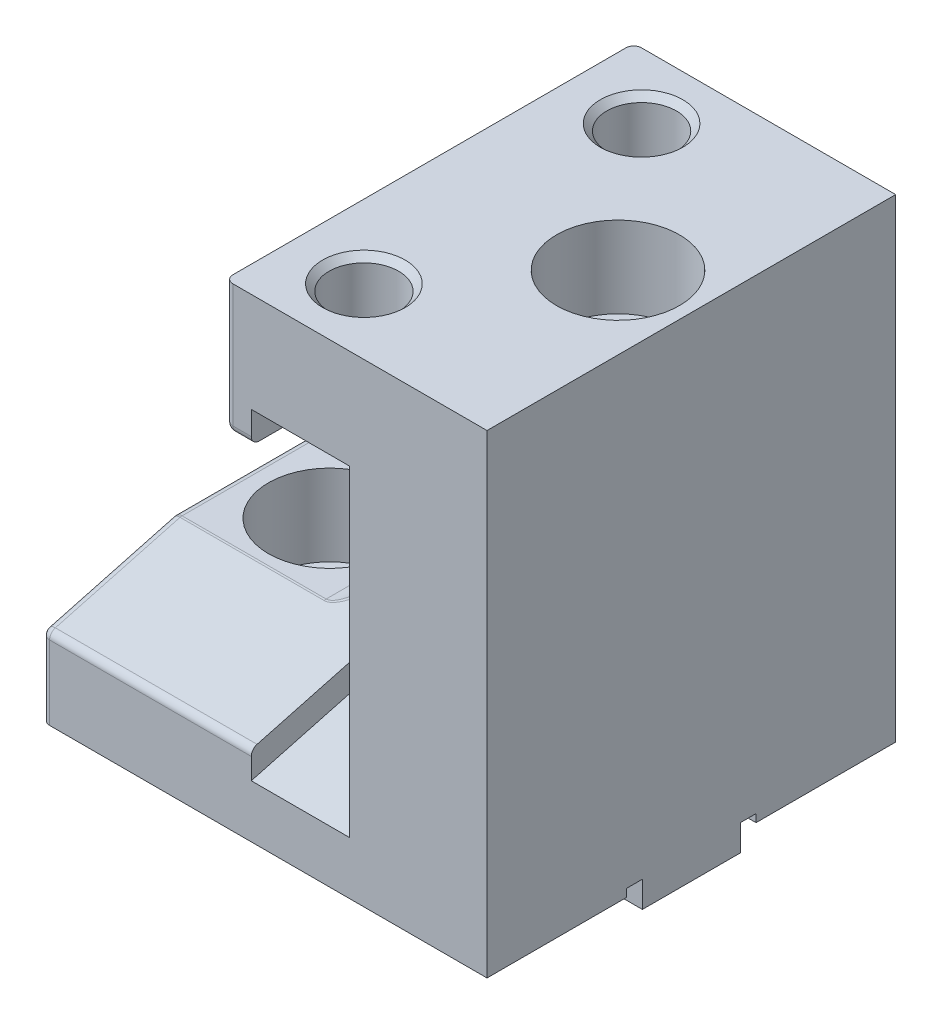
ISO-10303-21;
HEADER;
FILE_DESCRIPTION(('STEP AP214'),'2;1');
FILE_NAME('part.step','',(''),(''),'','','');
FILE_SCHEMA(('AUTOMOTIVE_DESIGN { 1 0 10303 214 1 1 1 1 }'));
ENDSEC;
DATA;
#1=APPLICATION_CONTEXT('core data for automotive mechanical design processes');
#2=APPLICATION_PROTOCOL_DEFINITION('international standard','automotive_design',2000,#1);
#3=PRODUCT_CONTEXT('',#1,'mechanical');
#4=PRODUCT('Part','Part','',(#3));
#5=PRODUCT_RELATED_PRODUCT_CATEGORY('part','',(#4));
#6=PRODUCT_DEFINITION_FORMATION('','',#4);
#7=PRODUCT_DEFINITION_CONTEXT('part definition',#1,'design');
#8=PRODUCT_DEFINITION('design','',#6,#7);
#9=PRODUCT_DEFINITION_SHAPE('','',#8);
#10=(LENGTH_UNIT() NAMED_UNIT(*) SI_UNIT(.MILLI.,.METRE.));
#11=(NAMED_UNIT(*) PLANE_ANGLE_UNIT() SI_UNIT($,.RADIAN.));
#12=(NAMED_UNIT(*) SI_UNIT($,.STERADIAN.) SOLID_ANGLE_UNIT());
#13=UNCERTAINTY_MEASURE_WITH_UNIT(LENGTH_MEASURE(1.E-05),#10,'distance_accuracy_value','');
#14=(GEOMETRIC_REPRESENTATION_CONTEXT(3) GLOBAL_UNCERTAINTY_ASSIGNED_CONTEXT((#13)) GLOBAL_UNIT_ASSIGNED_CONTEXT((#10,
#11,#12)) REPRESENTATION_CONTEXT('',''));
#15=CARTESIAN_POINT('',(0.,0.,0.));
#16=DIRECTION('',(0.,0.,1.));
#17=DIRECTION('',(1.,0.,0.));
#18=AXIS2_PLACEMENT_3D('',#15,#16,#17);
#19=CARTESIAN_POINT('',(-26.67,0.,79.248));
#20=DIRECTION('',(0.,1.,0.));
#21=DIRECTION('',(0.,0.,1.));
#22=AXIS2_PLACEMENT_3D('',#19,#20,#21);
#23=PLANE('',#22);
#24=DIRECTION('',(1.,0.,0.));
#25=VECTOR('',#24,1.);
#26=CARTESIAN_POINT('',(-26.67,0.,79.248));
#27=LINE('',#26,#25);
#28=CARTESIAN_POINT('',(-84.836,0.,79.248));
#29=VERTEX_POINT('',#28);
#30=CARTESIAN_POINT('',(0.,0.,79.248));
#31=VERTEX_POINT('',#30);
#32=EDGE_CURVE('E573',#29,#31,#27,.T.);
#33=ORIENTED_EDGE('',*,*,#32,.F.);
#34=CARTESIAN_POINT('',(-84.836,0.,77.724));
#35=DIRECTION('',(0.,1.,0.));
#36=DIRECTION('',(0.,0.,1.));
#37=AXIS2_PLACEMENT_3D('',#34,#35,#36);
#38=CIRCLE('',#37,1.524);
#39=CARTESIAN_POINT('',(-86.36,0.,77.724));
#40=VERTEX_POINT('',#39);
#41=EDGE_CURVE('E376',#29,#40,#38,.F.);
#42=ORIENTED_EDGE('',*,*,#41,.T.);
#43=DIRECTION('',(0.,0.,1.));
#44=VECTOR('',#43,1.);
#45=CARTESIAN_POINT('',(-86.36,0.,79.248));
#46=LINE('',#45,#44);
#47=CARTESIAN_POINT('',(-86.36,0.,52.16525));
#48=VERTEX_POINT('',#47);
#49=EDGE_CURVE('E332',#48,#40,#46,.T.);
#50=ORIENTED_EDGE('',*,*,#49,.F.);
#51=DIRECTION('',(-1.,0.,0.));
#52=VECTOR('',#51,1.);
#53=CARTESIAN_POINT('',(5.00000000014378E-05,0.,52.16525));
#54=LINE('',#53,#52);
#55=CARTESIAN_POINT('',(0.,0.,52.16525));
#56=VERTEX_POINT('',#55);
#57=EDGE_CURVE('E311',#56,#48,#54,.T.);
#58=ORIENTED_EDGE('',*,*,#57,.F.);
#59=DIRECTION('',(0.,0.,-1.));
#60=VECTOR('',#59,1.);
#61=CARTESIAN_POINT('',(0.,0.,79.248));
#62=LINE('',#61,#60);
#63=EDGE_CURVE('E580',#31,#56,#62,.T.);
#64=ORIENTED_EDGE('',*,*,#63,.F.);
#65=EDGE_LOOP('',(#33,#42,#50,#58,#64));
#66=FACE_BOUND('',#65,.T.);
#67=ADVANCED_FACE('F35',(#66),#23,.F.);
#68=CARTESIAN_POINT('',(-50.8,91.948,79.248));
#69=DIRECTION('',(1.,0.,0.));
#70=DIRECTION('',(0.,1.,0.));
#71=AXIS2_PLACEMENT_3D('',#68,#69,#70);
#72=PLANE('',#71);
#73=DIRECTION('',(0.,-0.258819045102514,0.96592582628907));
#74=VECTOR('',#73,1.);
#75=CARTESIAN_POINT('',(-50.8,19.1683483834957,59.7467511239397));
#76=LINE('',#75,#74);
#77=CARTESIAN_POINT('',(-50.8,28.448,25.1146198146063));
#78=VERTEX_POINT('',#77);
#79=CARTESIAN_POINT('',(-50.8,34.7690875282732,1.524));
#80=VERTEX_POINT('',#79);
#81=EDGE_CURVE('E521',#78,#80,#76,.F.);
#82=ORIENTED_EDGE('',*,*,#81,.T.);
#83=DIRECTION('',(0.,1.,0.));
#84=VECTOR('',#83,1.);
#85=CARTESIAN_POINT('',(-50.8,91.948,1.524));
#86=LINE('',#85,#84);
#87=CARTESIAN_POINT('',(-50.8,28.448,1.524));
#88=VERTEX_POINT('',#87);
#89=EDGE_CURVE('E523',#80,#88,#86,.F.);
#90=ORIENTED_EDGE('',*,*,#89,.T.);
#91=DIRECTION('',(0.,0.,-1.));
#92=VECTOR('',#91,1.);
#93=CARTESIAN_POINT('',(-50.8,28.448,53.7534853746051));
#94=LINE('',#93,#92);
#95=EDGE_CURVE('E509',#88,#78,#94,.F.);
#96=ORIENTED_EDGE('',*,*,#95,.T.);
#97=EDGE_LOOP('',(#82,#90,#96));
#98=FACE_BOUND('',#97,.T.);
#99=ADVANCED_FACE('F470',(#98),#72,.F.);
#100=CARTESIAN_POINT('',(-26.67,72.644,79.248));
#101=DIRECTION('',(1.,0.,0.));
#102=DIRECTION('',(0.,1.,0.));
#103=AXIS2_PLACEMENT_3D('',#100,#101,#102);
#104=PLANE('',#103);
#105=DIRECTION('',(0.,0.258819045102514,-0.96592582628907));
#106=VECTOR('',#105,1.);
#107=CARTESIAN_POINT('',(-26.67,31.496,0.));
#108=LINE('',#107,#106);
#109=CARTESIAN_POINT('',(-26.67,10.261562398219,79.248));
#110=VERTEX_POINT('',#109);
#111=CARTESIAN_POINT('',(-26.67,31.496,0.));
#112=VERTEX_POINT('',#111);
#113=EDGE_CURVE('E718',#110,#112,#108,.T.);
#114=ORIENTED_EDGE('',*,*,#113,.F.);
#115=DIRECTION('',(0.,-1.,0.));
#116=VECTOR('',#115,1.);
#117=CARTESIAN_POINT('',(-26.67,72.644,79.248));
#118=LINE('',#117,#116);
#119=CARTESIAN_POINT('',(-26.67,72.644,79.248));
#120=VERTEX_POINT('',#119);
#121=EDGE_CURVE('E626',#120,#110,#118,.T.);
#122=ORIENTED_EDGE('',*,*,#121,.F.);
#123=DIRECTION('',(0.,0.,-1.));
#124=VECTOR('',#123,1.);
#125=CARTESIAN_POINT('',(-26.67,72.644,79.248));
#126=LINE('',#125,#124);
#127=CARTESIAN_POINT('',(-26.67,72.644,0.));
#128=VERTEX_POINT('',#127);
#129=EDGE_CURVE('E637',#120,#128,#126,.T.);
#130=ORIENTED_EDGE('',*,*,#129,.T.);
#131=DIRECTION('',(0.,-1.,0.));
#132=VECTOR('',#131,1.);
#133=CARTESIAN_POINT('',(-26.67,72.644,0.));
#134=LINE('',#133,#132);
#135=EDGE_CURVE('E635',#128,#112,#134,.T.);
#136=ORIENTED_EDGE('',*,*,#135,.T.);
#137=EDGE_LOOP('',(#114,#122,#130,#136));
#138=FACE_BOUND('',#137,.T.);
#139=ADVANCED_FACE('F475',(#138),#104,.F.);
#140=CARTESIAN_POINT('',(-86.36,0.,1.524));
#141=VERTEX_POINT('',#140);
#142=CARTESIAN_POINT('',(-86.36,0.,27.08275));
#143=VERTEX_POINT('',#142);
#144=EDGE_CURVE('E343',#141,#143,#46,.T.);
#145=ORIENTED_EDGE('',*,*,#144,.F.);
#146=CARTESIAN_POINT('',(-84.836,0.,1.524));
#147=DIRECTION('',(0.,1.,0.));
#148=DIRECTION('',(0.,0.,1.));
#149=AXIS2_PLACEMENT_3D('',#146,#147,#148);
#150=CIRCLE('',#149,1.524);
#151=CARTESIAN_POINT('',(-84.836,0.,0.));
#152=VERTEX_POINT('',#151);
#153=EDGE_CURVE('E356',#141,#152,#150,.F.);
#154=ORIENTED_EDGE('',*,*,#153,.T.);
#155=DIRECTION('',(1.,0.,0.));
#156=VECTOR('',#155,1.);
#157=CARTESIAN_POINT('',(-26.67,0.,0.));
#158=LINE('',#157,#156);
#159=CARTESIAN_POINT('',(0.,0.,0.));
#160=VERTEX_POINT('',#159);
#161=EDGE_CURVE('E616',#152,#160,#158,.T.);
#162=ORIENTED_EDGE('',*,*,#161,.T.);
#163=CARTESIAN_POINT('',(0.,0.,27.08275));
#164=VERTEX_POINT('',#163);
#165=EDGE_CURVE('E585',#164,#160,#62,.T.);
#166=ORIENTED_EDGE('',*,*,#165,.F.);
#167=DIRECTION('',(-1.,0.,0.));
#168=VECTOR('',#167,1.);
#169=CARTESIAN_POINT('',(5.00000000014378E-05,0.,27.08275));
#170=LINE('',#169,#168);
#171=EDGE_CURVE('E297',#164,#143,#170,.T.);
#172=ORIENTED_EDGE('',*,*,#171,.T.);
#173=EDGE_LOOP('',(#145,#154,#162,#166,#172));
#174=FACE_BOUND('',#173,.T.);
#175=ADVANCED_FACE('F444',(#174),#23,.F.);
#176=CARTESIAN_POINT('',(0.,0.,79.248));
#177=DIRECTION('',(-1.,0.,0.));
#178=DIRECTION('',(0.,0.,1.));
#179=AXIS2_PLACEMENT_3D('',#176,#177,#178);
#180=PLANE('',#179);
#181=DIRECTION('',(0.,-1.,0.));
#182=VECTOR('',#181,1.);
#183=CARTESIAN_POINT('',(0.,-3.556,30.13075));
#184=LINE('',#183,#182);
#185=CARTESIAN_POINT('',(0.,1.524,30.13075));
#186=VERTEX_POINT('',#185);
#187=CARTESIAN_POINT('',(0.,-3.556,30.13075));
#188=VERTEX_POINT('',#187);
#189=EDGE_CURVE('E327',#186,#188,#184,.T.);
#190=ORIENTED_EDGE('',*,*,#189,.F.);
#191=DIRECTION('',(0.,0.,-1.));
#192=VECTOR('',#191,1.);
#193=CARTESIAN_POINT('',(0.,1.52400000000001,79.248));
#194=LINE('',#193,#192);
#195=CARTESIAN_POINT('',(0.,1.524,27.08275));
#196=VERTEX_POINT('',#195);
#197=EDGE_CURVE('E283',#186,#196,#194,.T.);
#198=ORIENTED_EDGE('',*,*,#197,.T.);
#199=DIRECTION('',(0.,-1.,0.));
#200=VECTOR('',#199,1.);
#201=CARTESIAN_POINT('',(0.,0.,27.08275));
#202=LINE('',#201,#200);
#203=EDGE_CURVE('E302',#196,#164,#202,.T.);
#204=ORIENTED_EDGE('',*,*,#203,.T.);
#205=ORIENTED_EDGE('',*,*,#165,.T.);
#206=DIRECTION('',(0.,1.,0.));
#207=VECTOR('',#206,1.);
#208=CARTESIAN_POINT('',(0.,0.,0.));
#209=LINE('',#208,#207);
#210=CARTESIAN_POINT('',(0.,91.948,0.));
#211=VERTEX_POINT('',#210);
#212=EDGE_CURVE('E617',#160,#211,#209,.T.);
#213=ORIENTED_EDGE('',*,*,#212,.T.);
#214=DIRECTION('',(0.,0.,-1.));
#215=VECTOR('',#214,1.);
#216=CARTESIAN_POINT('',(0.,91.948,79.248));
#217=LINE('',#216,#215);
#218=CARTESIAN_POINT('',(0.,91.948,79.248));
#219=VERTEX_POINT('',#218);
#220=EDGE_CURVE('E590',#219,#211,#217,.T.);
#221=ORIENTED_EDGE('',*,*,#220,.F.);
#222=DIRECTION('',(0.,1.,0.));
#223=VECTOR('',#222,1.);
#224=CARTESIAN_POINT('',(0.,0.,79.248));
#225=LINE('',#224,#223);
#226=EDGE_CURVE('E583',#31,#219,#225,.T.);
#227=ORIENTED_EDGE('',*,*,#226,.F.);
#228=ORIENTED_EDGE('',*,*,#63,.T.);
#229=DIRECTION('',(0.,1.,0.));
#230=VECTOR('',#229,1.);
#231=CARTESIAN_POINT('',(0.,0.,52.16525));
#232=LINE('',#231,#230);
#233=CARTESIAN_POINT('',(0.,1.524,52.16525));
#234=VERTEX_POINT('',#233);
#235=EDGE_CURVE('E315',#56,#234,#232,.T.);
#236=ORIENTED_EDGE('',*,*,#235,.T.);
#237=DIRECTION('',(0.,0.,-1.));
#238=VECTOR('',#237,1.);
#239=CARTESIAN_POINT('',(0.,1.524,79.248));
#240=LINE('',#239,#238);
#241=CARTESIAN_POINT('',(0.,1.524,49.11725));
#242=VERTEX_POINT('',#241);
#243=EDGE_CURVE('E321',#234,#242,#240,.T.);
#244=ORIENTED_EDGE('',*,*,#243,.T.);
#245=DIRECTION('',(0.,1.,0.));
#246=VECTOR('',#245,1.);
#247=CARTESIAN_POINT('',(0.,-3.556,49.11725));
#248=LINE('',#247,#246);
#249=CARTESIAN_POINT('',(0.,-3.556,49.11725));
#250=VERTEX_POINT('',#249);
#251=EDGE_CURVE('E329',#250,#242,#248,.T.);
#252=ORIENTED_EDGE('',*,*,#251,.F.);
#253=DIRECTION('',(0.,0.,1.));
#254=VECTOR('',#253,1.);
#255=CARTESIAN_POINT('',(0.,-3.556,30.13075));
#256=LINE('',#255,#254);
#257=EDGE_CURVE('E324',#188,#250,#256,.T.);
#258=ORIENTED_EDGE('',*,*,#257,.F.);
#259=EDGE_LOOP('',(#190,#198,#204,#205,#213,#221,#227,#228,#236,#244,#252,#258));
#260=FACE_BOUND('',#259,.T.);
#261=ADVANCED_FACE('F480',(#260),#180,.F.);
#262=CARTESIAN_POINT('',(0.,91.948,79.248));
#263=DIRECTION('',(0.,-1.,0.));
#264=DIRECTION('',(1.,0.,0.));
#265=AXIS2_PLACEMENT_3D('',#262,#263,#264);
#266=PLANE('',#265);
#267=CARTESIAN_POINT('',(-36.576,91.948,12.7));
#268=DIRECTION('',(0.,1.,0.));
#269=DIRECTION('',(0.,0.,1.));
#270=AXIS2_PLACEMENT_3D('',#267,#268,#269);
#271=CIRCLE('',#270,8.001);
#272=CARTESIAN_POINT('',(-36.576,91.948,20.701));
#273=VERTEX_POINT('',#272);
#274=EDGE_CURVE('E760',#273,#273,#271,.T.);
#275=ORIENTED_EDGE('',*,*,#274,.F.);
#276=EDGE_LOOP('',(#275));
#277=FACE_BOUND('',#276,.T.);
#278=CARTESIAN_POINT('',(-36.576,91.948,66.548));
#279=DIRECTION('',(0.,1.,0.));
#280=DIRECTION('',(0.,0.,1.));
#281=AXIS2_PLACEMENT_3D('',#278,#279,#280);
#282=CIRCLE('',#281,8.001);
#283=CARTESIAN_POINT('',(-36.576,91.948,74.549));
#284=VERTEX_POINT('',#283);
#285=EDGE_CURVE('E764',#284,#284,#282,.T.);
#286=ORIENTED_EDGE('',*,*,#285,.F.);
#287=EDGE_LOOP('',(#286));
#288=FACE_BOUND('',#287,.T.);
#289=CARTESIAN_POINT('',(-14.224,91.948,39.624));
#290=DIRECTION('',(0.,1.,0.));
#291=DIRECTION('',(0.,0.,1.));
#292=AXIS2_PLACEMENT_3D('',#289,#290,#291);
#293=CIRCLE('',#292,11.9126);
#294=CARTESIAN_POINT('',(-14.224,91.948,51.5366));
#295=VERTEX_POINT('',#294);
#296=EDGE_CURVE('E767',#295,#295,#293,.T.);
#297=ORIENTED_EDGE('',*,*,#296,.F.);
#298=EDGE_LOOP('',(#297));
#299=FACE_BOUND('',#298,.T.);
#300=DIRECTION('',(0.,0.,-1.));
#301=VECTOR('',#300,1.);
#302=CARTESIAN_POINT('',(-50.8,91.948,79.248));
#303=LINE('',#302,#301);
#304=CARTESIAN_POINT('',(-50.8,91.948,77.724));
#305=VERTEX_POINT('',#304);
#306=CARTESIAN_POINT('',(-50.8,91.948,1.524));
#307=VERTEX_POINT('',#306);
#308=EDGE_CURVE('E646',#305,#307,#303,.T.);
#309=ORIENTED_EDGE('',*,*,#308,.F.);
#310=CARTESIAN_POINT('',(-49.276,91.948,77.724));
#311=DIRECTION('',(0.,-1.,0.));
#312=DIRECTION('',(1.,0.,0.));
#313=AXIS2_PLACEMENT_3D('',#310,#311,#312);
#314=CIRCLE('',#313,1.524);
#315=CARTESIAN_POINT('',(-49.276,91.948,79.248));
#316=VERTEX_POINT('',#315);
#317=EDGE_CURVE('E12',#305,#316,#314,.F.);
#318=ORIENTED_EDGE('',*,*,#317,.T.);
#319=DIRECTION('',(-1.,0.,0.));
#320=VECTOR('',#319,1.);
#321=CARTESIAN_POINT('',(0.,91.948,79.248));
#322=LINE('',#321,#320);
#323=EDGE_CURVE('E654',#219,#316,#322,.T.);
#324=ORIENTED_EDGE('',*,*,#323,.F.);
#325=ORIENTED_EDGE('',*,*,#220,.T.);
#326=DIRECTION('',(-1.,0.,0.));
#327=VECTOR('',#326,1.);
#328=CARTESIAN_POINT('',(0.,91.948,0.));
#329=LINE('',#328,#327);
#330=CARTESIAN_POINT('',(-49.276,91.948,0.));
#331=VERTEX_POINT('',#330);
#332=EDGE_CURVE('E620',#211,#331,#329,.T.);
#333=ORIENTED_EDGE('',*,*,#332,.T.);
#334=CARTESIAN_POINT('',(-49.276,91.948,1.524));
#335=DIRECTION('',(0.,-1.,0.));
#336=DIRECTION('',(1.,0.,0.));
#337=AXIS2_PLACEMENT_3D('',#334,#335,#336);
#338=CIRCLE('',#337,1.524);
#339=EDGE_CURVE('E44',#331,#307,#338,.F.);
#340=ORIENTED_EDGE('',*,*,#339,.T.);
#341=EDGE_LOOP('',(#309,#318,#324,#325,#333,#340));
#342=FACE_BOUND('',#341,.T.);
#343=ADVANCED_FACE('F486',(#277,#288,#299,#342),#266,.F.);
#344=CARTESIAN_POINT('',(-50.8,91.948,79.248));
#345=DIRECTION('',(1.,0.,0.));
#346=DIRECTION('',(0.,1.,0.));
#347=AXIS2_PLACEMENT_3D('',#344,#345,#346);
#348=PLANE('',#347);
#349=DIRECTION('',(0.,0.,-1.));
#350=VECTOR('',#349,1.);
#351=CARTESIAN_POINT('',(-50.8,68.072,79.248));
#352=LINE('',#351,#350);
#353=CARTESIAN_POINT('',(-50.8,68.072,1.524));
#354=VERTEX_POINT('',#353);
#355=CARTESIAN_POINT('',(-50.8,68.072,77.724));
#356=VERTEX_POINT('',#355);
#357=EDGE_CURVE('E52',#354,#356,#352,.F.);
#358=ORIENTED_EDGE('',*,*,#357,.T.);
#359=DIRECTION('',(0.,-1.,0.));
#360=VECTOR('',#359,1.);
#361=CARTESIAN_POINT('',(-50.8,91.948,77.724));
#362=LINE('',#361,#360);
#363=EDGE_CURVE('E391',#356,#305,#362,.F.);
#364=ORIENTED_EDGE('',*,*,#363,.T.);
#365=ORIENTED_EDGE('',*,*,#308,.T.);
#366=DIRECTION('',(0.,-1.,0.));
#367=VECTOR('',#366,1.);
#368=CARTESIAN_POINT('',(-50.8,91.948,1.524));
#369=LINE('',#368,#367);
#370=EDGE_CURVE('E57',#307,#354,#369,.T.);
#371=ORIENTED_EDGE('',*,*,#370,.T.);
#372=EDGE_LOOP('',(#358,#364,#365,#371));
#373=FACE_BOUND('',#372,.T.);
#374=ADVANCED_FACE('F750',(#373),#348,.F.);
#375=CARTESIAN_POINT('',(-50.8,66.548,79.248));
#376=DIRECTION('',(0.,1.,0.));
#377=DIRECTION('',(0.,0.,1.));
#378=AXIS2_PLACEMENT_3D('',#375,#376,#377);
#379=PLANE('',#378);
#380=DIRECTION('',(0.,0.,-1.));
#381=VECTOR('',#380,1.);
#382=CARTESIAN_POINT('',(-49.276,66.548,79.248));
#383=LINE('',#382,#381);
#384=CARTESIAN_POINT('',(-49.276,66.548,77.724));
#385=VERTEX_POINT('',#384);
#386=CARTESIAN_POINT('',(-49.276,66.548,1.524));
#387=VERTEX_POINT('',#386);
#388=EDGE_CURVE('E378',#385,#387,#383,.T.);
#389=ORIENTED_EDGE('',*,*,#388,.T.);
#390=DIRECTION('',(1.,0.,0.));
#391=VECTOR('',#390,1.);
#392=CARTESIAN_POINT('',(-50.8,66.548,1.524));
#393=LINE('',#392,#391);
#394=CARTESIAN_POINT('',(-45.72,66.548,1.524));
#395=VERTEX_POINT('',#394);
#396=EDGE_CURVE('E382',#387,#395,#393,.T.);
#397=ORIENTED_EDGE('',*,*,#396,.T.);
#398=DIRECTION('',(0.,0.,-1.));
#399=VECTOR('',#398,1.);
#400=CARTESIAN_POINT('',(-45.72,66.548,79.248));
#401=LINE('',#400,#399);
#402=CARTESIAN_POINT('',(-45.72,66.548,77.724));
#403=VERTEX_POINT('',#402);
#404=EDGE_CURVE('E643',#403,#395,#401,.T.);
#405=ORIENTED_EDGE('',*,*,#404,.F.);
#406=DIRECTION('',(1.,0.,0.));
#407=VECTOR('',#406,1.);
#408=CARTESIAN_POINT('',(-50.8,66.548,77.724));
#409=LINE('',#408,#407);
#410=EDGE_CURVE('E380',#403,#385,#409,.F.);
#411=ORIENTED_EDGE('',*,*,#410,.T.);
#412=EDGE_LOOP('',(#389,#397,#405,#411));
#413=FACE_BOUND('',#412,.T.);
#414=ADVANCED_FACE('F697',(#413),#379,.F.);
#415=CARTESIAN_POINT('',(-45.72,66.548,79.248));
#416=DIRECTION('',(-1.,0.,0.));
#417=DIRECTION('',(0.,-1.,0.));
#418=AXIS2_PLACEMENT_3D('',#415,#416,#417);
#419=PLANE('',#418);
#420=ORIENTED_EDGE('',*,*,#404,.T.);
#421=CARTESIAN_POINT('',(-45.72,68.072,1.524));
#422=DIRECTION('',(-1.,0.,0.));
#423=DIRECTION('',(0.,-1.,0.));
#424=AXIS2_PLACEMENT_3D('',#421,#422,#423);
#425=CIRCLE('',#424,1.524);
#426=CARTESIAN_POINT('',(-45.72,68.072,0.));
#427=VERTEX_POINT('',#426);
#428=EDGE_CURVE('E387',#395,#427,#425,.F.);
#429=ORIENTED_EDGE('',*,*,#428,.T.);
#430=DIRECTION('',(0.,1.,0.));
#431=VECTOR('',#430,1.);
#432=CARTESIAN_POINT('',(-45.72,66.548,0.));
#433=LINE('',#432,#431);
#434=CARTESIAN_POINT('',(-45.72,72.644,0.));
#435=VERTEX_POINT('',#434);
#436=EDGE_CURVE('E631',#427,#435,#433,.T.);
#437=ORIENTED_EDGE('',*,*,#436,.T.);
#438=DIRECTION('',(0.,0.,-1.));
#439=VECTOR('',#438,1.);
#440=CARTESIAN_POINT('',(-45.72,72.644,79.248));
#441=LINE('',#440,#439);
#442=CARTESIAN_POINT('',(-45.72,72.644,79.248));
#443=VERTEX_POINT('',#442);
#444=EDGE_CURVE('E640',#443,#435,#441,.T.);
#445=ORIENTED_EDGE('',*,*,#444,.F.);
#446=DIRECTION('',(0.,1.,0.));
#447=VECTOR('',#446,1.);
#448=CARTESIAN_POINT('',(-45.72,66.548,79.248));
#449=LINE('',#448,#447);
#450=CARTESIAN_POINT('',(-45.72,68.072,79.248));
#451=VERTEX_POINT('',#450);
#452=EDGE_CURVE('E705',#451,#443,#449,.T.);
#453=ORIENTED_EDGE('',*,*,#452,.F.);
#454=CARTESIAN_POINT('',(-45.72,68.072,77.724));
#455=DIRECTION('',(-1.,0.,0.));
#456=DIRECTION('',(0.,-1.,0.));
#457=AXIS2_PLACEMENT_3D('',#454,#455,#456);
#458=CIRCLE('',#457,1.524);
#459=EDGE_CURVE('E385',#451,#403,#458,.F.);
#460=ORIENTED_EDGE('',*,*,#459,.T.);
#461=EDGE_LOOP('',(#420,#429,#437,#445,#453,#460));
#462=FACE_BOUND('',#461,.T.);
#463=ADVANCED_FACE('F708',(#462),#419,.F.);
#464=CARTESIAN_POINT('',(-45.72,72.644,79.248));
#465=DIRECTION('',(0.,1.,0.));
#466=DIRECTION('',(0.,0.,1.));
#467=AXIS2_PLACEMENT_3D('',#464,#465,#466);
#468=PLANE('',#467);
#469=CARTESIAN_POINT('',(-36.576,72.644,12.7));
#470=DIRECTION('',(0.,1.,0.));
#471=DIRECTION('',(0.,0.,1.));
#472=AXIS2_PLACEMENT_3D('',#469,#470,#471);
#473=CIRCLE('',#472,6.74624);
#474=CARTESIAN_POINT('',(-36.576,72.644,19.44624));
#475=VERTEX_POINT('',#474);
#476=EDGE_CURVE('E864',#475,#475,#473,.T.);
#477=ORIENTED_EDGE('',*,*,#476,.T.);
#478=EDGE_LOOP('',(#477));
#479=FACE_BOUND('',#478,.T.);
#480=CARTESIAN_POINT('',(-36.576,72.644,66.548));
#481=DIRECTION('',(0.,1.,0.));
#482=DIRECTION('',(0.,0.,1.));
#483=AXIS2_PLACEMENT_3D('',#480,#481,#482);
#484=CIRCLE('',#483,6.74624);
#485=CARTESIAN_POINT('',(-36.576,72.644,73.29424));
#486=VERTEX_POINT('',#485);
#487=EDGE_CURVE('E770',#486,#486,#484,.T.);
#488=ORIENTED_EDGE('',*,*,#487,.T.);
#489=EDGE_LOOP('',(#488));
#490=FACE_BOUND('',#489,.T.);
#491=DIRECTION('',(1.,0.,0.));
#492=VECTOR('',#491,1.);
#493=CARTESIAN_POINT('',(-45.72,72.644,0.));
#494=LINE('',#493,#492);
#495=EDGE_CURVE('E633',#435,#128,#494,.T.);
#496=ORIENTED_EDGE('',*,*,#495,.T.);
#497=ORIENTED_EDGE('',*,*,#129,.F.);
#498=DIRECTION('',(1.,0.,0.));
#499=VECTOR('',#498,1.);
#500=CARTESIAN_POINT('',(-45.72,72.644,79.248));
#501=LINE('',#500,#499);
#502=EDGE_CURVE('E710',#443,#120,#501,.T.);
#503=ORIENTED_EDGE('',*,*,#502,.F.);
#504=ORIENTED_EDGE('',*,*,#444,.T.);
#505=EDGE_LOOP('',(#496,#497,#503,#504));
#506=FACE_BOUND('',#505,.T.);
#507=ADVANCED_FACE('F733',(#479,#490,#506),#468,.F.);
#508=CARTESIAN_POINT('',(0.,0.,79.248));
#509=DIRECTION('',(0.,0.,1.));
#510=DIRECTION('',(1.,0.,0.));
#511=AXIS2_PLACEMENT_3D('',#508,#509,#510);
#512=PLANE('',#511);
#513=DIRECTION('',(0.,1.,0.));
#514=VECTOR('',#513,1.);
#515=CARTESIAN_POINT('',(-45.7199999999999,0.,79.248));
#516=LINE('',#515,#514);
#517=CARTESIAN_POINT('',(-45.7199999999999,10.2615623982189,79.248));
#518=VERTEX_POINT('',#517);
#519=CARTESIAN_POINT('',(-45.7199999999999,14.3513590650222,79.248));
#520=VERTEX_POINT('',#519);
#521=EDGE_CURVE('E561',#518,#520,#516,.T.);
#522=ORIENTED_EDGE('',*,*,#521,.T.);
#523=DIRECTION('',(1.,0.,0.));
#524=VECTOR('',#523,1.);
#525=CARTESIAN_POINT('',(-86.36,14.3513590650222,79.248));
#526=LINE('',#525,#524);
#527=CARTESIAN_POINT('',(-84.836,14.3513590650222,79.248));
#528=VERTEX_POINT('',#527);
#529=EDGE_CURVE('E374',#520,#528,#526,.F.);
#530=ORIENTED_EDGE('',*,*,#529,.T.);
#531=DIRECTION('',(0.,1.,0.));
#532=VECTOR('',#531,1.);
#533=CARTESIAN_POINT('',(-84.836,0.,79.248));
#534=LINE('',#533,#532);
#535=EDGE_CURVE('E372',#528,#29,#534,.F.);
#536=ORIENTED_EDGE('',*,*,#535,.T.);
#537=ORIENTED_EDGE('',*,*,#32,.T.);
#538=ORIENTED_EDGE('',*,*,#226,.T.);
#539=ORIENTED_EDGE('',*,*,#323,.T.);
#540=DIRECTION('',(0.,-1.,0.));
#541=VECTOR('',#540,1.);
#542=CARTESIAN_POINT('',(-49.276,66.548,79.248));
#543=LINE('',#542,#541);
#544=CARTESIAN_POINT('',(-49.276,68.072,79.248));
#545=VERTEX_POINT('',#544);
#546=EDGE_CURVE('E368',#316,#545,#543,.T.);
#547=ORIENTED_EDGE('',*,*,#546,.T.);
#548=DIRECTION('',(1.,0.,0.));
#549=VECTOR('',#548,1.);
#550=CARTESIAN_POINT('',(-45.72,68.072,79.248));
#551=LINE('',#550,#549);
#552=EDGE_CURVE('E370',#545,#451,#551,.T.);
#553=ORIENTED_EDGE('',*,*,#552,.T.);
#554=ORIENTED_EDGE('',*,*,#452,.T.);
#555=ORIENTED_EDGE('',*,*,#502,.T.);
#556=ORIENTED_EDGE('',*,*,#121,.T.);
#557=DIRECTION('',(1.,0.,0.));
#558=VECTOR('',#557,1.);
#559=CARTESIAN_POINT('',(-130.997450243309,10.2615623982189,79.248));
#560=LINE('',#559,#558);
#561=EDGE_CURVE('E719',#518,#110,#560,.T.);
#562=ORIENTED_EDGE('',*,*,#561,.F.);
#563=EDGE_LOOP('',(#522,#530,#536,#537,#538,#539,#547,#553,#554,#555,#556,#562));
#564=FACE_BOUND('',#563,.T.);
#565=ADVANCED_FACE('F559',(#564),#512,.T.);
#566=CARTESIAN_POINT('',(0.,0.,0.));
#567=DIRECTION('',(0.,0.,1.));
#568=DIRECTION('',(1.,0.,0.));
#569=AXIS2_PLACEMENT_3D('',#566,#567,#568);
#570=PLANE('',#569);
#571=ORIENTED_EDGE('',*,*,#436,.F.);
#572=DIRECTION('',(1.,0.,0.));
#573=VECTOR('',#572,1.);
#574=CARTESIAN_POINT('',(0.,68.072,0.));
#575=LINE('',#574,#573);
#576=CARTESIAN_POINT('',(-49.276,68.072,0.));
#577=VERTEX_POINT('',#576);
#578=EDGE_CURVE('E519',#427,#577,#575,.F.);
#579=ORIENTED_EDGE('',*,*,#578,.T.);
#580=DIRECTION('',(0.,-1.,0.));
#581=VECTOR('',#580,1.);
#582=CARTESIAN_POINT('',(-49.276,0.,0.));
#583=LINE('',#582,#581);
#584=EDGE_CURVE('E517',#577,#331,#583,.F.);
#585=ORIENTED_EDGE('',*,*,#584,.T.);
#586=ORIENTED_EDGE('',*,*,#332,.F.);
#587=ORIENTED_EDGE('',*,*,#212,.F.);
#588=ORIENTED_EDGE('',*,*,#161,.F.);
#589=DIRECTION('',(0.,-1.,0.));
#590=VECTOR('',#589,1.);
#591=CARTESIAN_POINT('',(-84.836,22.352,0.));
#592=LINE('',#591,#590);
#593=CARTESIAN_POINT('',(-84.836,20.828,0.));
#594=VERTEX_POINT('',#593);
#595=EDGE_CURVE('E500',#152,#594,#592,.F.);
#596=ORIENTED_EDGE('',*,*,#595,.T.);
#597=DIRECTION('',(1.,0.,0.));
#598=VECTOR('',#597,1.);
#599=CARTESIAN_POINT('',(0.,20.828,0.));
#600=LINE('',#599,#598);
#601=CARTESIAN_POINT('',(-56.896,20.828,0.));
#602=VERTEX_POINT('',#601);
#603=EDGE_CURVE('E505',#594,#602,#600,.T.);
#604=ORIENTED_EDGE('',*,*,#603,.T.);
#605=CARTESIAN_POINT('',(-56.896,28.448,0.));
#606=DIRECTION('',(0.,0.,1.));
#607=DIRECTION('',(1.,0.,0.));
#608=AXIS2_PLACEMENT_3D('',#605,#606,#607);
#609=CIRCLE('',#608,7.62);
#610=CARTESIAN_POINT('',(-49.276,28.448,0.));
#611=VERTEX_POINT('',#610);
#612=EDGE_CURVE('E504',#602,#611,#609,.T.);
#613=ORIENTED_EDGE('',*,*,#612,.T.);
#614=DIRECTION('',(0.,1.,0.));
#615=VECTOR('',#614,1.);
#616=CARTESIAN_POINT('',(-49.276,0.,0.));
#617=LINE('',#616,#615);
#618=CARTESIAN_POINT('',(-49.276,34.7690875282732,0.));
#619=VERTEX_POINT('',#618);
#620=EDGE_CURVE('E507',#611,#619,#617,.T.);
#621=ORIENTED_EDGE('',*,*,#620,.T.);
#622=DIRECTION('',(1.,0.,0.));
#623=VECTOR('',#622,1.);
#624=CARTESIAN_POINT('',(0.,34.7690875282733,0.));
#625=LINE('',#624,#623);
#626=CARTESIAN_POINT('',(-45.72,34.7690875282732,0.));
#627=VERTEX_POINT('',#626);
#628=EDGE_CURVE('E515',#619,#627,#625,.T.);
#629=ORIENTED_EDGE('',*,*,#628,.T.);
#630=DIRECTION('',(0.,-1.,0.));
#631=VECTOR('',#630,1.);
#632=CARTESIAN_POINT('',(-45.72,36.7552029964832,0.));
#633=LINE('',#632,#631);
#634=CARTESIAN_POINT('',(-45.7199999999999,31.496,0.));
#635=VERTEX_POINT('',#634);
#636=EDGE_CURVE('E553',#627,#635,#633,.T.);
#637=ORIENTED_EDGE('',*,*,#636,.T.);
#638=DIRECTION('',(1.,0.,0.));
#639=VECTOR('',#638,1.);
#640=CARTESIAN_POINT('',(-130.997450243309,31.496,0.));
#641=LINE('',#640,#639);
#642=EDGE_CURVE('E623',#635,#112,#641,.T.);
#643=ORIENTED_EDGE('',*,*,#642,.T.);
#644=ORIENTED_EDGE('',*,*,#135,.F.);
#645=ORIENTED_EDGE('',*,*,#495,.F.);
#646=EDGE_LOOP('',(#571,#579,#585,#586,#587,#588,#596,#604,#613,#621,#629,#637,#643,#644,#645));
#647=FACE_BOUND('',#646,.T.);
#648=ADVANCED_FACE('F656',(#647),#570,.F.);
#649=CARTESIAN_POINT('',(-130.997450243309,31.496,0.));
#650=DIRECTION('',(0.,-0.96592582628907,-0.258819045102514));
#651=DIRECTION('',(0.,0.258819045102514,-0.96592582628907));
#652=AXIS2_PLACEMENT_3D('',#649,#650,#651);
#653=PLANE('',#652);
#654=DIRECTION('',(0.,0.258819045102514,-0.96592582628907));
#655=VECTOR('',#654,1.);
#656=CARTESIAN_POINT('',(-45.7199999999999,31.496,0.));
#657=LINE('',#656,#655);
#658=EDGE_CURVE('E618',#518,#635,#657,.T.);
#659=ORIENTED_EDGE('',*,*,#658,.F.);
#660=ORIENTED_EDGE('',*,*,#561,.T.);
#661=ORIENTED_EDGE('',*,*,#113,.T.);
#662=ORIENTED_EDGE('',*,*,#642,.F.);
#663=EDGE_LOOP('',(#659,#660,#661,#662));
#664=FACE_BOUND('',#663,.T.);
#665=ADVANCED_FACE('F728',(#664),#653,.F.);
#666=CARTESIAN_POINT('',(-45.72,36.7552029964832,0.));
#667=DIRECTION('',(-1.,0.,0.));
#668=DIRECTION('',(0.,-1.,0.));
#669=AXIS2_PLACEMENT_3D('',#666,#667,#668);
#670=PLANE('',#669);
#671=DIRECTION('',(0.,0.258819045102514,-0.96592582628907));
#672=VECTOR('',#671,1.);
#673=CARTESIAN_POINT('',(-45.7199999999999,15.5207653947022,79.248));
#674=LINE('',#673,#672);
#675=CARTESIAN_POINT('',(-45.7199999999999,15.8234300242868,78.1184402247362));
#676=VERTEX_POINT('',#675);
#677=CARTESIAN_POINT('',(-45.72,36.2411584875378,1.91844022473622));
#678=VERTEX_POINT('',#677);
#679=EDGE_CURVE('E336',#676,#678,#674,.T.);
#680=ORIENTED_EDGE('',*,*,#679,.F.);
#681=CARTESIAN_POINT('',(-45.7199999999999,14.3513590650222,77.724));
#682=DIRECTION('',(-1.,0.,0.));
#683=DIRECTION('',(0.,-1.,0.));
#684=AXIS2_PLACEMENT_3D('',#681,#682,#683);
#685=CIRCLE('',#684,1.524);
#686=EDGE_CURVE('E366',#676,#520,#685,.F.);
#687=ORIENTED_EDGE('',*,*,#686,.T.);
#688=ORIENTED_EDGE('',*,*,#521,.F.);
#689=ORIENTED_EDGE('',*,*,#658,.T.);
#690=ORIENTED_EDGE('',*,*,#636,.F.);
#691=CARTESIAN_POINT('',(-45.72,34.7690875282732,1.524));
#692=DIRECTION('',(-1.,0.,0.));
#693=DIRECTION('',(0.,-1.,0.));
#694=AXIS2_PLACEMENT_3D('',#691,#692,#693);
#695=CIRCLE('',#694,1.524);
#696=EDGE_CURVE('E364',#627,#678,#695,.F.);
#697=ORIENTED_EDGE('',*,*,#696,.T.);
#698=EDGE_LOOP('',(#680,#687,#688,#689,#690,#697));
#699=FACE_BOUND('',#698,.T.);
#700=ADVANCED_FACE('F549',(#699),#670,.F.);
#701=CARTESIAN_POINT('',(-138.156685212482,15.5207653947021,79.248));
#702=DIRECTION('',(0.,-0.96592582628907,-0.258819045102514));
#703=DIRECTION('',(0.,0.258819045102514,-0.96592582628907));
#704=AXIS2_PLACEMENT_3D('',#701,#702,#703);
#705=PLANE('',#704);
#706=DIRECTION('',(0.,0.258819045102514,-0.96592582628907));
#707=VECTOR('',#706,1.);
#708=CARTESIAN_POINT('',(-84.836,15.5207653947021,79.248));
#709=LINE('',#708,#707);
#710=CARTESIAN_POINT('',(-84.836,22.3000709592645,53.947287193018));
#711=VERTEX_POINT('',#710);
#712=CARTESIAN_POINT('',(-84.836,15.8234300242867,78.1184402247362));
#713=VERTEX_POINT('',#712);
#714=EDGE_CURVE('E537',#711,#713,#709,.F.);
#715=ORIENTED_EDGE('',*,*,#714,.T.);
#716=DIRECTION('',(1.,0.,0.));
#717=VECTOR('',#716,1.);
#718=CARTESIAN_POINT('',(-45.7199999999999,15.8234300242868,78.1184402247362));
#719=LINE('',#718,#717);
#720=EDGE_CURVE('E346',#713,#676,#719,.T.);
#721=ORIENTED_EDGE('',*,*,#720,.T.);
#722=ORIENTED_EDGE('',*,*,#679,.T.);
#723=DIRECTION('',(1.,0.,0.));
#724=VECTOR('',#723,1.);
#725=CARTESIAN_POINT('',(-138.156685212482,36.2411584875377,1.91844022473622));
#726=LINE('',#725,#724);
#727=CARTESIAN_POINT('',(-49.276,36.2411584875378,1.91844022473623));
#728=VERTEX_POINT('',#727);
#729=EDGE_CURVE('E532',#678,#728,#726,.F.);
#730=ORIENTED_EDGE('',*,*,#729,.T.);
#731=DIRECTION('',(0.,-0.258819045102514,0.96592582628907));
#732=VECTOR('',#731,1.);
#733=CARTESIAN_POINT('',(-49.276,15.5207653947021,79.248));
#734=LINE('',#733,#732);
#735=CARTESIAN_POINT('',(-49.276,29.9200709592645,25.5090600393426));
#736=VERTEX_POINT('',#735);
#737=EDGE_CURVE('E530',#728,#736,#734,.T.);
#738=ORIENTED_EDGE('',*,*,#737,.T.);
#739=CARTESIAN_POINT('',(-56.896,29.9200709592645,25.5090600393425));
#740=DIRECTION('',(0.,-0.96592582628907,-0.258819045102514));
#741=DIRECTION('',(0.,-0.258819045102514,0.96592582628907));
#742=AXIS2_PLACEMENT_3D('',#739,#740,#741);
#743=ELLIPSE('',#742,29.4414191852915,7.62);
#744=CARTESIAN_POINT('',(-56.896,22.3000709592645,53.9472871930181));
#745=VERTEX_POINT('',#744);
#746=EDGE_CURVE('E534',#736,#745,#743,.T.);
#747=ORIENTED_EDGE('',*,*,#746,.T.);
#748=DIRECTION('',(1.,0.,0.));
#749=VECTOR('',#748,1.);
#750=CARTESIAN_POINT('',(-138.156685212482,22.3000709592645,53.9472871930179));
#751=LINE('',#750,#749);
#752=EDGE_CURVE('E536',#745,#711,#751,.F.);
#753=ORIENTED_EDGE('',*,*,#752,.T.);
#754=EDGE_LOOP('',(#715,#721,#722,#730,#738,#747,#753));
#755=FACE_BOUND('',#754,.T.);
#756=ADVANCED_FACE('F432',(#755),#705,.F.);
#757=CARTESIAN_POINT('',(-255.059889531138,22.3519999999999,0.));
#758=DIRECTION('',(0.,-1.,0.));
#759=DIRECTION('',(1.,0.,0.));
#760=AXIS2_PLACEMENT_3D('',#757,#758,#759);
#761=PLANE('',#760);
#762=CARTESIAN_POINT('',(-70.104,22.352,39.624));
#763=DIRECTION('',(0.,1.,0.));
#764=DIRECTION('',(0.,0.,1.));
#765=AXIS2_PLACEMENT_3D('',#762,#763,#764);
#766=CIRCLE('',#765,11.9126);
#767=CARTESIAN_POINT('',(-70.104,22.352,51.5366));
#768=VERTEX_POINT('',#767);
#769=EDGE_CURVE('E785',#768,#768,#766,.T.);
#770=ORIENTED_EDGE('',*,*,#769,.F.);
#771=EDGE_LOOP('',(#770));
#772=FACE_BOUND('',#771,.T.);
#773=DIRECTION('',(0.,0.,-1.));
#774=VECTOR('',#773,1.);
#775=CARTESIAN_POINT('',(-84.836,22.352,53.7534853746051));
#776=LINE('',#775,#774);
#777=CARTESIAN_POINT('',(-84.836,22.352,1.524));
#778=VERTEX_POINT('',#777);
#779=CARTESIAN_POINT('',(-84.836,22.352,53.5528469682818));
#780=VERTEX_POINT('',#779);
#781=EDGE_CURVE('E360',#778,#780,#776,.F.);
#782=ORIENTED_EDGE('',*,*,#781,.T.);
#783=DIRECTION('',(1.,0.,0.));
#784=VECTOR('',#783,1.);
#785=CARTESIAN_POINT('',(-255.059889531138,22.3519999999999,53.5528469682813));
#786=LINE('',#785,#784);
#787=CARTESIAN_POINT('',(-56.896,22.352,53.5528469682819));
#788=VERTEX_POINT('',#787);
#789=EDGE_CURVE('E362',#780,#788,#786,.T.);
#790=ORIENTED_EDGE('',*,*,#789,.T.);
#791=DIRECTION('',(0.,0.,-1.));
#792=VECTOR('',#791,1.);
#793=CARTESIAN_POINT('',(-56.896,22.352,0.));
#794=LINE('',#793,#792);
#795=CARTESIAN_POINT('',(-56.896,22.352,1.524));
#796=VERTEX_POINT('',#795);
#797=EDGE_CURVE('E584',#788,#796,#794,.T.);
#798=ORIENTED_EDGE('',*,*,#797,.T.);
#799=DIRECTION('',(1.,0.,0.));
#800=VECTOR('',#799,1.);
#801=CARTESIAN_POINT('',(-255.059889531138,22.3519999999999,1.524));
#802=LINE('',#801,#800);
#803=EDGE_CURVE('E358',#796,#778,#802,.F.);
#804=ORIENTED_EDGE('',*,*,#803,.T.);
#805=EDGE_LOOP('',(#782,#790,#798,#804));
#806=FACE_BOUND('',#805,.T.);
#807=ADVANCED_FACE('F808',(#772,#806),#761,.F.);
#808=CARTESIAN_POINT('',(-86.36,0.,79.248));
#809=DIRECTION('',(-1.,0.,0.));
#810=DIRECTION('',(0.,0.,1.));
#811=AXIS2_PLACEMENT_3D('',#808,#809,#810);
#812=PLANE('',#811);
#813=DIRECTION('',(0.,0.,-1.));
#814=VECTOR('',#813,1.);
#815=CARTESIAN_POINT('',(-86.36,20.828,0.));
#816=LINE('',#815,#814);
#817=CARTESIAN_POINT('',(-86.36,20.828,53.5528469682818));
#818=VERTEX_POINT('',#817);
#819=CARTESIAN_POINT('',(-86.36,20.828,1.524));
#820=VERTEX_POINT('',#819);
#821=EDGE_CURVE('E352',#818,#820,#816,.T.);
#822=ORIENTED_EDGE('',*,*,#821,.T.);
#823=DIRECTION('',(0.,-1.,0.));
#824=VECTOR('',#823,1.);
#825=CARTESIAN_POINT('',(-86.36,0.,1.524));
#826=LINE('',#825,#824);
#827=EDGE_CURVE('E354',#820,#141,#826,.T.);
#828=ORIENTED_EDGE('',*,*,#827,.T.);
#829=ORIENTED_EDGE('',*,*,#144,.T.);
#830=DIRECTION('',(0.,-1.,0.));
#831=VECTOR('',#830,1.);
#832=CARTESIAN_POINT('',(-86.36,0.,27.08275));
#833=LINE('',#832,#831);
#834=CARTESIAN_POINT('',(-86.36,1.524,27.08275));
#835=VERTEX_POINT('',#834);
#836=EDGE_CURVE('E285',#835,#143,#833,.T.);
#837=ORIENTED_EDGE('',*,*,#836,.F.);
#838=DIRECTION('',(0.,0.,-1.));
#839=VECTOR('',#838,1.);
#840=CARTESIAN_POINT('',(-86.36,1.524,30.13075));
#841=LINE('',#840,#839);
#842=CARTESIAN_POINT('',(-86.36,1.524,30.13075));
#843=VERTEX_POINT('',#842);
#844=EDGE_CURVE('E280',#843,#835,#841,.T.);
#845=ORIENTED_EDGE('',*,*,#844,.F.);
#846=DIRECTION('',(0.,-1.,0.));
#847=VECTOR('',#846,1.);
#848=CARTESIAN_POINT('',(-86.36,-3.556,30.13075));
#849=LINE('',#848,#847);
#850=CARTESIAN_POINT('',(-86.36,-3.556,30.13075));
#851=VERTEX_POINT('',#850);
#852=EDGE_CURVE('E262',#843,#851,#849,.T.);
#853=ORIENTED_EDGE('',*,*,#852,.T.);
#854=DIRECTION('',(0.,0.,1.));
#855=VECTOR('',#854,1.);
#856=CARTESIAN_POINT('',(-86.36,-3.556,30.13075));
#857=LINE('',#856,#855);
#858=CARTESIAN_POINT('',(-86.36,-3.556,49.11725));
#859=VERTEX_POINT('',#858);
#860=EDGE_CURVE('E272',#851,#859,#857,.T.);
#861=ORIENTED_EDGE('',*,*,#860,.T.);
#862=DIRECTION('',(0.,1.,0.));
#863=VECTOR('',#862,1.);
#864=CARTESIAN_POINT('',(-86.36,-3.556,49.11725));
#865=LINE('',#864,#863);
#866=CARTESIAN_POINT('',(-86.36,1.524,49.11725));
#867=VERTEX_POINT('',#866);
#868=EDGE_CURVE('E273',#859,#867,#865,.T.);
#869=ORIENTED_EDGE('',*,*,#868,.T.);
#870=DIRECTION('',(0.,0.,-1.));
#871=VECTOR('',#870,1.);
#872=CARTESIAN_POINT('',(-86.36,1.524,49.11725));
#873=LINE('',#872,#871);
#874=CARTESIAN_POINT('',(-86.36,1.524,52.16525));
#875=VERTEX_POINT('',#874);
#876=EDGE_CURVE('E308',#875,#867,#873,.T.);
#877=ORIENTED_EDGE('',*,*,#876,.F.);
#878=DIRECTION('',(0.,1.,0.));
#879=VECTOR('',#878,1.);
#880=CARTESIAN_POINT('',(-86.36,0.,52.16525));
#881=LINE('',#880,#879);
#882=EDGE_CURVE('E305',#48,#875,#881,.T.);
#883=ORIENTED_EDGE('',*,*,#882,.F.);
#884=ORIENTED_EDGE('',*,*,#49,.T.);
#885=DIRECTION('',(0.,1.,0.));
#886=VECTOR('',#885,1.);
#887=CARTESIAN_POINT('',(-86.36,0.,77.724));
#888=LINE('',#887,#886);
#889=CARTESIAN_POINT('',(-86.36,14.3513590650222,77.724));
#890=VERTEX_POINT('',#889);
#891=EDGE_CURVE('E348',#40,#890,#888,.T.);
#892=ORIENTED_EDGE('',*,*,#891,.T.);
#893=DIRECTION('',(0.,0.258819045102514,-0.96592582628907));
#894=VECTOR('',#893,1.);
#895=CARTESIAN_POINT('',(-86.36,20.8799290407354,53.3590451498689));
#896=LINE('',#895,#894);
#897=EDGE_CURVE('E350',#890,#818,#896,.T.);
#898=ORIENTED_EDGE('',*,*,#897,.T.);
#899=EDGE_LOOP('',(#822,#828,#829,#837,#845,#853,#861,#869,#877,#883,#884,#892,#898));
#900=FACE_BOUND('',#899,.T.);
#901=ADVANCED_FACE('F287',(#900),#812,.T.);
#902=CARTESIAN_POINT('',(0.,-3.556,49.11725));
#903=DIRECTION('',(0.,0.,1.));
#904=DIRECTION('',(1.,0.,0.));
#905=AXIS2_PLACEMENT_3D('',#902,#903,#904);
#906=PLANE('',#905);
#907=ORIENTED_EDGE('',*,*,#868,.F.);
#908=DIRECTION('',(-1.,0.,0.));
#909=VECTOR('',#908,1.);
#910=CARTESIAN_POINT('',(0.,-3.556,49.11725));
#911=LINE('',#910,#909);
#912=EDGE_CURVE('E330',#250,#859,#911,.T.);
#913=ORIENTED_EDGE('',*,*,#912,.F.);
#914=ORIENTED_EDGE('',*,*,#251,.T.);
#915=DIRECTION('',(-1.,0.,0.));
#916=VECTOR('',#915,1.);
#917=CARTESIAN_POINT('',(5.00000000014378E-05,1.524,49.11725));
#918=LINE('',#917,#916);
#919=EDGE_CURVE('E312',#242,#867,#918,.T.);
#920=ORIENTED_EDGE('',*,*,#919,.T.);
#921=EDGE_LOOP('',(#907,#913,#914,#920));
#922=FACE_BOUND('',#921,.T.);
#923=ADVANCED_FACE('F607',(#922),#906,.T.);
#924=CARTESIAN_POINT('',(0.,-3.556,30.13075));
#925=DIRECTION('',(0.,-1.,0.));
#926=DIRECTION('',(0.,0.,-1.));
#927=AXIS2_PLACEMENT_3D('',#924,#925,#926);
#928=PLANE('',#927);
#929=CARTESIAN_POINT('',(-14.224,-3.556,39.624));
#930=DIRECTION('',(0.,1.,0.));
#931=DIRECTION('',(0.,0.,1.));
#932=AXIS2_PLACEMENT_3D('',#929,#930,#931);
#933=CIRCLE('',#932,7.93749999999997);
#934=CARTESIAN_POINT('',(-14.224,-3.556,47.5615));
#935=VERTEX_POINT('',#934);
#936=EDGE_CURVE('E782',#935,#935,#933,.T.);
#937=ORIENTED_EDGE('',*,*,#936,.T.);
#938=EDGE_LOOP('',(#937));
#939=FACE_BOUND('',#938,.T.);
#940=CARTESIAN_POINT('',(-70.104,-3.55600000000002,39.624));
#941=DIRECTION('',(0.,1.,0.));
#942=DIRECTION('',(0.,0.,1.));
#943=AXIS2_PLACEMENT_3D('',#940,#941,#942);
#944=CIRCLE('',#943,7.9375);
#945=CARTESIAN_POINT('',(-70.104,-3.55600000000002,47.5615));
#946=VERTEX_POINT('',#945);
#947=EDGE_CURVE('E289',#946,#946,#944,.T.);
#948=ORIENTED_EDGE('',*,*,#947,.T.);
#949=EDGE_LOOP('',(#948));
#950=FACE_BOUND('',#949,.T.);
#951=ORIENTED_EDGE('',*,*,#860,.F.);
#952=DIRECTION('',(-1.,0.,0.));
#953=VECTOR('',#952,1.);
#954=CARTESIAN_POINT('',(0.,-3.556,30.13075));
#955=LINE('',#954,#953);
#956=EDGE_CURVE('E267',#188,#851,#955,.T.);
#957=ORIENTED_EDGE('',*,*,#956,.F.);
#958=ORIENTED_EDGE('',*,*,#257,.T.);
#959=ORIENTED_EDGE('',*,*,#912,.T.);
#960=EDGE_LOOP('',(#951,#957,#958,#959));
#961=FACE_BOUND('',#960,.T.);
#962=ADVANCED_FACE('F613',(#939,#950,#961),#928,.T.);
#963=CARTESIAN_POINT('',(0.,-3.556,30.13075));
#964=DIRECTION('',(0.,0.,-1.));
#965=DIRECTION('',(-1.,0.,0.));
#966=AXIS2_PLACEMENT_3D('',#963,#964,#965);
#967=PLANE('',#966);
#968=ORIENTED_EDGE('',*,*,#852,.F.);
#969=DIRECTION('',(-1.,0.,0.));
#970=VECTOR('',#969,1.);
#971=CARTESIAN_POINT('',(5.00000000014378E-05,1.524,30.13075));
#972=LINE('',#971,#970);
#973=EDGE_CURVE('E266',#186,#843,#972,.T.);
#974=ORIENTED_EDGE('',*,*,#973,.F.);
#975=ORIENTED_EDGE('',*,*,#189,.T.);
#976=ORIENTED_EDGE('',*,*,#956,.T.);
#977=EDGE_LOOP('',(#968,#974,#975,#976));
#978=FACE_BOUND('',#977,.T.);
#979=ADVANCED_FACE('F264',(#978),#967,.T.);
#980=CARTESIAN_POINT('',(5.00000000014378E-05,1.524,49.11725));
#981=DIRECTION('',(0.,1.,0.));
#982=DIRECTION('',(0.,0.,1.));
#983=AXIS2_PLACEMENT_3D('',#980,#981,#982);
#984=PLANE('',#983);
#985=DIRECTION('',(-1.,0.,0.));
#986=VECTOR('',#985,1.);
#987=CARTESIAN_POINT('',(5.00000000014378E-05,1.524,52.16525));
#988=LINE('',#987,#986);
#989=EDGE_CURVE('E316',#234,#875,#988,.T.);
#990=ORIENTED_EDGE('',*,*,#989,.T.);
#991=ORIENTED_EDGE('',*,*,#876,.T.);
#992=ORIENTED_EDGE('',*,*,#919,.F.);
#993=ORIENTED_EDGE('',*,*,#243,.F.);
#994=EDGE_LOOP('',(#990,#991,#992,#993));
#995=FACE_BOUND('',#994,.T.);
#996=ADVANCED_FACE('F610',(#995),#984,.F.);
#997=CARTESIAN_POINT('',(5.00000000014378E-05,0.,52.16525));
#998=DIRECTION('',(0.,0.,1.));
#999=DIRECTION('',(1.,0.,0.));
#1000=AXIS2_PLACEMENT_3D('',#997,#998,#999);
#1001=PLANE('',#1000);
#1002=ORIENTED_EDGE('',*,*,#57,.T.);
#1003=ORIENTED_EDGE('',*,*,#882,.T.);
#1004=ORIENTED_EDGE('',*,*,#989,.F.);
#1005=ORIENTED_EDGE('',*,*,#235,.F.);
#1006=EDGE_LOOP('',(#1002,#1003,#1004,#1005));
#1007=FACE_BOUND('',#1006,.T.);
#1008=ADVANCED_FACE('F578',(#1007),#1001,.F.);
#1009=CARTESIAN_POINT('',(5.00000000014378E-05,0.,27.08275));
#1010=DIRECTION('',(0.,0.,-1.));
#1011=DIRECTION('',(-1.,0.,0.));
#1012=AXIS2_PLACEMENT_3D('',#1009,#1010,#1011);
#1013=PLANE('',#1012);
#1014=DIRECTION('',(-1.,0.,0.));
#1015=VECTOR('',#1014,1.);
#1016=CARTESIAN_POINT('',(5.00000000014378E-05,1.524,27.08275));
#1017=LINE('',#1016,#1015);
#1018=EDGE_CURVE('E284',#196,#835,#1017,.T.);
#1019=ORIENTED_EDGE('',*,*,#1018,.T.);
#1020=ORIENTED_EDGE('',*,*,#836,.T.);
#1021=ORIENTED_EDGE('',*,*,#171,.F.);
#1022=ORIENTED_EDGE('',*,*,#203,.F.);
#1023=EDGE_LOOP('',(#1019,#1020,#1021,#1022));
#1024=FACE_BOUND('',#1023,.T.);
#1025=ADVANCED_FACE('F902',(#1024),#1013,.F.);
#1026=CARTESIAN_POINT('',(5.00000000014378E-05,1.524,30.13075));
#1027=DIRECTION('',(0.,1.,0.));
#1028=DIRECTION('',(0.,0.,1.));
#1029=AXIS2_PLACEMENT_3D('',#1026,#1027,#1028);
#1030=PLANE('',#1029);
#1031=ORIENTED_EDGE('',*,*,#973,.T.);
#1032=ORIENTED_EDGE('',*,*,#844,.T.);
#1033=ORIENTED_EDGE('',*,*,#1018,.F.);
#1034=ORIENTED_EDGE('',*,*,#197,.F.);
#1035=EDGE_LOOP('',(#1031,#1032,#1033,#1034));
#1036=FACE_BOUND('',#1035,.T.);
#1037=ADVANCED_FACE('F278',(#1036),#1030,.F.);
#1038=CARTESIAN_POINT('',(-70.104,22.352,39.624));
#1039=DIRECTION('',(0.,1.,0.));
#1040=DIRECTION('',(0.,0.,1.));
#1041=AXIS2_PLACEMENT_3D('',#1038,#1039,#1040);
#1042=CYLINDRICAL_SURFACE('',#1041,7.9375);
#1043=ORIENTED_EDGE('',*,*,#947,.F.);
#1044=EDGE_LOOP('',(#1043));
#1045=FACE_BOUND('',#1044,.T.);
#1046=CARTESIAN_POINT('',(-70.104,6.60399999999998,39.624));
#1047=DIRECTION('',(0.,1.,0.));
#1048=DIRECTION('',(0.,0.,1.));
#1049=AXIS2_PLACEMENT_3D('',#1046,#1047,#1048);
#1050=CIRCLE('',#1049,7.9375);
#1051=CARTESIAN_POINT('',(-70.104,6.60399999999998,47.5615));
#1052=VERTEX_POINT('',#1051);
#1053=EDGE_CURVE('E293',#1052,#1052,#1050,.T.);
#1054=ORIENTED_EDGE('',*,*,#1053,.T.);
#1055=EDGE_LOOP('',(#1054));
#1056=FACE_BOUND('',#1055,.T.);
#1057=ADVANCED_FACE('F793',(#1045,#1056),#1042,.F.);
#1058=CARTESIAN_POINT('',(-62.1665,6.60399999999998,39.624));
#1059=DIRECTION('',(0.,-1.,0.));
#1060=DIRECTION('',(0.,0.,-1.));
#1061=AXIS2_PLACEMENT_3D('',#1058,#1059,#1060);
#1062=PLANE('',#1061);
#1063=ORIENTED_EDGE('',*,*,#1053,.F.);
#1064=EDGE_LOOP('',(#1063));
#1065=FACE_BOUND('',#1064,.T.);
#1066=CARTESIAN_POINT('',(-70.104,6.60399999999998,39.624));
#1067=DIRECTION('',(0.,1.,0.));
#1068=DIRECTION('',(0.,0.,1.));
#1069=AXIS2_PLACEMENT_3D('',#1066,#1067,#1068);
#1070=CIRCLE('',#1069,11.9126);
#1071=CARTESIAN_POINT('',(-70.104,6.60399999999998,51.5366));
#1072=VERTEX_POINT('',#1071);
#1073=EDGE_CURVE('E788',#1072,#1072,#1070,.T.);
#1074=ORIENTED_EDGE('',*,*,#1073,.T.);
#1075=EDGE_LOOP('',(#1074));
#1076=FACE_BOUND('',#1075,.T.);
#1077=ADVANCED_FACE('F795',(#1065,#1076),#1062,.F.);
#1078=CARTESIAN_POINT('',(-70.104,22.352,39.624));
#1079=DIRECTION('',(0.,1.,0.));
#1080=DIRECTION('',(0.,0.,1.));
#1081=AXIS2_PLACEMENT_3D('',#1078,#1079,#1080);
#1082=CYLINDRICAL_SURFACE('',#1081,11.9126);
#1083=ORIENTED_EDGE('',*,*,#1073,.F.);
#1084=EDGE_LOOP('',(#1083));
#1085=FACE_BOUND('',#1084,.T.);
#1086=ORIENTED_EDGE('',*,*,#769,.T.);
#1087=EDGE_LOOP('',(#1086));
#1088=FACE_BOUND('',#1087,.T.);
#1089=ADVANCED_FACE('F798',(#1085,#1088),#1082,.F.);
#1090=CARTESIAN_POINT('',(-14.224,91.948,39.624));
#1091=DIRECTION('',(0.,1.,0.));
#1092=DIRECTION('',(0.,0.,1.));
#1093=AXIS2_PLACEMENT_3D('',#1090,#1091,#1092);
#1094=CYLINDRICAL_SURFACE('',#1093,7.93749999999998);
#1095=ORIENTED_EDGE('',*,*,#936,.F.);
#1096=EDGE_LOOP('',(#1095));
#1097=FACE_BOUND('',#1096,.T.);
#1098=CARTESIAN_POINT('',(-14.224,76.2,39.624));
#1099=DIRECTION('',(0.,1.,0.));
#1100=DIRECTION('',(0.,0.,1.));
#1101=AXIS2_PLACEMENT_3D('',#1098,#1099,#1100);
#1102=CIRCLE('',#1101,7.9375);
#1103=CARTESIAN_POINT('',(-14.224,76.2,47.5615));
#1104=VERTEX_POINT('',#1103);
#1105=EDGE_CURVE('E773',#1104,#1104,#1102,.T.);
#1106=ORIENTED_EDGE('',*,*,#1105,.T.);
#1107=EDGE_LOOP('',(#1106));
#1108=FACE_BOUND('',#1107,.T.);
#1109=ADVANCED_FACE('F804',(#1097,#1108),#1094,.F.);
#1110=CARTESIAN_POINT('',(-6.2865,76.2,39.624));
#1111=DIRECTION('',(0.,-1.,0.));
#1112=DIRECTION('',(0.,0.,-1.));
#1113=AXIS2_PLACEMENT_3D('',#1110,#1111,#1112);
#1114=PLANE('',#1113);
#1115=ORIENTED_EDGE('',*,*,#1105,.F.);
#1116=EDGE_LOOP('',(#1115));
#1117=FACE_BOUND('',#1116,.T.);
#1118=CARTESIAN_POINT('',(-14.224,76.2,39.624));
#1119=DIRECTION('',(0.,1.,0.));
#1120=DIRECTION('',(0.,0.,1.));
#1121=AXIS2_PLACEMENT_3D('',#1118,#1119,#1120);
#1122=CIRCLE('',#1121,11.9126);
#1123=CARTESIAN_POINT('',(-14.224,76.2,51.5366));
#1124=VERTEX_POINT('',#1123);
#1125=EDGE_CURVE('E769',#1124,#1124,#1122,.T.);
#1126=ORIENTED_EDGE('',*,*,#1125,.T.);
#1127=EDGE_LOOP('',(#1126));
#1128=FACE_BOUND('',#1127,.T.);
#1129=ADVANCED_FACE('F891',(#1117,#1128),#1114,.F.);
#1130=CARTESIAN_POINT('',(-14.224,91.948,39.624));
#1131=DIRECTION('',(0.,1.,0.));
#1132=DIRECTION('',(0.,0.,1.));
#1133=AXIS2_PLACEMENT_3D('',#1130,#1131,#1132);
#1134=CYLINDRICAL_SURFACE('',#1133,11.9126);
#1135=ORIENTED_EDGE('',*,*,#1125,.F.);
#1136=EDGE_LOOP('',(#1135));
#1137=FACE_BOUND('',#1136,.T.);
#1138=ORIENTED_EDGE('',*,*,#296,.T.);
#1139=EDGE_LOOP('',(#1138));
#1140=FACE_BOUND('',#1139,.T.);
#1141=ADVANCED_FACE('F884',(#1137,#1140),#1134,.F.);
#1142=CARTESIAN_POINT('',(-36.576,91.948,66.548));
#1143=DIRECTION('',(0.,1.,0.));
#1144=DIRECTION('',(0.,0.,1.));
#1145=AXIS2_PLACEMENT_3D('',#1142,#1143,#1144);
#1146=CYLINDRICAL_SURFACE('',#1145,6.74624);
#1147=ORIENTED_EDGE('',*,*,#487,.F.);
#1148=EDGE_LOOP('',(#1147));
#1149=FACE_BOUND('',#1148,.T.);
#1150=CARTESIAN_POINT('',(-36.576,90.69324,66.548));
#1151=DIRECTION('',(0.,1.,0.));
#1152=DIRECTION('',(0.,0.,1.));
#1153=AXIS2_PLACEMENT_3D('',#1150,#1151,#1152);
#1154=CIRCLE('',#1153,6.74624);
#1155=CARTESIAN_POINT('',(-36.576,90.69324,73.29424));
#1156=VERTEX_POINT('',#1155);
#1157=EDGE_CURVE('E776',#1156,#1156,#1154,.T.);
#1158=ORIENTED_EDGE('',*,*,#1157,.T.);
#1159=EDGE_LOOP('',(#1158));
#1160=FACE_BOUND('',#1159,.T.);
#1161=ADVANCED_FACE('F871',(#1149,#1160),#1146,.F.);
#1162=CARTESIAN_POINT('',(-36.576,91.948,66.548));
#1163=DIRECTION('',(0.,1.,0.));
#1164=DIRECTION('',(0.,0.,1.));
#1165=AXIS2_PLACEMENT_3D('',#1162,#1163,#1164);
#1166=CONICAL_SURFACE('',#1165,8.001,0.785398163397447);
#1167=ORIENTED_EDGE('',*,*,#1157,.F.);
#1168=EDGE_LOOP('',(#1167));
#1169=FACE_BOUND('',#1168,.T.);
#1170=ORIENTED_EDGE('',*,*,#285,.T.);
#1171=EDGE_LOOP('',(#1170));
#1172=FACE_BOUND('',#1171,.T.);
#1173=ADVANCED_FACE('F873',(#1169,#1172),#1166,.F.);
#1174=CARTESIAN_POINT('',(-36.576,91.948,12.7));
#1175=DIRECTION('',(0.,1.,0.));
#1176=DIRECTION('',(0.,0.,1.));
#1177=AXIS2_PLACEMENT_3D('',#1174,#1175,#1176);
#1178=CYLINDRICAL_SURFACE('',#1177,6.74624);
#1179=ORIENTED_EDGE('',*,*,#476,.F.);
#1180=EDGE_LOOP('',(#1179));
#1181=FACE_BOUND('',#1180,.T.);
#1182=CARTESIAN_POINT('',(-36.576,90.69324,12.7));
#1183=DIRECTION('',(0.,1.,0.));
#1184=DIRECTION('',(0.,0.,1.));
#1185=AXIS2_PLACEMENT_3D('',#1182,#1183,#1184);
#1186=CIRCLE('',#1185,6.74624);
#1187=CARTESIAN_POINT('',(-36.576,90.69324,19.44624));
#1188=VERTEX_POINT('',#1187);
#1189=EDGE_CURVE('E860',#1188,#1188,#1186,.T.);
#1190=ORIENTED_EDGE('',*,*,#1189,.T.);
#1191=EDGE_LOOP('',(#1190));
#1192=FACE_BOUND('',#1191,.T.);
#1193=ADVANCED_FACE('F876',(#1181,#1192),#1178,.F.);
#1194=CARTESIAN_POINT('',(-36.576,91.948,12.7));
#1195=DIRECTION('',(0.,1.,0.));
#1196=DIRECTION('',(0.,0.,1.));
#1197=AXIS2_PLACEMENT_3D('',#1194,#1195,#1196);
#1198=CONICAL_SURFACE('',#1197,8.001,0.785398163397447);
#1199=ORIENTED_EDGE('',*,*,#1189,.F.);
#1200=EDGE_LOOP('',(#1199));
#1201=FACE_BOUND('',#1200,.T.);
#1202=ORIENTED_EDGE('',*,*,#274,.T.);
#1203=EDGE_LOOP('',(#1202));
#1204=FACE_BOUND('',#1203,.T.);
#1205=ADVANCED_FACE('F442',(#1201,#1204),#1198,.F.);
#1206=CARTESIAN_POINT('',(-56.896,28.448,0.));
#1207=DIRECTION('',(0.,0.,1.));
#1208=DIRECTION('',(1.,0.,0.));
#1209=AXIS2_PLACEMENT_3D('',#1206,#1207,#1208);
#1210=CYLINDRICAL_SURFACE('',#1209,6.096);
#1211=ORIENTED_EDGE('',*,*,#95,.F.);
#1212=CARTESIAN_POINT('',(-56.896,28.448,1.524));
#1213=DIRECTION('',(0.,0.,1.));
#1214=DIRECTION('',(1.,0.,0.));
#1215=AXIS2_PLACEMENT_3D('',#1212,#1213,#1214);
#1216=CIRCLE('',#1215,6.096);
#1217=EDGE_CURVE('E528',#88,#796,#1216,.F.);
#1218=ORIENTED_EDGE('',*,*,#1217,.T.);
#1219=ORIENTED_EDGE('',*,*,#797,.F.);
#1220=CARTESIAN_POINT('',(-56.896,28.448,25.1146198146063));
#1221=DIRECTION('',(0.,0.977787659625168,0.209597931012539));
#1222=DIRECTION('',(0.,-0.209597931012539,0.977787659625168));
#1223=AXIS2_PLACEMENT_3D('',#1220,#1221,#1222);
#1224=ELLIPSE('',#1223,29.0842565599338,6.096);
#1225=EDGE_CURVE('E526',#788,#78,#1224,.T.);
#1226=ORIENTED_EDGE('',*,*,#1225,.T.);
#1227=EDGE_LOOP('',(#1211,#1218,#1219,#1226));
#1228=FACE_BOUND('',#1227,.T.);
#1229=ADVANCED_FACE('F436',(#1228),#1210,.F.);
#1230=CARTESIAN_POINT('',(-138.156685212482,14.3513590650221,77.724));
#1231=DIRECTION('',(-1.,0.,0.));
#1232=DIRECTION('',(0.,-1.,0.));
#1233=AXIS2_PLACEMENT_3D('',#1230,#1231,#1232);
#1234=CYLINDRICAL_SURFACE('',#1233,1.524);
#1235=ORIENTED_EDGE('',*,*,#686,.F.);
#1236=ORIENTED_EDGE('',*,*,#720,.F.);
#1237=CARTESIAN_POINT('',(-84.836,14.3513590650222,77.724));
#1238=DIRECTION('',(-1.,0.,0.));
#1239=DIRECTION('',(0.,0.,1.));
#1240=AXIS2_PLACEMENT_3D('',#1237,#1238,#1239);
#1241=CIRCLE('',#1240,1.524);
#1242=EDGE_CURVE('E555',#528,#713,#1241,.T.);
#1243=ORIENTED_EDGE('',*,*,#1242,.F.);
#1244=ORIENTED_EDGE('',*,*,#529,.F.);
#1245=EDGE_LOOP('',(#1235,#1236,#1243,#1244));
#1246=FACE_BOUND('',#1245,.T.);
#1247=ADVANCED_FACE('F441',(#1246),#1234,.T.);
#1248=CARTESIAN_POINT('',(-84.836,0.,77.724));
#1249=DIRECTION('',(0.,1.,0.));
#1250=DIRECTION('',(0.,0.,1.));
#1251=AXIS2_PLACEMENT_3D('',#1248,#1249,#1250);
#1252=CYLINDRICAL_SURFACE('',#1251,1.524);
#1253=ORIENTED_EDGE('',*,*,#41,.F.);
#1254=ORIENTED_EDGE('',*,*,#535,.F.);
#1255=CARTESIAN_POINT('',(-84.836,14.3513590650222,77.724));
#1256=DIRECTION('',(0.,1.,0.));
#1257=DIRECTION('',(0.,0.,1.));
#1258=AXIS2_PLACEMENT_3D('',#1255,#1256,#1257);
#1259=CIRCLE('',#1258,1.524);
#1260=EDGE_CURVE('E567',#890,#528,#1259,.T.);
#1261=ORIENTED_EDGE('',*,*,#1260,.F.);
#1262=ORIENTED_EDGE('',*,*,#891,.F.);
#1263=EDGE_LOOP('',(#1253,#1254,#1261,#1262));
#1264=FACE_BOUND('',#1263,.T.);
#1265=ADVANCED_FACE('F565',(#1264),#1252,.T.);
#1266=CARTESIAN_POINT('',(-84.836,14.3513590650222,77.724));
#1267=DIRECTION('',(0.,0.,1.));
#1268=DIRECTION('',(1.,0.,0.));
#1269=AXIS2_PLACEMENT_3D('',#1266,#1267,#1268);
#1270=SPHERICAL_SURFACE('',#1269,1.524);
#1271=ORIENTED_EDGE('',*,*,#1260,.T.);
#1272=ORIENTED_EDGE('',*,*,#1242,.T.);
#1273=CARTESIAN_POINT('',(-84.836,14.3513590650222,77.724));
#1274=DIRECTION('',(0.,-0.258819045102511,0.965925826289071));
#1275=DIRECTION('',(0.,-0.965925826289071,-0.258819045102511));
#1276=AXIS2_PLACEMENT_3D('',#1273,#1274,#1275);
#1277=CIRCLE('',#1276,1.524);
#1278=EDGE_CURVE('E857',#890,#713,#1277,.F.);
#1279=ORIENTED_EDGE('',*,*,#1278,.F.);
#1280=EDGE_LOOP('',(#1271,#1272,#1279));
#1281=FACE_BOUND('',#1280,.T.);
#1282=ADVANCED_FACE('F1183',(#1281),#1270,.T.);
#1283=CARTESIAN_POINT('',(-84.836,13.0090002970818,82.7337511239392));
#1284=DIRECTION('',(0.,-0.258819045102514,0.96592582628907));
#1285=DIRECTION('',(0.,-0.96592582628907,-0.258819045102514));
#1286=AXIS2_PLACEMENT_3D('',#1283,#1284,#1285);
#1287=CYLINDRICAL_SURFACE('',#1286,1.524);
#1288=CARTESIAN_POINT('',(-84.836,20.828,53.5528469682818));
#1289=DIRECTION('',(0.,0.258819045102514,-0.96592582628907));
#1290=DIRECTION('',(0.,0.96592582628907,0.258819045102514));
#1291=AXIS2_PLACEMENT_3D('',#1288,#1289,#1290);
#1292=CIRCLE('',#1291,1.524);
#1293=EDGE_CURVE('E826',#818,#711,#1292,.T.);
#1294=ORIENTED_EDGE('',*,*,#1293,.F.);
#1295=ORIENTED_EDGE('',*,*,#897,.F.);
#1296=ORIENTED_EDGE('',*,*,#1278,.T.);
#1297=ORIENTED_EDGE('',*,*,#714,.F.);
#1298=EDGE_LOOP('',(#1294,#1295,#1296,#1297));
#1299=FACE_BOUND('',#1298,.T.);
#1300=ADVANCED_FACE('F1192',(#1299),#1287,.T.);
#1301=CARTESIAN_POINT('',(-84.836,20.828,53.5528469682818));
#1302=DIRECTION('',(0.,0.,1.));
#1303=DIRECTION('',(1.,0.,0.));
#1304=AXIS2_PLACEMENT_3D('',#1301,#1302,#1303);
#1305=SPHERICAL_SURFACE('',#1304,1.524);
#1306=CARTESIAN_POINT('',(-84.836,20.828,53.5528469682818));
#1307=DIRECTION('',(-1.,0.,0.));
#1308=DIRECTION('',(0.,0.,1.));
#1309=AXIS2_PLACEMENT_3D('',#1306,#1307,#1308);
#1310=CIRCLE('',#1309,1.524);
#1311=EDGE_CURVE('E827',#780,#711,#1310,.F.);
#1312=ORIENTED_EDGE('',*,*,#1311,.F.);
#1313=CARTESIAN_POINT('',(-84.836,20.828,53.5528469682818));
#1314=DIRECTION('',(0.,0.,1.));
#1315=DIRECTION('',(1.,0.,0.));
#1316=AXIS2_PLACEMENT_3D('',#1313,#1314,#1315);
#1317=CIRCLE('',#1316,1.524);
#1318=EDGE_CURVE('E821',#818,#780,#1317,.F.);
#1319=ORIENTED_EDGE('',*,*,#1318,.F.);
#1320=ORIENTED_EDGE('',*,*,#1293,.T.);
#1321=EDGE_LOOP('',(#1312,#1319,#1320));
#1322=FACE_BOUND('',#1321,.T.);
#1323=ADVANCED_FACE('F830',(#1322),#1305,.T.);
#1324=CARTESIAN_POINT('',(-84.836,20.828,79.248));
#1325=DIRECTION('',(0.,0.,1.));
#1326=DIRECTION('',(1.,0.,0.));
#1327=AXIS2_PLACEMENT_3D('',#1324,#1325,#1326);
#1328=CYLINDRICAL_SURFACE('',#1327,1.524);
#1329=ORIENTED_EDGE('',*,*,#1318,.T.);
#1330=ORIENTED_EDGE('',*,*,#781,.F.);
#1331=CARTESIAN_POINT('',(-84.836,20.828,1.524));
#1332=DIRECTION('',(0.,0.,-1.));
#1333=DIRECTION('',(0.,1.,0.));
#1334=AXIS2_PLACEMENT_3D('',#1331,#1332,#1333);
#1335=CIRCLE('',#1334,1.524);
#1336=EDGE_CURVE('E834',#820,#778,#1335,.T.);
#1337=ORIENTED_EDGE('',*,*,#1336,.F.);
#1338=ORIENTED_EDGE('',*,*,#821,.F.);
#1339=EDGE_LOOP('',(#1329,#1330,#1337,#1338));
#1340=FACE_BOUND('',#1339,.T.);
#1341=ADVANCED_FACE('F823',(#1340),#1328,.T.);
#1342=CARTESIAN_POINT('',(-84.836,0.,1.524));
#1343=DIRECTION('',(0.,1.,0.));
#1344=DIRECTION('',(0.,0.,1.));
#1345=AXIS2_PLACEMENT_3D('',#1342,#1343,#1344);
#1346=CYLINDRICAL_SURFACE('',#1345,1.524);
#1347=ORIENTED_EDGE('',*,*,#153,.F.);
#1348=ORIENTED_EDGE('',*,*,#827,.F.);
#1349=CARTESIAN_POINT('',(-84.836,20.828,1.524));
#1350=DIRECTION('',(0.,1.,0.));
#1351=DIRECTION('',(-1.,0.,0.));
#1352=AXIS2_PLACEMENT_3D('',#1349,#1350,#1351);
#1353=CIRCLE('',#1352,1.524);
#1354=EDGE_CURVE('E416',#594,#820,#1353,.T.);
#1355=ORIENTED_EDGE('',*,*,#1354,.F.);
#1356=ORIENTED_EDGE('',*,*,#595,.F.);
#1357=EDGE_LOOP('',(#1347,#1348,#1355,#1356));
#1358=FACE_BOUND('',#1357,.T.);
#1359=ADVANCED_FACE('F497',(#1358),#1346,.T.);
#1360=CARTESIAN_POINT('',(-255.059889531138,20.8279999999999,53.5528469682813));
#1361=DIRECTION('',(1.,0.,0.));
#1362=DIRECTION('',(0.,0.,-1.));
#1363=AXIS2_PLACEMENT_3D('',#1360,#1361,#1362);
#1364=CYLINDRICAL_SURFACE('',#1363,1.524);
#1365=ORIENTED_EDGE('',*,*,#1311,.T.);
#1366=ORIENTED_EDGE('',*,*,#752,.F.);
#1367=CARTESIAN_POINT('',(-56.896,20.828,53.5528469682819));
#1368=DIRECTION('',(1.,0.,0.));
#1369=DIRECTION('',(0.,0.,-1.));
#1370=AXIS2_PLACEMENT_3D('',#1367,#1368,#1369);
#1371=CIRCLE('',#1370,1.524);
#1372=EDGE_CURVE('E413',#788,#745,#1371,.T.);
#1373=ORIENTED_EDGE('',*,*,#1372,.F.);
#1374=ORIENTED_EDGE('',*,*,#789,.F.);
#1375=EDGE_LOOP('',(#1365,#1366,#1373,#1374));
#1376=FACE_BOUND('',#1375,.T.);
#1377=ADVANCED_FACE('F837',(#1376),#1364,.T.);
#1378=CARTESIAN_POINT('',(-84.836,20.828,1.524));
#1379=DIRECTION('',(0.,0.,1.));
#1380=DIRECTION('',(1.,0.,0.));
#1381=AXIS2_PLACEMENT_3D('',#1378,#1379,#1380);
#1382=SPHERICAL_SURFACE('',#1381,1.524);
#1383=ORIENTED_EDGE('',*,*,#1354,.T.);
#1384=ORIENTED_EDGE('',*,*,#1336,.T.);
#1385=CARTESIAN_POINT('',(-84.836,20.828,1.524));
#1386=DIRECTION('',(-1.,0.,0.));
#1387=DIRECTION('',(0.,0.,1.));
#1388=AXIS2_PLACEMENT_3D('',#1385,#1386,#1387);
#1389=CIRCLE('',#1388,1.524);
#1390=EDGE_CURVE('E410',#594,#778,#1389,.F.);
#1391=ORIENTED_EDGE('',*,*,#1390,.F.);
#1392=EDGE_LOOP('',(#1383,#1384,#1391));
#1393=FACE_BOUND('',#1392,.T.);
#1394=ADVANCED_FACE('F428',(#1393),#1382,.T.);
#1395=CARTESIAN_POINT('',(-56.896,22.352,53.5528469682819));
#1396=CARTESIAN_POINT('',(-56.896,22.352,53.6527352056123));
#1397=CARTESIAN_POINT('',(-56.896,22.3389619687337,53.7517688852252));
#1398=CARTESIAN_POINT('',(-56.896,22.3259239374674,53.8508025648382));
#1399=CARTESIAN_POINT('',(-56.896,22.3000709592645,53.9472871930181));
#1400=CARTESIAN_POINT('',(-56.9648536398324,22.352,53.5528469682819));
#1401=CARTESIAN_POINT('',(-56.9690642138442,22.352,53.6527352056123));
#1402=CARTESIAN_POINT('',(-56.973386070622,22.3389619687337,53.7517688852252));
#1403=CARTESIAN_POINT('',(-56.9777078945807,22.3259239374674,53.8508025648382));
#1404=CARTESIAN_POINT('',(-56.9820670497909,22.3000709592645,53.9472871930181));
#1405=CARTESIAN_POINT('',(-57.0337072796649,22.3531730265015,53.5473747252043));
#1406=CARTESIAN_POINT('',(-57.0421301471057,22.3533165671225,53.6472697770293));
#1407=CARTESIAN_POINT('',(-57.050772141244,22.3403517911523,53.7463060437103));
#1408=CARTESIAN_POINT('',(-57.0594177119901,22.3273871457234,53.8453417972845));
#1409=CARTESIAN_POINT('',(-57.0681340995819,22.3015372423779,53.9418149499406));
#1410=CARTESIAN_POINT('',(-57.1702615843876,22.3577891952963,53.525840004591));
#1411=CARTESIAN_POINT('',(-57.1870260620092,22.3584972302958,53.6257629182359));
#1412=CARTESIAN_POINT('',(-57.2042411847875,22.3458210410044,53.7248083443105));
#1413=CARTESIAN_POINT('',(-57.2214598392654,22.3331449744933,53.823853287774));
#1414=CARTESIAN_POINT('',(-57.2388269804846,22.3073074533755,53.9202802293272));
#1415=CARTESIAN_POINT('',(-57.2379620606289,22.3612327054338,53.5097758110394));
#1416=CARTESIAN_POINT('',(-57.2588590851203,22.3623619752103,53.6097187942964));
#1417=CARTESIAN_POINT('',(-57.2803239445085,22.3499009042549,53.7087717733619));
#1418=CARTESIAN_POINT('',(-57.3017955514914,22.3374403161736,53.8078228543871));
#1419=CARTESIAN_POINT('',(-57.3234525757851,22.3116118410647,53.9042160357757));
#1420=CARTESIAN_POINT('',(-57.3715974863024,22.370209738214,53.4678973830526));
#1421=CARTESIAN_POINT('',(-57.4006317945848,22.372436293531,53.5678946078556));
#1422=CARTESIAN_POINT('',(-57.4304916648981,22.3605366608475,53.6669654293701));
#1423=CARTESIAN_POINT('',(-57.460358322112,22.3486375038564,53.7660343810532));
#1424=CARTESIAN_POINT('',(-57.4904968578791,22.3228331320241,53.8623376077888));
#1425=CARTESIAN_POINT('',(-57.4375218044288,22.3757537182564,53.4420343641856));
#1426=CARTESIAN_POINT('',(-57.4705628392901,22.3786580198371,53.5420640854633));
#1427=CARTESIAN_POINT('',(-57.504564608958,22.3671049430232,53.6411469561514));
#1428=CARTESIAN_POINT('',(-57.5385757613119,22.3555528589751,53.7402259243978));
#1429=CARTESIAN_POINT('',(-57.5729022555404,22.3297631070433,53.8364745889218));
#1430=CARTESIAN_POINT('',(-57.5666983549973,22.3886599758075,53.3818258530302));
#1431=CARTESIAN_POINT('',(-57.6075644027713,22.3931407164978,53.4819337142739));
#1432=CARTESIAN_POINT('',(-57.64968915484,22.3823953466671,53.5810422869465));
#1433=CARTESIAN_POINT('',(-57.6918233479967,22.371650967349,53.6801469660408));
#1434=CARTESIAN_POINT('',(-57.7343729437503,22.3458959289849,53.7762660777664));
#1435=CARTESIAN_POINT('',(-57.6299476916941,22.3960241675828,53.3474714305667));
#1436=CARTESIAN_POINT('',(-57.674633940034,22.4014043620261,53.4476227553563));
#1437=CARTESIAN_POINT('',(-57.7207374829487,22.391119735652,53.5467471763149));
#1438=CARTESIAN_POINT('',(-57.766852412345,22.3808366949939,53.6458653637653));
#1439=CARTESIAN_POINT('',(-57.8134346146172,22.3551011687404,53.7419116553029));
#1440=CARTESIAN_POINT('',(-57.7652544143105,22.4138370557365,53.2643731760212));
#1441=CARTESIAN_POINT('',(-57.8180819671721,22.421391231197,53.3646314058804));
#1442=CARTESIAN_POINT('',(-57.8727031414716,22.4122220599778,53.4637926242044));
#1443=CARTESIAN_POINT('',(-57.927340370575,22.4030551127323,53.5629450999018));
#1444=CARTESIAN_POINT('',(-57.9825680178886,22.3773672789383,53.6588134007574));
#1445=CARTESIAN_POINT('',(-57.8366781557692,22.4246063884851,53.2141335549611));
#1446=CARTESIAN_POINT('',(-57.8937822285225,22.4334744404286,53.3144553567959));
#1447=CARTESIAN_POINT('',(-57.9529038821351,22.4249797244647,53.4136400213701));
#1448=CARTESIAN_POINT('',(-58.0120436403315,22.4164882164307,53.5128120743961));
#1449=CARTESIAN_POINT('',(-58.0718476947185,22.3908289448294,53.6085737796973));
#1450=CARTESIAN_POINT('',(-57.9751475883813,22.4478680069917,53.1056166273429));
#1451=CARTESIAN_POINT('',(-58.0404949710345,22.4595706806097,53.2060801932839));
#1452=CARTESIAN_POINT('',(-58.1083525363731,22.4525348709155,53.3053114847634));
#1453=CARTESIAN_POINT('',(-58.1762284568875,22.4455023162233,53.4045299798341));
#1454=CARTESIAN_POINT('',(-58.2449344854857,22.4199059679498,53.5000568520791));
#1455=CARTESIAN_POINT('',(-58.0421924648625,22.4603606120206,53.0473378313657));
#1456=CARTESIAN_POINT('',(-58.1115080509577,22.4735849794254,53.1478758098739));
#1457=CARTESIAN_POINT('',(-58.1835995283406,22.4673327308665,53.247134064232));
#1458=CARTESIAN_POINT('',(-58.255710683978,22.46108472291,53.3463756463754));
#1459=CARTESIAN_POINT('',(-58.3287405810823,22.4355217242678,53.4417780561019));
#1460=CARTESIAN_POINT('',(-58.237204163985,22.4998869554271,52.8629449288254));
#1461=CARTESIAN_POINT('',(-58.3180131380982,22.5179257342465,52.9637011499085));
#1462=CARTESIAN_POINT('',(-58.4024089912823,22.5141504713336,53.0630627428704));
#1463=CARTESIAN_POINT('',(-58.486882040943,22.5103916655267,53.1623596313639));
#1464=CARTESIAN_POINT('',(-58.5725052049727,22.4849296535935,53.2573851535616));
#1465=CARTESIAN_POINT('',(-58.3590062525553,22.5289632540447,52.7273021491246));
#1466=CARTESIAN_POINT('',(-58.4468760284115,22.5505365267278,52.8282254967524));
#1467=CARTESIAN_POINT('',(-58.5389929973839,22.5485874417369,52.9276575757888));
#1468=CARTESIAN_POINT('',(-58.6311896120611,22.5466608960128,53.0270010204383));
#1469=CARTESIAN_POINT('',(-58.724757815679,22.5212750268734,53.1217423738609));
#1470=CARTESIAN_POINT('',(-58.5460432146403,22.5790869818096,52.4934717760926));
#1471=CARTESIAN_POINT('',(-58.6445661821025,22.6067284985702,52.5947322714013));
#1472=CARTESIAN_POINT('',(-58.7485960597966,22.6079451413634,52.6942393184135));
#1473=CARTESIAN_POINT('',(-58.8526582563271,22.6091709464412,52.7937103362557));
#1474=CARTESIAN_POINT('',(-58.9585540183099,22.5839296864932,52.8879120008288));
#1475=CARTESIAN_POINT('',(-58.6155294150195,22.5991230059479,52.4000024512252));
#1476=CARTESIAN_POINT('',(-58.7179754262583,22.6291901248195,52.5013855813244));
#1477=CARTESIAN_POINT('',(-58.8264315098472,22.6316706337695,52.6009353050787));
#1478=CARTESIAN_POINT('',(-58.9349191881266,22.6341613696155,52.7004448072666));
#1479=CARTESIAN_POINT('',(-59.045411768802,22.6089747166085,52.7944426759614));
#1480=CARTESIAN_POINT('',(-58.7497066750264,22.6402545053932,52.2081213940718));
#1481=CARTESIAN_POINT('',(-58.8596462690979,22.6752929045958,52.3097617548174));
#1482=CARTESIAN_POINT('',(-58.9766648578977,22.680372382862,52.4093949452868));
#1483=CARTESIAN_POINT('',(-59.0937148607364,22.6854620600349,52.5089880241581));
#1484=CARTESIAN_POINT('',(-59.2131333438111,22.6603890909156,52.6025616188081));
#1485=CARTESIAN_POINT('',(-58.8143967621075,22.6613501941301,52.1097086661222));
#1486=CARTESIAN_POINT('',(-58.9279062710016,22.6989353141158,52.2114793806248));
#1487=CARTESIAN_POINT('',(-59.0490616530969,22.705348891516,52.3111576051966));
#1488=CARTESIAN_POINT('',(-59.1702478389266,22.7117737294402,52.4107915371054));
#1489=CARTESIAN_POINT('',(-59.2939959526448,22.6867587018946,52.5041488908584));
#1490=CARTESIAN_POINT('',(-59.002033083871,22.725815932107,51.8089719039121));
#1491=CARTESIAN_POINT('',(-59.1258185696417,22.7711859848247,51.9110835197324));
#1492=CARTESIAN_POINT('',(-59.2589525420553,22.7816676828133,52.0109590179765));
#1493=CARTESIAN_POINT('',(-59.3922096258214,22.7921940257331,52.1106589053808));
#1494=CARTESIAN_POINT('',(-59.5285413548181,22.7673408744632,52.2034121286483));
#1495=CARTESIAN_POINT('',(-59.1186949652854,22.770406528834,51.6009539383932));
#1496=CARTESIAN_POINT('',(-59.248669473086,22.821137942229,51.703337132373));
#1497=CARTESIAN_POINT('',(-59.3893147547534,22.8344488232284,51.8033161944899));
#1498=CARTESIAN_POINT('',(-59.5300755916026,22.8478104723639,51.9030955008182));
#1499=CARTESIAN_POINT('',(-59.6743687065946,22.8230791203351,51.9953941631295));
#1500=CARTESIAN_POINT('',(-59.3648623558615,22.872374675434,51.1252660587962));
#1501=CARTESIAN_POINT('',(-59.5075850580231,22.9353319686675,51.2282513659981));
#1502=CARTESIAN_POINT('',(-59.6641107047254,22.9551254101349,51.3284938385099));
#1503=CARTESIAN_POINT('',(-59.8208133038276,22.9749965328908,51.428430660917));
#1504=CARTESIAN_POINT('',(-59.9820779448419,22.9505393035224,51.5197062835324));
#1505=CARTESIAN_POINT('',(-59.4909445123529,22.9302948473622,50.8550647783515));
#1506=CARTESIAN_POINT('',(-59.639923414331,23.0001662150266,50.9584109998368));
#1507=CARTESIAN_POINT('',(-59.8046531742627,23.0236581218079,51.0587893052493));
#1508=CARTESIAN_POINT('',(-59.9695451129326,23.0472355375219,51.1588310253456));
#1509=CARTESIAN_POINT('',(-60.1396806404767,23.0229395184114,51.2495050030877));
#1510=CARTESIAN_POINT('',(-59.7280120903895,23.0481502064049,50.3052620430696));
#1511=CARTESIAN_POINT('',(-59.8883117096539,23.1320218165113,50.4093831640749));
#1512=CARTESIAN_POINT('',(-60.0685414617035,23.1630753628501,50.5100091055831));
#1513=CARTESIAN_POINT('',(-60.248933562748,23.1942148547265,50.6102967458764));
#1514=CARTESIAN_POINT('',(-60.4360151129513,23.1702587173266,50.6997022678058));
#1515=CARTESIAN_POINT('',(-59.8389945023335,23.1080857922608,50.0256587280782));
#1516=CARTESIAN_POINT('',(-60.0043449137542,23.1990497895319,50.1301677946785));
#1517=CARTESIAN_POINT('',(-60.1918838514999,23.2339603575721,50.2309315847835));
#1518=CARTESIAN_POINT('',(-60.3795717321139,23.2689626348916,50.331334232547));
#1519=CARTESIAN_POINT('',(-60.5747431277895,23.2451781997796,50.4200989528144));
#1520=CARTESIAN_POINT('',(-60.0692013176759,23.2409922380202,49.4056417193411));
#1521=CARTESIAN_POINT('',(-60.2445837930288,23.3476236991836,49.5109718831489));
#1522=CARTESIAN_POINT('',(-60.4473334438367,23.3911087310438,49.6120945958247));
#1523=CARTESIAN_POINT('',(-60.6502953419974,23.434724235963,49.7127035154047));
#1524=CARTESIAN_POINT('',(-60.8625016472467,23.4113112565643,49.8000819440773));
#1525=CARTESIAN_POINT('',(-60.1859055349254,23.3142530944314,49.0638751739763));
#1526=CARTESIAN_POINT('',(-60.3660150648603,23.4294679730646,49.1696926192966));
#1527=CARTESIAN_POINT('',(-60.5765638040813,23.4777077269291,49.2709875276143));
#1528=CARTESIAN_POINT('',(-60.7873049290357,23.5260855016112,49.3717386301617));
#1529=CARTESIAN_POINT('',(-61.0083819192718,23.5028873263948,49.4583153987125));
#1530=CARTESIAN_POINT('',(-60.405903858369,23.4620899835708,48.3742066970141));
#1531=CARTESIAN_POINT('',(-60.5943299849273,23.5945184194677,48.4810536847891));
#1532=CARTESIAN_POINT('',(-60.8196776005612,23.6524070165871,48.5826698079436));
#1533=CARTESIAN_POINT('',(-61.0452176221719,23.7104341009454,48.6837402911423));
#1534=CARTESIAN_POINT('',(-61.2833798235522,23.687683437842,48.7686469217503));
#1535=CARTESIAN_POINT('',(-60.5091984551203,23.5366659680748,48.0263049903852));
#1536=CARTESIAN_POINT('',(-60.7011965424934,23.6777306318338,48.1336681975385));
#1537=CARTESIAN_POINT('',(-60.9335615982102,23.7405072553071,48.2354593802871));
#1538=CARTESIAN_POINT('',(-61.1661019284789,23.8034283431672,48.3366810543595));
#1539=CARTESIAN_POINT('',(-61.4124980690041,23.7809034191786,48.4207452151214));
#1540=CARTESIAN_POINT('',(-60.7198564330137,23.6983071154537,47.272238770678));
#1541=CARTESIAN_POINT('',(-60.9185327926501,23.8579925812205,47.3806715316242));
#1542=CARTESIAN_POINT('',(-61.165285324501,23.9314009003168,47.482914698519));
#1543=CARTESIAN_POINT('',(-61.4122717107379,24.0050017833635,47.5843987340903));
#1544=CARTESIAN_POINT('',(-61.6758205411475,23.9829548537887,47.6666789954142));
#1545=CARTESIAN_POINT('',(-60.8254044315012,23.7855298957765,46.8653389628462));
#1546=CARTESIAN_POINT('',(-61.0269776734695,23.9551842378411,46.9743964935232));
#1547=CARTESIAN_POINT('',(-61.2810420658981,24.0343711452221,47.0768501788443));
#1548=CARTESIAN_POINT('',(-61.5353174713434,24.1137583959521,47.1785135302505));
#1549=CARTESIAN_POINT('',(-61.8077555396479,24.0919833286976,47.2597791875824));
#1550=CARTESIAN_POINT('',(-61.0245038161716,23.9608811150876,46.0473143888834));
#1551=CARTESIAN_POINT('',(-61.230768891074,24.1504192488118,46.1576846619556));
#1552=CARTESIAN_POINT('',(-61.4987497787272,24.2413007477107,46.2605360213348));
#1553=CARTESIAN_POINT('',(-61.7669418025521,24.3323831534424,46.3625948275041));
#1554=CARTESIAN_POINT('',(-62.0566297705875,24.3111723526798,46.4417546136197));
#1555=CARTESIAN_POINT('',(-61.1180548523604,24.049009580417,45.6361894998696));
#1556=CARTESIAN_POINT('',(-61.3260943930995,24.2484690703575,45.7472196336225));
#1557=CARTESIAN_POINT('',(-61.600700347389,24.3452601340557,45.8502862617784));
#1558=CARTESIAN_POINT('',(-61.8754975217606,24.4422588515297,45.9525331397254));
#1559=CARTESIAN_POINT('',(-62.173568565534,24.4213329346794,46.0306297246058));
#1560=CARTESIAN_POINT('',(-61.3057294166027,24.2366828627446,44.7606817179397));
#1561=CARTESIAN_POINT('',(-61.5165252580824,24.4571205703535,44.8730697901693));
#1562=CARTESIAN_POINT('',(-61.8045311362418,24.5665562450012,44.9766778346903));
#1563=CARTESIAN_POINT('',(-62.0927780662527,24.6762535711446,45.0792529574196));
#1564=CARTESIAN_POINT('',(-62.4081617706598,24.6559245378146,45.1551219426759));
#1565=CARTESIAN_POINT('',(-61.3985441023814,24.3363149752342,44.2958915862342));
#1566=CARTESIAN_POINT('',(-61.6101494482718,24.5677805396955,44.4090575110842));
#1567=CARTESIAN_POINT('',(-61.9049007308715,24.6839850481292,44.5129171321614));
#1568=CARTESIAN_POINT('',(-62.199868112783,24.8004598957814,44.6157086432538));
#1569=CARTESIAN_POINT('',(-62.5241801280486,24.7804646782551,44.6903318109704));
#1570=CARTESIAN_POINT('',(-61.5732579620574,24.5362133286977,43.3633530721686));
#1571=CARTESIAN_POINT('',(-61.7853963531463,24.7895852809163,43.4781529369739));
#1572=CARTESIAN_POINT('',(-62.0930009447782,24.9194770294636,43.5824901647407));
#1573=CARTESIAN_POINT('',(-62.4008218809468,25.0496398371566,43.6857564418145));
#1574=CARTESIAN_POINT('',(-62.7425724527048,25.0303376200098,43.7577932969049));
#1575=CARTESIAN_POINT('',(-61.6551571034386,24.6364795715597,42.8956046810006));
#1576=CARTESIAN_POINT('',(-61.8669962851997,24.9007373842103,43.0112279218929));
#1577=CARTESIAN_POINT('',(-62.180731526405,25.0375402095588,43.115823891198));
#1578=CARTESIAN_POINT('',(-62.4946607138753,25.174622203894,43.2193158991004));
#1579=CARTESIAN_POINT('',(-62.8449463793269,25.1556704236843,43.2900449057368));
#1580=CARTESIAN_POINT('',(-61.8166913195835,24.8469943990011,41.9135396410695));
#1581=CARTESIAN_POINT('',(-62.0268872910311,25.1338916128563,42.0308603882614));
#1582=CARTESIAN_POINT('',(-62.3528638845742,25.2852953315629,42.1360833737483));
#1583=CARTESIAN_POINT('',(-62.6790733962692,25.4370342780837,42.2399807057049));
#1584=CARTESIAN_POINT('',(-63.0468641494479,25.4188139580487,42.3079798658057));
#1585=CARTESIAN_POINT('',(-61.8953819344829,24.9572913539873,41.3989973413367));
#1586=CARTESIAN_POINT('',(-62.1040923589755,25.255907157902,41.517270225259));
#1587=CARTESIAN_POINT('',(-62.436168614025,25.4150323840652,41.6227889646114));
#1588=CARTESIAN_POINT('',(-62.7684508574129,25.5745031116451,41.7269400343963));
#1589=CARTESIAN_POINT('',(-63.1452274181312,25.5566851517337,41.793437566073));
#1590=CARTESIAN_POINT('',(-62.0426613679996,25.1783337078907,40.3678207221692));
#1591=CARTESIAN_POINT('',(-62.2473163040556,25.5001400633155,40.4880986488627));
#1592=CARTESIAN_POINT('',(-62.5910046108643,25.6748811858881,40.5941791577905));
#1593=CARTESIAN_POINT('',(-62.9348992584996,25.8499687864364,40.6988881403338));
#1594=CARTESIAN_POINT('',(-63.3293267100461,25.8329880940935,40.7622609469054));
#1595=CARTESIAN_POINT('',(-62.1112501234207,25.2890791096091,39.8511863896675));
#1596=CARTESIAN_POINT('',(-62.3133100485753,25.6223661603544,39.9724773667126));
#1597=CARTESIAN_POINT('',(-62.662535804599,25.8049929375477,40.078863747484));
#1598=CARTESIAN_POINT('',(-63.0119428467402,25.9879762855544,40.1838371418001));
#1599=CARTESIAN_POINT('',(-63.4150626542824,25.9714198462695,40.2456266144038));
#1600=CARTESIAN_POINT('',(-62.2439081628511,25.5188476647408,38.7793014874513));
#1601=CARTESIAN_POINT('',(-62.4395569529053,25.8756559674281,38.9026949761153));
#1602=CARTESIAN_POINT('',(-62.7996938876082,26.0747732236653,39.0097902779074));
#1603=CARTESIAN_POINT('',(-63.1600395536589,26.2743010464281,39.1152585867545));
#1604=CARTESIAN_POINT('',(-63.580885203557,26.2586305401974,39.1737417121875));
#1605=CARTESIAN_POINT('',(-62.3073041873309,25.6378967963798,38.2239297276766));
#1606=CARTESIAN_POINT('',(-62.4990215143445,26.0067107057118,38.3484779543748));
#1607=CARTESIAN_POINT('',(-62.8645335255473,26.2144602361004,38.4559166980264));
#1608=CARTESIAN_POINT('',(-63.2302250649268,26.4226328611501,38.561676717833));
#1609=CARTESIAN_POINT('',(-63.6601302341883,26.4074419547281,38.6183699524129));
#1610=CARTESIAN_POINT('',(-62.4245845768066,25.8763100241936,37.1117168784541));
#1611=CARTESIAN_POINT('',(-62.6073456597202,26.268783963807,37.2387069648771));
#1612=CARTESIAN_POINT('',(-62.9830530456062,26.4940036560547,37.3467964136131));
#1613=CARTESIAN_POINT('',(-63.3589401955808,26.719647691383,37.4532022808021));
#1614=CARTESIAN_POINT('',(-63.8067307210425,26.7054584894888,37.5061571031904));
#1615=CARTESIAN_POINT('',(-62.4784685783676,25.9956741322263,36.5548757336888));
#1616=CARTESIAN_POINT('',(-62.6561770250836,26.3998131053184,36.6831034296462));
#1617=CARTESIAN_POINT('',(-63.036732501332,26.6338600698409,36.7915496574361));
#1618=CARTESIAN_POINT('',(-63.4174391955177,26.8683439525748,36.898260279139));
#1619=CARTESIAN_POINT('',(-63.8740857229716,26.8546636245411,36.949315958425));
#1620=CARTESIAN_POINT('',(-62.6320480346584,26.3663905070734,34.8254603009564));
#1621=CARTESIAN_POINT('',(-62.7927034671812,26.8068282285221,34.954757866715));
#1622=CARTESIAN_POINT('',(-63.1872670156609,27.0678880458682,35.0672444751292));
#1623=CARTESIAN_POINT('',(-63.5825049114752,27.3308902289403,35.1720140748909));
#1624=CARTESIAN_POINT('',(-64.0660600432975,27.3180590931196,35.2199005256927));
#1625=CARTESIAN_POINT('',(-62.7167506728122,26.6181654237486,33.6509143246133));
#1626=CARTESIAN_POINT('',(-62.8632049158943,27.0819535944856,33.7829076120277));
#1627=CARTESIAN_POINT('',(-63.2664717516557,27.3621881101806,33.8963947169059));
#1628=CARTESIAN_POINT('',(-63.6701545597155,27.6444892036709,34.0016467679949));
#1629=CARTESIAN_POINT('',(-64.1719383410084,27.632777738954,34.0453545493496));
#1630=CARTESIAN_POINT('',(-62.8540553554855,27.1306676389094,31.2600589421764));
#1631=CARTESIAN_POINT('',(-62.9674137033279,27.6398730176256,31.3982634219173));
#1632=CARTESIAN_POINT('',(-63.3861500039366,27.9601279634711,31.5136424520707));
#1633=CARTESIAN_POINT('',(-63.8053288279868,28.2826060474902,31.6201622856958));
#1634=CARTESIAN_POINT('',(-64.3435691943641,28.2734055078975,31.6544991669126));
#1635=CARTESIAN_POINT('',(-62.9055003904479,27.3914150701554,30.0436556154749));
#1636=CARTESIAN_POINT('',(-62.9995384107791,27.9226685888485,30.1851248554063));
#1637=CARTESIAN_POINT('',(-63.4252527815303,28.263754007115,30.3016655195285));
#1638=CARTESIAN_POINT('',(-63.8511153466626,28.6072145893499,30.4087067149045));
#1639=CARTESIAN_POINT('',(-64.4078754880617,28.5993397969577,30.4380958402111));
#1640=CARTESIAN_POINT('',(-62.974752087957,27.9174384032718,27.5897233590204));
#1641=CARTESIAN_POINT('',(-63.0255127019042,28.4904879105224,27.7389349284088));
#1642=CARTESIAN_POINT('',(-63.4630196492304,28.8748628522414,27.8574600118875));
#1643=CARTESIAN_POINT('',(-63.9006780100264,29.261711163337,27.9660922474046));
#1644=CARTESIAN_POINT('',(-64.4944401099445,29.2568689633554,27.9841635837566));
#1645=CARTESIAN_POINT('',(-62.9919999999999,28.1827192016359,26.3521715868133));
#1646=CARTESIAN_POINT('',(-63.0184210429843,28.7755747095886,26.5053582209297));
#1647=CARTESIAN_POINT('',(-63.4610180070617,29.1823283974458,26.6252215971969));
#1648=CARTESIAN_POINT('',(-63.9034213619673,29.5917385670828,26.7344132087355));
#1649=CARTESIAN_POINT('',(-64.5159999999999,29.58846996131,26.7466118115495));
#1650=CARTESIAN_POINT('',(-62.992,28.7132807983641,23.8770680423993));
#1651=CARTESIAN_POINT('',(-62.9653479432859,29.3423960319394,24.0399149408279));
#1652=CARTESIAN_POINT('',(-63.4157205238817,29.7954943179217,24.1618407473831));
#1653=CARTESIAN_POINT('',(-63.8658923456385,30.2512741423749,24.2729929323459));
#1654=CARTESIAN_POINT('',(-64.516,30.2516719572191,24.2715082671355));
#1655=CARTESIAN_POINT('',(-62.9747520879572,28.9785615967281,22.6395162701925));
#1656=CARTESIAN_POINT('',(-62.9190072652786,29.6242896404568,22.807243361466));
#1657=CARTESIAN_POINT('',(-63.3724246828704,30.1011946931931,22.9306983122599));
#1658=CARTESIAN_POINT('',(-63.8252296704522,30.5809971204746,23.042450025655));
#1659=CARTESIAN_POINT('',(-64.4944401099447,30.5832729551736,23.0339564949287));
#1660=CARTESIAN_POINT('',(-62.9055003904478,29.5045849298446,20.1855840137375));
#1661=CARTESIAN_POINT('',(-62.787622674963,30.1791112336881,20.3654135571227));
#1662=CARTESIAN_POINT('',(-63.2444547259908,30.7051768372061,20.4909930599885));
#1663=CARTESIAN_POINT('',(-63.7006849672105,31.2340759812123,20.6051265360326));
#1664=CARTESIAN_POINT('',(-64.4078754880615,31.2408021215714,20.5800242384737));
#1665=CARTESIAN_POINT('',(-62.854055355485,29.7653323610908,18.9691806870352));
#1666=CARTESIAN_POINT('',(-62.7027770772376,30.452330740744,19.1550767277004));
#1667=CARTESIAN_POINT('',(-63.1604516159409,31.0034991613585,19.2823833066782));
#1668=CARTESIAN_POINT('',(-63.6170336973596,31.557747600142,19.3971676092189));
#1669=CARTESIAN_POINT('',(-64.3435691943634,31.5667364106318,19.3636209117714));
#1670=CARTESIAN_POINT('',(-62.7167506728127,30.2778345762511,16.5783253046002));
#1671=CARTESIAN_POINT('',(-62.4953814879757,30.9842789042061,16.7794579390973));
#1672=CARTESIAN_POINT('',(-62.951777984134,31.5871519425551,16.9089567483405));
#1673=CARTESIAN_POINT('',(-63.4071218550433,32.1929452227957,17.0265778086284));
#1674=CARTESIAN_POINT('',(-64.171938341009,32.2073641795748,16.9727655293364));
#1675=CARTESIAN_POINT('',(-62.6320480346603,30.5296094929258,15.4037793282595));
#1676=CARTESIAN_POINT('',(-62.3735975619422,31.2434715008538,15.6125334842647));
#1677=CARTESIAN_POINT('',(-62.8284985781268,31.8725921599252,15.7439789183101));
#1678=CARTESIAN_POINT('',(-63.2817337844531,32.504912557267,15.8622998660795));
#1679=CARTESIAN_POINT('',(-64.0660600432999,32.5220828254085,15.7982195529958));
#1680=CARTESIAN_POINT('',(-62.4784685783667,30.900325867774,13.6743638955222));
#1681=CARTESIAN_POINT('',(-62.162763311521,31.6193853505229,13.9024538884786));
#1682=CARTESIAN_POINT('',(-62.6122896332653,32.2903271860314,14.0309374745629));
#1683=CARTESIAN_POINT('',(-63.0614441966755,32.9619962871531,14.1564401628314));
#1684=CARTESIAN_POINT('',(-63.8740857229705,32.9854782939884,14.0688041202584));
#1685=CARTESIAN_POINT('',(-62.4245845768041,31.0196899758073,13.1175227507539));
#1686=CARTESIAN_POINT('',(-62.0896278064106,31.7401137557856,13.350445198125));
#1687=CARTESIAN_POINT('',(-62.5373445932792,32.4244386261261,13.479719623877));
#1688=CARTESIAN_POINT('',(-62.9846015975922,33.1095272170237,13.6058472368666));
#1689=CARTESIAN_POINT('',(-63.8067307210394,33.1346834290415,13.5119629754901));
#1690=CARTESIAN_POINT('',(-62.3073041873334,31.2581032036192,12.0053099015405));
#1691=CARTESIAN_POINT('',(-61.9327912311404,31.9796327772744,12.24887053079));
#1692=CARTESIAN_POINT('',(-62.3760778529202,32.691383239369,12.3796315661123));
#1693=CARTESIAN_POINT('',(-62.818898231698,33.4039028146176,12.5072225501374));
#1694=CARTESIAN_POINT('',(-63.6601302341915,33.4326999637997,12.3997501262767));
#1695=CARTESIAN_POINT('',(-62.2439081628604,31.3771523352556,11.4499381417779));
#1696=CARTESIAN_POINT('',(-61.8490044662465,32.098450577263,11.6991424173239));
#1697=CARTESIAN_POINT('',(-62.289756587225,32.824216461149,11.830761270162));
#1698=CARTESIAN_POINT('',(-62.7299420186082,33.5507906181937,11.9590298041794));
#1699=CARTESIAN_POINT('',(-63.5808852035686,33.5815113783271,11.8443783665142));
#1700=CARTESIAN_POINT('',(-62.1112501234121,31.6069208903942,10.3780532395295));
#1701=CARTESIAN_POINT('',(-61.6759348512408,32.3258850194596,10.6395709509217));
#1702=CARTESIAN_POINT('',(-62.1108514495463,33.0795238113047,10.7725331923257));
#1703=CARTESIAN_POINT('',(-62.5452721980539,33.8338706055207,10.9025609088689));
#1704=CARTESIAN_POINT('',(-63.4150626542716,33.8687220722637,10.7724934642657));
#1705=CARTESIAN_POINT('',(-62.0426613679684,31.7176662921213,9.86141890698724));
#1706=CARTESIAN_POINT('',(-61.5872704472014,32.4347218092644,10.1291548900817));
#1707=CARTESIAN_POINT('',(-62.0190692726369,33.2020979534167,10.2629816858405));
#1708=CARTESIAN_POINT('',(-62.4502714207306,33.9702181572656,10.3937049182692));
#1709=CARTESIAN_POINT('',(-63.329326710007,34.0071538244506,10.2558591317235));
#1710=CARTESIAN_POINT('',(-61.8953819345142,31.9387086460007,8.83024228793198));
#1711=CARTESIAN_POINT('',(-61.3989250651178,32.6499898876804,9.11176861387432));
#1712=CARTESIAN_POINT('',(-61.8235504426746,33.445596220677,9.24723765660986));
#1713=CARTESIAN_POINT('',(-62.2475737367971,34.2419514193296,9.37958257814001));
#1714=CARTESIAN_POINT('',(-63.1452274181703,34.2834567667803,9.2246825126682));
#1715=CARTESIAN_POINT('',(-61.8166913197,32.049005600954,8.31569998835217));
#1716=CARTESIAN_POINT('',(-61.2991404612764,32.7564471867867,8.60462663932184));
#1717=CARTESIAN_POINT('',(-61.7198138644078,33.5665203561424,8.74104511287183));
#1718=CARTESIAN_POINT('',(-62.1397601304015,34.377382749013,8.87414597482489));
#1719=CARTESIAN_POINT('',(-63.0468641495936,34.4213279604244,8.7101402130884));
#1720=CARTESIAN_POINT('',(-61.6551571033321,32.2595204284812,7.33363494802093));
#1721=CARTESIAN_POINT('',(-61.0964779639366,32.9573023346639,7.63870463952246));
#1722=CARTESIAN_POINT('',(-61.5084620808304,33.7959608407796,7.77657156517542));
#1723=CARTESIAN_POINT('',(-61.9198356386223,34.6352822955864,7.91165176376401));
#1724=CARTESIAN_POINT('',(-62.8449463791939,34.684471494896,7.72807517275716));
#1725=CARTESIAN_POINT('',(-61.5732579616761,32.3597866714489,6.86588655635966));
#1726=CARTESIAN_POINT('',(-60.9944541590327,33.05202251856,7.17911884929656));
#1727=CARTESIAN_POINT('',(-61.4019541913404,33.9046473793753,7.3179257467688));
#1728=CARTESIAN_POINT('',(-61.8087242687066,34.7579695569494,7.45377667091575));
#1729=CARTESIAN_POINT('',(-62.7425724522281,34.8098042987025,7.26032678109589));
#1730=CARTESIAN_POINT('',(-61.3985441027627,32.5596850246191,5.93334804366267));
#1731=CARTESIAN_POINT('',(-60.7788704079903,33.2384536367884,6.26485665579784));
#1732=CARTESIAN_POINT('',(-61.1762963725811,34.1198669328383,6.40547112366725));
#1733=CARTESIAN_POINT('',(-61.5729851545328,35.0019821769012,6.54310917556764));
#1734=CARTESIAN_POINT('',(-62.5241801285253,35.0596772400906,6.32778826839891));
#1735=CARTESIAN_POINT('',(-61.3057294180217,32.6593171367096,5.46855791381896));
#1736=CARTESIAN_POINT('',(-60.6651868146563,33.330186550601,5.81000804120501));
#1737=CARTESIAN_POINT('',(-61.057146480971,34.2263999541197,5.95166230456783));
#1738=CARTESIAN_POINT('',(-61.4482163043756,35.1233531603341,6.09014649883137));
#1739=CARTESIAN_POINT('',(-62.4081617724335,35.1842173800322,5.8629981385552));
#1740=CARTESIAN_POINT('',(-61.1180548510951,32.8469904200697,4.59305012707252));
#1741=CARTESIAN_POINT('',(-60.4377525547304,33.5000673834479,4.95617047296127));
#1742=CARTESIAN_POINT('',(-60.8179955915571,34.4253020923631,5.0993916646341));
#1743=CARTESIAN_POINT('',(-61.1975269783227,35.3511289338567,5.24007573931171));
#1744=CARTESIAN_POINT('',(-62.1735685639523,35.4188089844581,4.98749035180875));
#1745=CARTESIAN_POINT('',(-61.0245038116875,32.9351188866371,4.18192523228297));
#1746=CARTESIAN_POINT('',(-60.3251445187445,33.5786851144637,4.55602555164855));
#1747=CARTESIAN_POINT('',(-60.699482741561,34.5179561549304,4.70025598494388));
#1748=CARTESIAN_POINT('',(-61.0729705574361,35.4578483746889,4.84179336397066));
#1749=CARTESIAN_POINT('',(-62.0566297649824,35.5289695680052,4.5763654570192));
#1750=CARTESIAN_POINT('',(-60.8254044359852,33.1104701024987,3.36390067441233));
#1751=CARTESIAN_POINT('',(-60.087931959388,33.7321109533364,3.76287296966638));
#1752=CARTESIAN_POINT('',(-60.4491393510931,34.7004027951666,3.90907794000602));
#1753=CARTESIAN_POINT('',(-60.8094870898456,35.6693197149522,4.05257157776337));
#1754=CARTESIAN_POINT('',(-61.807755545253,35.7481585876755,3.75834089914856));
#1755=CARTESIAN_POINT('',(-60.7198564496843,33.1976928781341,2.95700088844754));
#1756=CARTESIAN_POINT('',(-59.9631838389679,33.806932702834,3.3697087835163));
#1757=CARTESIAN_POINT('',(-60.317309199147,34.7901954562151,3.51703536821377));
#1758=CARTESIAN_POINT('',(-60.6703933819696,35.7741129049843,3.66147806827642));
#1759=CARTESIAN_POINT('',(-61.6758205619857,35.8571870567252,3.35144111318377));
#1760=CARTESIAN_POINT('',(-60.5091984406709,33.359334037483,2.20293461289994));
#1761=CARTESIAN_POINT('',(-59.7174439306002,33.9418842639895,2.64556410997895));
#1762=CARTESIAN_POINT('',(-60.0566509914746,34.9542184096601,2.79459022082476));
#1763=CARTESIAN_POINT('',(-60.3950717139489,35.9670477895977,2.94143527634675));
#1764=CARTESIAN_POINT('',(-61.4124980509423,36.0592385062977,2.59737483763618));
#1765=CARTESIAN_POINT('',(-60.4059038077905,33.4339100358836,1.8550328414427));
#1766=CARTESIAN_POINT('',(-59.5979284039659,34.0027074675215,2.31284620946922));
#1767=CARTESIAN_POINT('',(-59.9297632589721,35.0289281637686,2.46293456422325));
#1768=CARTESIAN_POINT('',(-60.2606576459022,36.0556623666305,2.61072117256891));
#1769=CARTESIAN_POINT('',(-61.2833797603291,36.152458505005,2.24947306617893));
#1770=CARTESIAN_POINT('',(-60.1859055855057,33.5817468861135,1.1653645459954));
#1771=CARTESIAN_POINT('',(-59.3468577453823,34.1194677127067,1.65804340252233));
#1772=CARTESIAN_POINT('',(-59.662355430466,35.1744654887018,1.8102600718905));
#1773=CARTESIAN_POINT('',(-59.9769021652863,36.2299791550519,1.96016206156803));
#1774=CARTESIAN_POINT('',(-61.0083819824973,36.3372545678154,1.55980477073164));
#1775=CARTESIAN_POINT('',(-60.0692015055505,33.6550076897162,0.823598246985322));
#1776=CARTESIAN_POINT('',(-59.2151441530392,34.175403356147,1.33584624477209));
#1777=CARTESIAN_POINT('',(-59.5218348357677,35.2452929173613,1.48924162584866));
#1778=CARTESIAN_POINT('',(-59.8273722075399,36.3157106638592,1.64020771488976));
#1779=CARTESIAN_POINT('',(-60.8625018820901,36.4288305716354,1.21803847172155));
#1780=CARTESIAN_POINT('',(-59.8389943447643,33.7879142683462,0.203580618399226));
#1781=CARTESIAN_POINT('',(-58.9604946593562,34.2720508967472,0.758421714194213));
#1782=CARTESIAN_POINT('',(-59.2488921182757,35.3704657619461,0.913657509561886));
#1783=CARTESIAN_POINT('',(-59.5364750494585,36.4692547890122,1.06717323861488));
#1784=CARTESIAN_POINT('',(-60.574742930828,36.5949637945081,0.598020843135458));
#1785=CARTESIAN_POINT('',(-59.7280115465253,33.8478500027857,-0.0760233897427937));
#1786=CARTESIAN_POINT('',(-58.8393038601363,34.31380398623,0.500409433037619));
#1787=CARTESIAN_POINT('',(-59.1188199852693,35.4256269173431,0.656725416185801));
#1788=CARTESIAN_POINT('',(-59.3973684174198,36.5378238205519,0.811270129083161));
#1789=CARTESIAN_POINT('',(-60.4360144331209,36.6698834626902,0.318416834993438));
#1790=CARTESIAN_POINT('',(-59.4909450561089,33.9657049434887,-0.62582417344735));
#1791=CARTESIAN_POINT('',(-58.5864133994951,34.3909709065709,0.000832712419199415));
#1792=CARTESIAN_POINT('',(-58.8462517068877,35.5305427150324,0.159382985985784));
#1793=CARTESIAN_POINT('',(-59.1051141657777,36.6704886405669,0.316158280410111));
#1794=CARTESIAN_POINT('',(-60.1396813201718,36.8172021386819,-0.231383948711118));
#1795=CARTESIAN_POINT('',(-59.3648643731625,34.0236245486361,-0.896022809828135));
#1796=CARTESIAN_POINT('',(-58.454567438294,34.4263627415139,-0.240760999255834));
#1797=CARTESIAN_POINT('',(-58.7037580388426,35.5802984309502,-0.0810306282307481));
#1798=CARTESIAN_POINT('',(-58.9517842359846,36.7345914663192,0.0769232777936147));
#1799=CARTESIAN_POINT('',(-59.9820804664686,36.8896016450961,-0.501582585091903));
#1800=CARTESIAN_POINT('',(-59.1186933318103,34.1255940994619,-1.37171724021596));
#1801=CARTESIAN_POINT('',(-58.2069115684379,34.4823243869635,-0.654562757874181));
#1802=CARTESIAN_POINT('',(-58.4342842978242,35.6631736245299,-0.49287669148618));
#1803=CARTESIAN_POINT('',(-58.6608966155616,36.84425734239,-0.332355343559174));
#1804=CARTESIAN_POINT('',(-59.6743666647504,37.0170635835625,-0.977277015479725));
#1805=CARTESIAN_POINT('',(-59.0020275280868,34.1701862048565,-1.57974224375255));
#1806=CARTESIAN_POINT('',(-58.0925758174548,34.5044370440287,-0.831442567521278));
#1807=CARTESIAN_POINT('',(-58.3095109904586,35.6976571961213,-0.668730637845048));
#1808=CARTESIAN_POINT('',(-58.5255835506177,36.8910838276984,-0.507114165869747));
#1809=CARTESIAN_POINT('',(-59.5285344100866,37.0728037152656,-1.18530201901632));
#1810=CARTESIAN_POINT('',(-58.8143995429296,34.2346487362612,-1.8804640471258));
#1811=CARTESIAN_POINT('',(-57.9181696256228,34.5316640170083,-1.07741037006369));
#1812=CARTESIAN_POINT('',(-58.1174795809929,35.7438569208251,-0.913449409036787));
#1813=CARTESIAN_POINT('',(-58.3165712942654,36.9561028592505,-0.749768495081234));
#1814=CARTESIAN_POINT('',(-59.2939994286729,37.1533818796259,-1.48602382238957));
#1815=CARTESIAN_POINT('',(-58.7497146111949,34.255742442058,-1.97886752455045));
#1816=CARTESIAN_POINT('',(-57.8593580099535,34.5397663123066,-1.15639782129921));
#1817=CARTESIAN_POINT('',(-58.0526217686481,35.7583420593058,-0.99188157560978));
#1818=CARTESIAN_POINT('',(-58.2456575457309,36.9769646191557,-0.827625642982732));
#1819=CARTESIAN_POINT('',(-59.2131432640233,37.1797490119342,-1.58442729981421));
#1820=CARTESIAN_POINT('',(-58.6155214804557,34.2968800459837,-2.17077705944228));
#1821=CARTESIAN_POINT('',(-57.7414513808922,34.5536870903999,-1.30648543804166));
#1822=CARTESIAN_POINT('',(-57.9219863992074,35.7851024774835,-1.1408202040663));
#1823=CARTESIAN_POINT('',(-58.1022941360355,37.0165643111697,-0.97541370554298));
#1824=CARTESIAN_POINT('',(-59.0454018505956,37.2311710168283,-1.77633683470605));
#1825=CARTESIAN_POINT('',(-58.5460142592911,34.3169241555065,-2.26428410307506));
#1826=CARTESIAN_POINT('',(-57.6823515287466,34.5594985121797,-1.37756459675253));
#1827=CARTESIAN_POINT('',(-57.8562090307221,35.7973782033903,-1.21132826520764));
#1828=CARTESIAN_POINT('',(-58.0298346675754,37.0352965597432,-1.04532340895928));
#1829=CARTESIAN_POINT('',(-58.9585178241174,37.2562261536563,-1.86984387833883));
#1830=CARTESIAN_POINT('',(-58.4163612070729,34.3516636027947,-2.42634583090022));
#1831=CARTESIAN_POINT('',(-57.5772457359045,34.5676126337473,-1.49636634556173));
#1832=CARTESIAN_POINT('',(-57.7384255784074,35.8170748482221,-1.32911280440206));
#1833=CARTESIAN_POINT('',(-57.899458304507,37.066561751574,-1.16200669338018));
#1834=CARTESIAN_POINT('',(-58.7964515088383,37.2996504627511,-2.03190560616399));
#1835=CARTESIAN_POINT('',(-58.3572284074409,34.366611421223,-2.4960783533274));
#1836=CARTESIAN_POINT('',(-57.5310168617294,34.5703882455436,-1.5459019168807));
#1837=CARTESIAN_POINT('',(-57.6863683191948,35.8249750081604,-1.37818535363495));
#1838=CARTESIAN_POINT('',(-57.8415749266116,37.0795814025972,-1.2105966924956));
#1839=CARTESIAN_POINT('',(-58.7225355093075,37.3183352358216,-2.10163812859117));
#1840=CARTESIAN_POINT('',(-58.2351504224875,34.3954217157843,-2.63048020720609));
#1841=CARTESIAN_POINT('',(-57.4402260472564,34.5742075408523,-1.63781956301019));
#1842=CARTESIAN_POINT('',(-57.583407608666,35.8389460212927,-1.46915786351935));
#1843=CARTESIAN_POINT('',(-57.7264446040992,37.1037041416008,-1.30062398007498));
#1844=CARTESIAN_POINT('',(-58.5699380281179,37.3543481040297,-2.23603998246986));
#1845=CARTESIAN_POINT('',(-58.1722067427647,34.4092846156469,-2.69515151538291));
#1846=CARTESIAN_POINT('',(-57.3956697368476,34.5752469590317,-1.68018268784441));
#1847=CARTESIAN_POINT('',(-57.5325037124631,35.8450175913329,-1.51106063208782));
#1848=CARTESIAN_POINT('',(-57.6692012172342,37.1148021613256,-1.34204235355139));
#1849=CARTESIAN_POINT('',(-58.4912584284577,37.3716767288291,-2.30071129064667));
#1850=CARTESIAN_POINT('',(-58.0422001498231,34.4356403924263,-2.81810288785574));
#1851=CARTESIAN_POINT('',(-57.3096345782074,34.5755950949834,-1.75677623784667));
#1852=CARTESIAN_POINT('',(-57.433214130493,35.8552035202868,-1.58672221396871));
#1853=CARTESIAN_POINT('',(-57.5566573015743,37.1348259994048,-1.41677233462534));
#1854=CARTESIAN_POINT('',(-58.3287501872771,37.4046214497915,-2.42366266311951));
#1855=CARTESIAN_POINT('',(-57.9751397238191,34.4481340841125,-2.87638675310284));
#1856=CARTESIAN_POINT('',(-57.2681669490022,34.5749000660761,-1.79098505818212));
#1857=CARTESIAN_POINT('',(-57.3848269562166,35.8593190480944,-1.6204858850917));
#1858=CARTESIAN_POINT('',(-57.5013669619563,37.1437460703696,-1.45006249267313));
#1859=CARTESIAN_POINT('',(-58.2449246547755,37.4202385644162,-2.48194652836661));
#1860=CARTESIAN_POINT('',(-57.8366625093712,34.4713954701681,-2.98490259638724));
#1861=CARTESIAN_POINT('',(-57.1900663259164,34.5719913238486,-1.8506041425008));
#1862=CARTESIAN_POINT('',(-57.2922935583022,35.8656145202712,-1.67921832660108));
#1863=CARTESIAN_POINT('',(-57.394400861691,37.159246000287,-1.50790901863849));
#1864=CARTESIAN_POINT('',(-58.0718281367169,37.4493152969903,-2.59046237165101));
#1865=CARTESIAN_POINT('',(-57.7652472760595,34.4821637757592,-3.03513742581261));
#1866=CARTESIAN_POINT('',(-57.1534527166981,34.569774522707,-1.87598815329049));
#1867=CARTESIAN_POINT('',(-57.2481458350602,35.8677951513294,-1.70419021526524));
#1868=CARTESIAN_POINT('',(-57.3427449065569,37.1658189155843,-1.53243947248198));
#1869=CARTESIAN_POINT('',(-57.9825590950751,37.4627756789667,-2.64069720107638));
#1870=CARTESIAN_POINT('',(-57.6299739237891,34.4999724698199,-3.11821611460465));
#1871=CARTESIAN_POINT('',(-57.0922052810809,34.5648299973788,-1.91462251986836));
#1872=CARTESIAN_POINT('',(-57.1724936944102,35.8703041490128,-1.74210279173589));
#1873=CARTESIAN_POINT('',(-57.2527149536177,37.1757805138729,-1.56961666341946));
#1874=CARTESIAN_POINT('',(-57.8134674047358,37.4850365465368,-2.72377588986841));
#1875=CARTESIAN_POINT('',(-57.5667508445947,34.5073339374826,-3.1525578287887));
#1876=CARTESIAN_POINT('',(-57.0666003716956,34.5622405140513,-1.92915625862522));
#1877=CARTESIAN_POINT('',(-57.140098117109,35.8708742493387,-1.75633335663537));
#1878=CARTESIAN_POINT('',(-57.2135478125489,37.1795082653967,-1.58352882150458));
#1879=CARTESIAN_POINT('',(-57.7344385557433,37.4942383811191,-2.75811760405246));
#1880=CARTESIAN_POINT('',(-57.4375761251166,34.5202416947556,-3.21277333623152));
#1881=CARTESIAN_POINT('',(-57.0206293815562,34.5569741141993,-1.95269915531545));
#1882=CARTESIAN_POINT('',(-57.0801699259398,35.8712458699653,-1.77931888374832));
#1883=CARTESIAN_POINT('',(-57.1396620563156,37.1855179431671,-1.60595724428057));
#1884=CARTESIAN_POINT('',(-57.572970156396,37.5103730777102,-2.81833311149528));
#1885=CARTESIAN_POINT('',(-57.3716251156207,34.5257884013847,-3.23864907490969));
#1886=CARTESIAN_POINT('',(-57.000279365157,34.5542980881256,-1.96169616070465));
#1887=CARTESIAN_POINT('',(-57.052636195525,35.8710475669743,-1.78807510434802));
#1888=CARTESIAN_POINT('',(-57.1049637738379,37.1877967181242,-1.61446174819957));
#1889=CARTESIAN_POINT('',(-57.4905313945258,37.5173064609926,-2.84420885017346));
#1890=CARTESIAN_POINT('',(-57.2379620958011,34.5347672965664,-3.28053619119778));
#1891=CARTESIAN_POINT('',(-56.9644849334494,34.5495923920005,-1.97524605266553));
#1892=CARTESIAN_POINT('',(-57.0022212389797,35.8704016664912,-1.80122033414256));
#1893=CARTESIAN_POINT('',(-57.0399281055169,37.1912105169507,-1.62720221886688));
#1894=CARTESIAN_POINT('',(-57.3234526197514,37.5285300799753,-2.88609596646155));
#1895=CARTESIAN_POINT('',(-57.1702615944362,34.5382108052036,-3.29660037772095));
#1896=CARTESIAN_POINT('',(-56.949028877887,34.5475611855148,-1.97981437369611));
#1897=CARTESIAN_POINT('',(-56.979315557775,35.8699554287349,-1.80563280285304));
#1898=CARTESIAN_POINT('',(-57.0095889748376,37.1923495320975,-1.63145308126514));
#1899=CARTESIAN_POINT('',(-57.2388269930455,37.5328344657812,-2.90216015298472));
#1900=CARTESIAN_POINT('',(-57.033707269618,34.5428269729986,-3.3181350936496));
#1901=CARTESIAN_POINT('',(-56.9210434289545,34.5447642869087,-1.98574056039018));
#1902=CARTESIAN_POINT('',(-56.9362735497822,35.8692936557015,-1.81134506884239));
#1903=CARTESIAN_POINT('',(-56.9514905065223,37.1938227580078,-1.63695123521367));
#1904=CARTESIAN_POINT('',(-57.068134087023,37.5386046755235,-2.92369486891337));
#1905=CARTESIAN_POINT('',(-56.964853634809,34.544,-3.32360733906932));
#1906=CARTESIAN_POINT('',(-56.9085236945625,34.544,-1.98709520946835));
#1907=CARTESIAN_POINT('',(-56.9161367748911,35.8690780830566,-1.81264537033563));
#1908=CARTESIAN_POINT('',(-56.9237496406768,37.1941561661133,-1.63819553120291));
#1909=CARTESIAN_POINT('',(-56.9820670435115,37.5400709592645,-2.92916711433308));
#1910=CARTESIAN_POINT('',(-56.827146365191,34.544,-3.32360733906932));
#1911=CARTESIAN_POINT('',(-56.8834763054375,34.544,-1.98709520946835));
#1912=CARTESIAN_POINT('',(-56.8758632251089,35.8690780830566,-1.81264537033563));
#1913=CARTESIAN_POINT('',(-56.8682503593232,37.1941561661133,-1.63819553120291));
#1914=CARTESIAN_POINT('',(-56.8099329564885,37.5400709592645,-2.92916711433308));
#1915=CARTESIAN_POINT('',(-56.758292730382,34.5428269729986,-3.3181350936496));
#1916=CARTESIAN_POINT('',(-56.8709565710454,34.5447642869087,-1.98574056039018));
#1917=CARTESIAN_POINT('',(-56.8557264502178,35.8692936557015,-1.81134506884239));
#1918=CARTESIAN_POINT('',(-56.8405094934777,37.1938227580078,-1.63695123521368));
#1919=CARTESIAN_POINT('',(-56.723865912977,37.5386046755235,-2.92369486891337));
#1920=CARTESIAN_POINT('',(-56.6217384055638,34.5382108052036,-3.29660037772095));
#1921=CARTESIAN_POINT('',(-56.842971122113,34.5475611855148,-1.97981437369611));
#1922=CARTESIAN_POINT('',(-56.812684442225,35.8699554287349,-1.80563280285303));
#1923=CARTESIAN_POINT('',(-56.7824110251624,37.1923495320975,-1.63145308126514));
#1924=CARTESIAN_POINT('',(-56.5531730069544,37.5328344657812,-2.90216015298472));
#1925=CARTESIAN_POINT('',(-56.5540379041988,34.5347672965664,-3.28053619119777));
#1926=CARTESIAN_POINT('',(-56.8275150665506,34.5495923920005,-1.97524605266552));
#1927=CARTESIAN_POINT('',(-56.7897787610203,35.8704016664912,-1.80122033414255));
#1928=CARTESIAN_POINT('',(-56.7520718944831,37.1912105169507,-1.62720221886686));
#1929=CARTESIAN_POINT('',(-56.4685473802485,37.5285300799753,-2.88609596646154));
#1930=CARTESIAN_POINT('',(-56.4203748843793,34.5257884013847,-3.2386490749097));
#1931=CARTESIAN_POINT('',(-56.791720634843,34.5542980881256,-1.96169616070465));
#1932=CARTESIAN_POINT('',(-56.7393638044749,35.8710475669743,-1.78807510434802));
#1933=CARTESIAN_POINT('',(-56.6870362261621,37.1877967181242,-1.61446174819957));
#1934=CARTESIAN_POINT('',(-56.3014686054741,37.5173064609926,-2.84420885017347));
#1935=CARTESIAN_POINT('',(-56.3544238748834,34.5202416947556,-3.21277333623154));
#1936=CARTESIAN_POINT('',(-56.7713706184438,34.5569741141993,-1.95269915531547));
#1937=CARTESIAN_POINT('',(-56.7118300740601,35.8712458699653,-1.77931888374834));
#1938=CARTESIAN_POINT('',(-56.6523379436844,37.1855179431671,-1.60595724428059));
#1939=CARTESIAN_POINT('',(-56.2190298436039,37.5103730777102,-2.81833311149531));
#1940=CARTESIAN_POINT('',(-56.2252491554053,34.5073339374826,-3.15255782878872));
#1941=CARTESIAN_POINT('',(-56.7253996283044,34.5622405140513,-1.92915625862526));
#1942=CARTESIAN_POINT('',(-56.6519018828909,35.8708742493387,-1.75633335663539));
#1943=CARTESIAN_POINT('',(-56.5784521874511,37.1795082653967,-1.58352882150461));
#1944=CARTESIAN_POINT('',(-56.0575614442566,37.4942383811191,-2.75811760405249));
#1945=CARTESIAN_POINT('',(-56.1620260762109,34.4999724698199,-3.11821611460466));
#1946=CARTESIAN_POINT('',(-56.6997947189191,34.5648299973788,-1.91462251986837));
#1947=CARTESIAN_POINT('',(-56.6195063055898,35.8703041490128,-1.7421027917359));
#1948=CARTESIAN_POINT('',(-56.5392850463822,37.1757805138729,-1.56961666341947));
#1949=CARTESIAN_POINT('',(-55.9785325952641,37.4850365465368,-2.72377588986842));
#1950=CARTESIAN_POINT('',(-56.0267527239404,34.4821637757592,-3.0351374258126));
#1951=CARTESIAN_POINT('',(-56.6385472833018,34.569774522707,-1.87598815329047));
#1952=CARTESIAN_POINT('',(-56.5438541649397,35.8677951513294,-1.70419021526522));
#1953=CARTESIAN_POINT('',(-56.4492550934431,37.1658189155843,-1.53243947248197));
#1954=CARTESIAN_POINT('',(-55.8094409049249,37.4627756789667,-2.64069720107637));
#1955=CARTESIAN_POINT('',(-55.9553374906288,34.4713954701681,-2.98490259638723));
#1956=CARTESIAN_POINT('',(-56.6019336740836,34.5719913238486,-1.85060414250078));
#1957=CARTESIAN_POINT('',(-56.4997064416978,35.8656145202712,-1.67921832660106));
#1958=CARTESIAN_POINT('',(-56.397599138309,37.159246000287,-1.50790901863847));
#1959=CARTESIAN_POINT('',(-55.7201718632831,37.4493152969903,-2.59046237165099));
#1960=CARTESIAN_POINT('',(-55.8168602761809,34.4481340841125,-2.87638675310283));
#1961=CARTESIAN_POINT('',(-56.5238330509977,34.574900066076,-1.7909850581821));
#1962=CARTESIAN_POINT('',(-56.4071730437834,35.8593190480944,-1.62048588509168));
#1963=CARTESIAN_POINT('',(-56.2906330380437,37.1437460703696,-1.45006249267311));
#1964=CARTESIAN_POINT('',(-55.5470753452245,37.4202385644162,-2.48194652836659));
#1965=CARTESIAN_POINT('',(-55.7497998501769,34.4356403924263,-2.81810288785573));
#1966=CARTESIAN_POINT('',(-56.4823654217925,34.5755950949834,-1.75677623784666));
#1967=CARTESIAN_POINT('',(-56.358785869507,35.8552035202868,-1.5867222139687));
#1968=CARTESIAN_POINT('',(-56.2353426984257,37.1348259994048,-1.41677233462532));
#1969=CARTESIAN_POINT('',(-55.4632498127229,37.4046214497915,-2.4236626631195));
#1970=CARTESIAN_POINT('',(-55.6197932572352,34.4092846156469,-2.69515151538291));
#1971=CARTESIAN_POINT('',(-56.3963302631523,34.5752469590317,-1.6801826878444));
#1972=CARTESIAN_POINT('',(-56.2594962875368,35.8450175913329,-1.51106063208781));
#1973=CARTESIAN_POINT('',(-56.1227987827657,37.1148021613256,-1.34204235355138));
#1974=CARTESIAN_POINT('',(-55.3007415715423,37.3716767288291,-2.30071129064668));
#1975=CARTESIAN_POINT('',(-55.5568495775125,34.3954217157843,-2.63048020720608));
#1976=CARTESIAN_POINT('',(-56.3517739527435,34.5742075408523,-1.63781956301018));
#1977=CARTESIAN_POINT('',(-56.208592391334,35.8389460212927,-1.46915786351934));
#1978=CARTESIAN_POINT('',(-56.0655553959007,37.1037041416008,-1.30062398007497));
#1979=CARTESIAN_POINT('',(-55.2220619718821,37.3543481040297,-2.23603998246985));
#1980=CARTESIAN_POINT('',(-55.4347715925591,34.366611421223,-2.4960783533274));
#1981=CARTESIAN_POINT('',(-56.2609831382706,34.5703882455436,-1.54590191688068));
#1982=CARTESIAN_POINT('',(-56.1056316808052,35.8249750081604,-1.37818535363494));
#1983=CARTESIAN_POINT('',(-55.9504250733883,37.0795814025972,-1.21059669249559));
#1984=CARTESIAN_POINT('',(-55.0694644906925,37.3183352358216,-2.10163812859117));
#1985=CARTESIAN_POINT('',(-55.3756387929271,34.3516636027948,-2.42634583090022));
#1986=CARTESIAN_POINT('',(-56.2147542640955,34.5676126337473,-1.49636634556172));
#1987=CARTESIAN_POINT('',(-56.0535744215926,35.8170748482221,-1.32911280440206));
#1988=CARTESIAN_POINT('',(-55.892541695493,37.066561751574,-1.16200669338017));
#1989=CARTESIAN_POINT('',(-54.9955484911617,37.2996504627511,-2.03190560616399));
#1990=CARTESIAN_POINT('',(-55.2459857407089,34.3169241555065,-2.26428410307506));
#1991=CARTESIAN_POINT('',(-56.1096484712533,34.5594985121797,-1.37756459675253));
#1992=CARTESIAN_POINT('',(-55.9357909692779,35.7973782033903,-1.21132826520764));
#1993=CARTESIAN_POINT('',(-55.7621653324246,37.0352965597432,-1.04532340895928));
#1994=CARTESIAN_POINT('',(-54.8334821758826,37.2562261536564,-1.86984387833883));
#1995=CARTESIAN_POINT('',(-55.1764785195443,34.2968800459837,-2.17077705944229));
#1996=CARTESIAN_POINT('',(-56.0505486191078,34.5536870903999,-1.30648543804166));
#1997=CARTESIAN_POINT('',(-55.8700136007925,35.7851024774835,-1.1408202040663));
#1998=CARTESIAN_POINT('',(-55.6897058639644,37.0165643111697,-0.97541370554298));
#1999=CARTESIAN_POINT('',(-54.7465981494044,37.2311710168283,-1.77633683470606));
#2000=CARTESIAN_POINT('',(-55.0422853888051,34.255742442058,-1.97886752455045));
#2001=CARTESIAN_POINT('',(-55.9326419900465,34.5397663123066,-1.15639782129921));
#2002=CARTESIAN_POINT('',(-55.7393782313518,35.7583420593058,-0.991881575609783));
#2003=CARTESIAN_POINT('',(-55.5463424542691,36.9769646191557,-0.827625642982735));
#2004=CARTESIAN_POINT('',(-54.5788567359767,37.1797490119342,-1.58442729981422));
#2005=CARTESIAN_POINT('',(-54.9776004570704,34.2346487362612,-1.8804640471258));
#2006=CARTESIAN_POINT('',(-55.8738303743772,34.5316640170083,-1.07741037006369));
#2007=CARTESIAN_POINT('',(-55.674520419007,35.7438569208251,-0.91344940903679));
#2008=CARTESIAN_POINT('',(-55.4754287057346,36.9561028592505,-0.749768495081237));
#2009=CARTESIAN_POINT('',(-54.498000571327,37.1533818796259,-1.48602382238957));
#2010=CARTESIAN_POINT('',(-54.7899724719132,34.1701862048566,-1.57974224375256));
#2011=CARTESIAN_POINT('',(-55.6994241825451,34.5044370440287,-0.831442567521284));
#2012=CARTESIAN_POINT('',(-55.4824890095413,35.6976571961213,-0.668730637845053));
#2013=CARTESIAN_POINT('',(-55.2664164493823,36.8910838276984,-0.507114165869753));
#2014=CARTESIAN_POINT('',(-54.2634655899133,37.0728037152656,-1.18530201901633));
#2015=CARTESIAN_POINT('',(-54.6733066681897,34.1255940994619,-1.37171724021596));
#2016=CARTESIAN_POINT('',(-55.5850884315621,34.4823243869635,-0.654562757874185));
#2017=CARTESIAN_POINT('',(-55.3577157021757,35.6631736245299,-0.492876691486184));
#2018=CARTESIAN_POINT('',(-55.1311033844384,36.8442573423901,-0.332355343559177));
#2019=CARTESIAN_POINT('',(-54.1176333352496,37.0170635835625,-0.977277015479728));
#2020=CARTESIAN_POINT('',(-54.4271356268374,34.0236245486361,-0.896022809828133));
#2021=CARTESIAN_POINT('',(-55.337432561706,34.4263627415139,-0.240760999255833));
#2022=CARTESIAN_POINT('',(-55.0882419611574,35.5802984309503,-0.0810306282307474));
#2023=CARTESIAN_POINT('',(-54.8402157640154,36.7345914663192,0.0769232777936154));
#2024=CARTESIAN_POINT('',(-53.8099195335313,36.8896016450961,-0.501582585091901));
#2025=CARTESIAN_POINT('',(-54.3010549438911,33.9657049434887,-0.625824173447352));
#2026=CARTESIAN_POINT('',(-55.2055866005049,34.3909709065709,0.000832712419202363));
#2027=CARTESIAN_POINT('',(-54.9457482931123,35.5305427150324,0.159382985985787));
#2028=CARTESIAN_POINT('',(-54.6868858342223,36.6704886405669,0.316158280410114));
#2029=CARTESIAN_POINT('',(-53.6523186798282,36.8172021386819,-0.23138394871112));
#2030=CARTESIAN_POINT('',(-54.0639884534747,33.8478500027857,-0.0760233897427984));
#2031=CARTESIAN_POINT('',(-54.9526961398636,34.3138039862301,0.500409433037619));
#2032=CARTESIAN_POINT('',(-54.6731800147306,35.4256269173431,0.656725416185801));
#2033=CARTESIAN_POINT('',(-54.3946315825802,36.5378238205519,0.811270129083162));
#2034=CARTESIAN_POINT('',(-53.355985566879,36.6698834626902,0.318416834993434));
#2035=CARTESIAN_POINT('',(-53.9530056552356,33.7879142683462,0.20358061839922));
#2036=CARTESIAN_POINT('',(-54.8315053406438,34.2720508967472,0.758421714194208));
#2037=CARTESIAN_POINT('',(-54.5431078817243,35.3704657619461,0.913657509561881));
#2038=CARTESIAN_POINT('',(-54.2555249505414,36.4692547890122,1.06717323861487));
#2039=CARTESIAN_POINT('',(-53.2172570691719,36.5949637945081,0.598020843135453));
#2040=CARTESIAN_POINT('',(-53.7227984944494,33.6550076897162,0.823598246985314));
#2041=CARTESIAN_POINT('',(-54.5768558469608,34.175403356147,1.33584624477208));
#2042=CARTESIAN_POINT('',(-54.2701651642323,35.2452929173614,1.48924162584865));
#2043=CARTESIAN_POINT('',(-53.96462779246,36.3157106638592,1.64020771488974));
#2044=CARTESIAN_POINT('',(-52.9294981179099,36.4288305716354,1.21803847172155));
#2045=CARTESIAN_POINT('',(-53.6060944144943,33.5817468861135,1.16536454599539));
#2046=CARTESIAN_POINT('',(-54.4451422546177,34.1194677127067,1.65804340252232));
#2047=CARTESIAN_POINT('',(-54.129644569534,35.1744654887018,1.81026007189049));
#2048=CARTESIAN_POINT('',(-53.8150978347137,36.2299791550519,1.96016206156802));
#2049=CARTESIAN_POINT('',(-52.7836180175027,36.3372545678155,1.55980477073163));
#2050=CARTESIAN_POINT('',(-53.3860961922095,33.4339100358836,1.8550328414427));
#2051=CARTESIAN_POINT('',(-54.194071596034,34.0027074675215,2.31284620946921));
#2052=CARTESIAN_POINT('',(-53.8622367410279,35.0289281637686,2.46293456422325));
#2053=CARTESIAN_POINT('',(-53.5313423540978,36.0556623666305,2.61072117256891));
#2054=CARTESIAN_POINT('',(-52.5086202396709,36.152458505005,2.24947306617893));
#2055=CARTESIAN_POINT('',(-53.282801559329,33.359334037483,2.20293461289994));
#2056=CARTESIAN_POINT('',(-54.0745560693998,33.9418842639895,2.64556410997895));
#2057=CARTESIAN_POINT('',(-53.7353490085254,34.9542184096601,2.79459022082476));
#2058=CARTESIAN_POINT('',(-53.3969282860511,35.9670477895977,2.94143527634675));
#2059=CARTESIAN_POINT('',(-52.3795019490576,36.0592385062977,2.59737483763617));
#2060=CARTESIAN_POINT('',(-53.0721435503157,33.1976928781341,2.95700088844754));
#2061=CARTESIAN_POINT('',(-53.8288161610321,33.8069327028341,3.3697087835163));
#2062=CARTESIAN_POINT('',(-53.474690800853,34.7901954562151,3.51703536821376));
#2063=CARTESIAN_POINT('',(-53.1216066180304,35.7741129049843,3.66147806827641));
#2064=CARTESIAN_POINT('',(-52.1161794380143,35.8571870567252,3.35144111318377));
#2065=CARTESIAN_POINT('',(-52.9665955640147,33.1104701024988,3.36390067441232));
#2066=CARTESIAN_POINT('',(-53.704068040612,33.7321109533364,3.76287296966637));
#2067=CARTESIAN_POINT('',(-53.3428606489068,34.7004027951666,3.90907794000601));
#2068=CARTESIAN_POINT('',(-52.9825129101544,35.6693197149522,4.05257157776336));
#2069=CARTESIAN_POINT('',(-51.984244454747,35.7481585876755,3.75834089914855));
#2070=CARTESIAN_POINT('',(-52.7674961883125,32.9351188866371,4.18192523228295));
#2071=CARTESIAN_POINT('',(-53.4668554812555,33.5786851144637,4.55602555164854));
#2072=CARTESIAN_POINT('',(-53.092517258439,34.5179561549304,4.70025598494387));
#2073=CARTESIAN_POINT('',(-52.7190294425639,35.4578483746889,4.84179336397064));
#2074=CARTESIAN_POINT('',(-51.7353702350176,35.5289695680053,4.57636545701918));
#2075=CARTESIAN_POINT('',(-52.6739451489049,32.8469904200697,4.59305012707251));
#2076=CARTESIAN_POINT('',(-53.3542474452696,33.5000673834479,4.95617047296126));
#2077=CARTESIAN_POINT('',(-52.9740044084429,34.4253020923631,5.09939166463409));
#2078=CARTESIAN_POINT('',(-52.5944730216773,35.3511289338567,5.24007573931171));
#2079=CARTESIAN_POINT('',(-51.6184314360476,35.4188089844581,4.98749035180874));
#2080=CARTESIAN_POINT('',(-52.4862705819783,32.6593171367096,5.46855791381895));
#2081=CARTESIAN_POINT('',(-53.1268131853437,33.330186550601,5.81000804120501));
#2082=CARTESIAN_POINT('',(-52.734853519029,34.2263999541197,5.95166230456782));
#2083=CARTESIAN_POINT('',(-52.3437836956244,35.1233531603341,6.09014649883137));
#2084=CARTESIAN_POINT('',(-51.3838382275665,35.1842173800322,5.86299813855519));
#2085=CARTESIAN_POINT('',(-52.3934558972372,32.5596850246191,5.93334804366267));
#2086=CARTESIAN_POINT('',(-53.0131295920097,33.2384536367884,6.26485665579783));
#2087=CARTESIAN_POINT('',(-52.6157036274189,34.1198669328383,6.40547112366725));
#2088=CARTESIAN_POINT('',(-52.2190148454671,35.0019821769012,6.54310917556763));
#2089=CARTESIAN_POINT('',(-51.2678198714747,35.0596772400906,6.3277882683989));
#2090=CARTESIAN_POINT('',(-52.2187420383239,32.3597866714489,6.86588655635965));
#2091=CARTESIAN_POINT('',(-52.7975458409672,33.05202251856,7.17911884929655));
#2092=CARTESIAN_POINT('',(-52.3900458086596,33.9046473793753,7.31792574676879));
#2093=CARTESIAN_POINT('',(-51.9832757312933,34.7579695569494,7.45377667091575));
#2094=CARTESIAN_POINT('',(-51.0494275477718,34.8098042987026,7.26032678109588));
#2095=CARTESIAN_POINT('',(-52.1368428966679,32.2595204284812,7.33363494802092));
#2096=CARTESIAN_POINT('',(-52.6955220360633,32.9573023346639,7.63870463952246));
#2097=CARTESIAN_POINT('',(-52.2835379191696,33.7959608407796,7.77657156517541));
#2098=CARTESIAN_POINT('',(-51.8721643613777,34.6352822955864,7.911651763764));
#2099=CARTESIAN_POINT('',(-50.9470536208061,34.684471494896,7.72807517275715));
#2100=CARTESIAN_POINT('',(-51.9753086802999,32.049005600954,8.31569998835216));
#2101=CARTESIAN_POINT('',(-52.4928595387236,32.7564471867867,8.60462663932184));
#2102=CARTESIAN_POINT('',(-52.0721861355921,33.5665203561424,8.74104511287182));
#2103=CARTESIAN_POINT('',(-51.6522398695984,34.377382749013,8.87414597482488));
#2104=CARTESIAN_POINT('',(-50.7451358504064,34.4213279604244,8.71014021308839));
#2105=CARTESIAN_POINT('',(-51.8966180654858,31.9387086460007,8.83024228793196));
#2106=CARTESIAN_POINT('',(-52.3930749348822,32.6499898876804,9.11176861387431));
#2107=CARTESIAN_POINT('',(-51.9684495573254,33.445596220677,9.24723765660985));
#2108=CARTESIAN_POINT('',(-51.5444262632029,34.2419514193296,9.37958257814));
#2109=CARTESIAN_POINT('',(-50.6467725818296,34.2834567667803,9.22468251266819));
#2110=CARTESIAN_POINT('',(-51.7493386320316,31.7176662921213,9.86141890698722));
#2111=CARTESIAN_POINT('',(-52.2047295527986,32.4347218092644,10.1291548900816));
#2112=CARTESIAN_POINT('',(-51.7729307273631,33.2020979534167,10.2629816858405));
#2113=CARTESIAN_POINT('',(-51.3417285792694,33.9702181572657,10.3937049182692));
#2114=CARTESIAN_POINT('',(-50.4626732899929,34.0071538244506,10.2558591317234));
#2115=CARTESIAN_POINT('',(-51.6807498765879,31.6069208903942,10.3780532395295));
#2116=CARTESIAN_POINT('',(-52.1160651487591,32.3258850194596,10.6395709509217));
#2117=CARTESIAN_POINT('',(-51.6811485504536,33.0795238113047,10.7725331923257));
#2118=CARTESIAN_POINT('',(-51.2467278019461,33.8338706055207,10.9025609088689));
#2119=CARTESIAN_POINT('',(-50.3769373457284,33.8687220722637,10.7724934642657));
#2120=CARTESIAN_POINT('',(-51.5480918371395,31.3771523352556,11.4499381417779));
#2121=CARTESIAN_POINT('',(-51.9429955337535,32.098450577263,11.6991424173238));
#2122=CARTESIAN_POINT('',(-51.502243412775,32.824216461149,11.830761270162));
#2123=CARTESIAN_POINT('',(-51.0620579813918,33.5507906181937,11.9590298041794));
#2124=CARTESIAN_POINT('',(-50.2111147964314,33.5815113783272,11.8443783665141));
#2125=CARTESIAN_POINT('',(-51.4846958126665,31.2581032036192,12.0053099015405));
#2126=CARTESIAN_POINT('',(-51.8592087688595,31.9796327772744,12.24887053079));
#2127=CARTESIAN_POINT('',(-51.4159221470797,32.691383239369,12.3796315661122));
#2128=CARTESIAN_POINT('',(-50.9731017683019,33.4039028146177,12.5072225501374));
#2129=CARTESIAN_POINT('',(-50.1318697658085,33.4326999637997,12.3997501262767));
#2130=CARTESIAN_POINT('',(-51.3674154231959,31.0196899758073,13.1175227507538));
#2131=CARTESIAN_POINT('',(-51.7023721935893,31.7401137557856,13.350445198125));
#2132=CARTESIAN_POINT('',(-51.2546554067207,32.4244386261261,13.4797196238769));
#2133=CARTESIAN_POINT('',(-50.8073984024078,33.1095272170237,13.6058472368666));
#2134=CARTESIAN_POINT('',(-49.9852692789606,33.1346834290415,13.5119629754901));
#2135=CARTESIAN_POINT('',(-51.3135314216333,30.900325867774,13.6743638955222));
#2136=CARTESIAN_POINT('',(-51.629236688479,31.6193853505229,13.9024538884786));
#2137=CARTESIAN_POINT('',(-51.1797103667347,32.2903271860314,14.0309374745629));
#2138=CARTESIAN_POINT('',(-50.7305558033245,32.9619962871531,14.1564401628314));
#2139=CARTESIAN_POINT('',(-49.9179142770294,32.9854782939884,14.0688041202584));
#2140=CARTESIAN_POINT('',(-51.1599519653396,30.5296094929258,15.4037793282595));
#2141=CARTESIAN_POINT('',(-51.4184024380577,31.2434715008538,15.6125334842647));
#2142=CARTESIAN_POINT('',(-50.9635014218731,31.8725921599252,15.7439789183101));
#2143=CARTESIAN_POINT('',(-50.5102662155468,32.504912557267,15.8622998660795));
#2144=CARTESIAN_POINT('',(-49.7259399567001,32.5220828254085,15.7982195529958));
#2145=CARTESIAN_POINT('',(-51.0752493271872,30.2778345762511,16.5783253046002));
#2146=CARTESIAN_POINT('',(-51.2966185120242,30.9842789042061,16.7794579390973));
#2147=CARTESIAN_POINT('',(-50.8402220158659,31.5871519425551,16.9089567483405));
#2148=CARTESIAN_POINT('',(-50.3848781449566,32.1929452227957,17.0265778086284));
#2149=CARTESIAN_POINT('',(-49.6200616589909,32.2073641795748,16.9727655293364));
#2150=CARTESIAN_POINT('',(-50.9379446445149,29.7653323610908,18.9691806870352));
#2151=CARTESIAN_POINT('',(-51.0892229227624,30.452330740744,19.1550767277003));
#2152=CARTESIAN_POINT('',(-50.631548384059,31.0034991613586,19.2823833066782));
#2153=CARTESIAN_POINT('',(-50.1749663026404,31.557747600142,19.3971676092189));
#2154=CARTESIAN_POINT('',(-49.4484308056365,31.5667364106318,19.3636209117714));
#2155=CARTESIAN_POINT('',(-50.8864996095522,29.5045849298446,20.1855840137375));
#2156=CARTESIAN_POINT('',(-51.0043773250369,30.1791112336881,20.3654135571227));
#2157=CARTESIAN_POINT('',(-50.5475452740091,30.7051768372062,20.4909930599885));
#2158=CARTESIAN_POINT('',(-50.0913150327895,31.2340759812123,20.6051265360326));
#2159=CARTESIAN_POINT('',(-49.3841245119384,31.2408021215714,20.5800242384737));
#2160=CARTESIAN_POINT('',(-50.8172479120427,28.9785615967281,22.6395162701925));
#2161=CARTESIAN_POINT('',(-50.8729927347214,29.6242896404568,22.807243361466));
#2162=CARTESIAN_POINT('',(-50.4195753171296,30.1011946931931,22.9306983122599));
#2163=CARTESIAN_POINT('',(-49.9667703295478,30.5809971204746,23.042450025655));
#2164=CARTESIAN_POINT('',(-49.2975598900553,30.5832729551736,23.0339564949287));
#2165=CARTESIAN_POINT('',(-50.7999999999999,28.7132807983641,23.8770680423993));
#2166=CARTESIAN_POINT('',(-50.8266520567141,29.3423960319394,24.0399149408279));
#2167=CARTESIAN_POINT('',(-50.3762794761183,29.7954943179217,24.1618407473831));
#2168=CARTESIAN_POINT('',(-49.9261076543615,30.2512741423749,24.2729929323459));
#2169=CARTESIAN_POINT('',(-49.2759999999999,30.2516719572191,24.2715082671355));
#2170=CARTESIAN_POINT('',(-50.8,28.1827192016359,26.3521715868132));
#2171=CARTESIAN_POINT('',(-50.7735789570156,28.7755747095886,26.5053582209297));
#2172=CARTESIAN_POINT('',(-50.3309819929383,29.1823283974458,26.6252215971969));
#2173=CARTESIAN_POINT('',(-49.8885786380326,29.5917385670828,26.7344132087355));
#2174=CARTESIAN_POINT('',(-49.276,29.58846996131,26.7466118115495));
#2175=CARTESIAN_POINT('',(-50.8172479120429,27.9174384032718,27.5897233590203));
#2176=CARTESIAN_POINT('',(-50.7664872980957,28.4904879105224,27.7389349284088));
#2177=CARTESIAN_POINT('',(-50.3289803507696,28.8748628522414,27.8574600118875));
#2178=CARTESIAN_POINT('',(-49.8913219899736,29.2617111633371,27.9660922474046));
#2179=CARTESIAN_POINT('',(-49.2975598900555,29.2568689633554,27.9841635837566));
#2180=CARTESIAN_POINT('',(-50.886499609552,27.3914150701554,30.0436556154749));
#2181=CARTESIAN_POINT('',(-50.7924615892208,27.9226685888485,30.1851248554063));
#2182=CARTESIAN_POINT('',(-50.3667472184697,28.263754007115,30.3016655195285));
#2183=CARTESIAN_POINT('',(-49.9408846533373,28.6072145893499,30.4087067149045));
#2184=CARTESIAN_POINT('',(-49.3841245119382,28.5993397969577,30.4380958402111));
#2185=CARTESIAN_POINT('',(-50.9379446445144,27.1306676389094,31.2600589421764));
#2186=CARTESIAN_POINT('',(-50.8245862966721,27.6398730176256,31.3982634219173));
#2187=CARTESIAN_POINT('',(-50.4058499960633,27.9601279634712,31.5136424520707));
#2188=CARTESIAN_POINT('',(-49.9866711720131,28.2826060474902,31.6201622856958));
#2189=CARTESIAN_POINT('',(-49.4484308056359,28.2734055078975,31.6544991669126));
#2190=CARTESIAN_POINT('',(-51.0752493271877,26.6181654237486,33.6509143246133));
#2191=CARTESIAN_POINT('',(-50.9287950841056,27.0819535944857,33.7829076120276));
#2192=CARTESIAN_POINT('',(-50.5255282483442,27.3621881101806,33.8963947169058));
#2193=CARTESIAN_POINT('',(-50.1218454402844,27.6444892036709,34.0016467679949));
#2194=CARTESIAN_POINT('',(-49.6200616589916,27.632777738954,34.0453545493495));
#2195=CARTESIAN_POINT('',(-51.1599519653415,26.3663905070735,34.8254603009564));
#2196=CARTESIAN_POINT('',(-50.9992965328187,26.8068282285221,34.954757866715));
#2197=CARTESIAN_POINT('',(-50.604732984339,27.0678880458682,35.0672444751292));
#2198=CARTESIAN_POINT('',(-50.2094950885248,27.3308902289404,35.1720140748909));
#2199=CARTESIAN_POINT('',(-49.7259399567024,27.3180590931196,35.2199005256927));
#2200=CARTESIAN_POINT('',(-51.3135314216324,25.9956741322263,36.5548757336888));
#2201=CARTESIAN_POINT('',(-51.1358229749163,26.3998131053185,36.6831034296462));
#2202=CARTESIAN_POINT('',(-50.7552674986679,26.6338600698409,36.7915496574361));
#2203=CARTESIAN_POINT('',(-50.3745608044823,26.8683439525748,36.898260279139));
#2204=CARTESIAN_POINT('',(-49.9179142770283,26.8546636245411,36.949315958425));
#2205=CARTESIAN_POINT('',(-51.3674154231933,25.8763100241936,37.1117168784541));
#2206=CARTESIAN_POINT('',(-51.1846543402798,26.268783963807,37.2387069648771));
#2207=CARTESIAN_POINT('',(-50.8089469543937,26.4940036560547,37.3467964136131));
#2208=CARTESIAN_POINT('',(-50.4330598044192,26.7196476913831,37.4532022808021));
#2209=CARTESIAN_POINT('',(-49.9852692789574,26.7054584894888,37.5061571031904));
#2210=CARTESIAN_POINT('',(-51.4846958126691,25.6378967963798,38.2239297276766));
#2211=CARTESIAN_POINT('',(-51.2929784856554,26.0067107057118,38.3484779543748));
#2212=CARTESIAN_POINT('',(-50.9274664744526,26.2144602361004,38.4559166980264));
#2213=CARTESIAN_POINT('',(-50.5617749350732,26.4226328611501,38.561676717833));
#2214=CARTESIAN_POINT('',(-50.1318697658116,26.4074419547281,38.6183699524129));
#2215=CARTESIAN_POINT('',(-51.5480918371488,25.5188476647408,38.7793014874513));
#2216=CARTESIAN_POINT('',(-51.3524430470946,25.8756559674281,38.9026949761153));
#2217=CARTESIAN_POINT('',(-50.9923061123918,26.0747732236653,39.0097902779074));
#2218=CARTESIAN_POINT('',(-50.6319604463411,26.2743010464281,39.1152585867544));
#2219=CARTESIAN_POINT('',(-50.211114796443,26.2586305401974,39.1737417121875));
#2220=CARTESIAN_POINT('',(-51.6807498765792,25.2890791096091,39.8511863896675));
#2221=CARTESIAN_POINT('',(-51.4786899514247,25.6223661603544,39.9724773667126));
#2222=CARTESIAN_POINT('',(-51.1294641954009,25.8049929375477,40.078863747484));
#2223=CARTESIAN_POINT('',(-50.7800571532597,25.9879762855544,40.1838371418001));
#2224=CARTESIAN_POINT('',(-50.3769373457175,25.9714198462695,40.2456266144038));
#2225=CARTESIAN_POINT('',(-51.7493386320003,25.1783337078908,40.3678207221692));
#2226=CARTESIAN_POINT('',(-51.5446836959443,25.5001400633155,40.4880986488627));
#2227=CARTESIAN_POINT('',(-51.2009953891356,25.6748811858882,40.5941791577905));
#2228=CARTESIAN_POINT('',(-50.8571007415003,25.8499687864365,40.6988881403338));
#2229=CARTESIAN_POINT('',(-50.4626732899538,25.8329880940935,40.7622609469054));
#2230=CARTESIAN_POINT('',(-51.8966180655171,24.9572913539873,41.3989973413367));
#2231=CARTESIAN_POINT('',(-51.6879076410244,25.2559071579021,41.517270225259));
#2232=CARTESIAN_POINT('',(-51.3558313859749,25.4150323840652,41.6227889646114));
#2233=CARTESIAN_POINT('',(-51.023549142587,25.5745031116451,41.7269400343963));
#2234=CARTESIAN_POINT('',(-50.6467725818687,25.5566851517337,41.793437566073));
#2235=CARTESIAN_POINT('',(-51.9753086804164,24.8469943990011,41.9135396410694));
#2236=CARTESIAN_POINT('',(-51.7651127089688,25.1338916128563,42.0308603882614));
#2237=CARTESIAN_POINT('',(-51.4391361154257,25.2852953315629,42.1360833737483));
#2238=CARTESIAN_POINT('',(-51.1129266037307,25.4370342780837,42.2399807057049));
#2239=CARTESIAN_POINT('',(-50.745135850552,25.4188139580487,42.3079798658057));
#2240=CARTESIAN_POINT('',(-52.1368428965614,24.6364795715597,42.8956046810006));
#2241=CARTESIAN_POINT('',(-51.9250037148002,24.9007373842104,43.0112279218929));
#2242=CARTESIAN_POINT('',(-51.6112684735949,25.0375402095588,43.115823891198));
#2243=CARTESIAN_POINT('',(-51.2973392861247,25.174622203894,43.2193158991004));
#2244=CARTESIAN_POINT('',(-50.947053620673,25.1556704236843,43.2900449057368));
#2245=CARTESIAN_POINT('',(-52.2187420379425,24.5362133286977,43.3633530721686));
#2246=CARTESIAN_POINT('',(-52.0066036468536,24.7895852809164,43.4781529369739));
#2247=CARTESIAN_POINT('',(-51.6989990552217,24.9194770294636,43.5824901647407));
#2248=CARTESIAN_POINT('',(-51.3911781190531,25.0496398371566,43.6857564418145));
#2249=CARTESIAN_POINT('',(-51.0494275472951,25.0303376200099,43.7577932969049));
#2250=CARTESIAN_POINT('',(-52.3934558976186,24.3363149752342,44.2958915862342));
#2251=CARTESIAN_POINT('',(-52.1818505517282,24.5677805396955,44.4090575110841));
#2252=CARTESIAN_POINT('',(-51.8870992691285,24.6839850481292,44.5129171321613));
#2253=CARTESIAN_POINT('',(-51.592131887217,24.8004598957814,44.6157086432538));
#2254=CARTESIAN_POINT('',(-51.2678198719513,24.7804646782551,44.6903318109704));
#2255=CARTESIAN_POINT('',(-52.4862705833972,24.2366828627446,44.7606817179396));
#2256=CARTESIAN_POINT('',(-52.2754747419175,24.4571205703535,44.8730697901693));
#2257=CARTESIAN_POINT('',(-51.9874688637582,24.5665562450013,44.9766778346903));
#2258=CARTESIAN_POINT('',(-51.6992219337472,24.6762535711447,45.0792529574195));
#2259=CARTESIAN_POINT('',(-51.3838382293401,24.6559245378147,45.1551219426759));
#2260=CARTESIAN_POINT('',(-52.6739451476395,24.049009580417,45.6361894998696));
#2261=CARTESIAN_POINT('',(-52.4659056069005,24.2484690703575,45.7472196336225));
#2262=CARTESIAN_POINT('',(-52.191299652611,24.3452601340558,45.8502862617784));
#2263=CARTESIAN_POINT('',(-51.9165024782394,24.4422588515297,45.9525331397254));
#2264=CARTESIAN_POINT('',(-51.6184314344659,24.4213329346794,46.0306297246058));
#2265=CARTESIAN_POINT('',(-52.7674961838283,23.9608811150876,46.0473143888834));
#2266=CARTESIAN_POINT('',(-52.5612311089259,24.1504192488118,46.1576846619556));
#2267=CARTESIAN_POINT('',(-52.2932502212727,24.2413007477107,46.2605360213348));
#2268=CARTESIAN_POINT('',(-52.0250581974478,24.3323831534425,46.3625948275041));
#2269=CARTESIAN_POINT('',(-51.7353702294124,24.3111723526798,46.4417546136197));
#2270=CARTESIAN_POINT('',(-52.9665955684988,23.7855298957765,46.8653389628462));
#2271=CARTESIAN_POINT('',(-52.7650223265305,23.9551842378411,46.9743964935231));
#2272=CARTESIAN_POINT('',(-52.5109579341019,24.0343711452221,47.0768501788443));
#2273=CARTESIAN_POINT('',(-52.2566825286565,24.1137583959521,47.1785135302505));
#2274=CARTESIAN_POINT('',(-51.984244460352,24.0919833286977,47.2597791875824));
#2275=CARTESIAN_POINT('',(-53.0721435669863,23.6983071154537,47.272238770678));
#2276=CARTESIAN_POINT('',(-52.8734672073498,23.8579925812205,47.3806715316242));
#2277=CARTESIAN_POINT('',(-52.6267146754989,23.9314009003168,47.482914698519));
#2278=CARTESIAN_POINT('',(-52.3797282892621,24.0050017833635,47.5843987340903));
#2279=CARTESIAN_POINT('',(-52.1161794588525,23.9829548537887,47.6666789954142));
#2280=CARTESIAN_POINT('',(-53.2828015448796,23.5366659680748,48.0263049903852));
#2281=CARTESIAN_POINT('',(-53.0908034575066,23.6777306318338,48.1336681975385));
#2282=CARTESIAN_POINT('',(-52.8584384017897,23.7405072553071,48.2354593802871));
#2283=CARTESIAN_POINT('',(-52.625898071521,23.8034283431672,48.3366810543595));
#2284=CARTESIAN_POINT('',(-52.3795019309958,23.7809034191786,48.4207452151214));
#2285=CARTESIAN_POINT('',(-53.386096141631,23.4620899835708,48.374206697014));
#2286=CARTESIAN_POINT('',(-53.1976700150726,23.5945184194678,48.4810536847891));
#2287=CARTESIAN_POINT('',(-52.9723223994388,23.6524070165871,48.5826698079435));
#2288=CARTESIAN_POINT('',(-52.746782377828,23.7104341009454,48.6837402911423));
#2289=CARTESIAN_POINT('',(-52.5086201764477,23.687683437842,48.7686469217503));
#2290=CARTESIAN_POINT('',(-53.6060944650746,23.3142530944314,49.0638751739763));
#2291=CARTESIAN_POINT('',(-53.4259849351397,23.4294679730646,49.1696926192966));
#2292=CARTESIAN_POINT('',(-53.2154361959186,23.4777077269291,49.2709875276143));
#2293=CARTESIAN_POINT('',(-53.0046950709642,23.5260855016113,49.3717386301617));
#2294=CARTESIAN_POINT('',(-52.7836180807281,23.5028873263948,49.4583153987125));
#2295=CARTESIAN_POINT('',(-53.722798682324,23.2409922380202,49.4056417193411));
#2296=CARTESIAN_POINT('',(-53.5474162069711,23.3476236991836,49.5109718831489));
#2297=CARTESIAN_POINT('',(-53.3446665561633,23.3911087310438,49.6120945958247));
#2298=CARTESIAN_POINT('',(-53.1417046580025,23.434724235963,49.7127035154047));
#2299=CARTESIAN_POINT('',(-52.9294983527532,23.4113112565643,49.8000819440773));
#2300=CARTESIAN_POINT('',(-53.9530054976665,23.1080857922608,50.0256587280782));
#2301=CARTESIAN_POINT('',(-53.7876550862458,23.1990497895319,50.1301677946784));
#2302=CARTESIAN_POINT('',(-53.6001161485,23.2339603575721,50.2309315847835));
#2303=CARTESIAN_POINT('',(-53.412428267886,23.2689626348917,50.331334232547));
#2304=CARTESIAN_POINT('',(-53.2172568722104,23.2451781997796,50.4200989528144));
#2305=CARTESIAN_POINT('',(-54.0639879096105,23.0481502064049,50.3052620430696));
#2306=CARTESIAN_POINT('',(-53.903688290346,23.1320218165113,50.4093831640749));
#2307=CARTESIAN_POINT('',(-53.7234585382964,23.1630753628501,50.510009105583));
#2308=CARTESIAN_POINT('',(-53.5430664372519,23.1942148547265,50.6102967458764));
#2309=CARTESIAN_POINT('',(-53.3559848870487,23.1702587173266,50.6997022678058));
#2310=CARTESIAN_POINT('',(-54.301055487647,22.9302948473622,50.8550647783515));
#2311=CARTESIAN_POINT('',(-54.1520765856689,23.0001662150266,50.9584109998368));
#2312=CARTESIAN_POINT('',(-53.9873468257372,23.0236581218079,51.0587893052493));
#2313=CARTESIAN_POINT('',(-53.8224548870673,23.0472355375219,51.1588310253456));
#2314=CARTESIAN_POINT('',(-53.6523193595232,23.0229395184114,51.2495050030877));
#2315=CARTESIAN_POINT('',(-54.4271376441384,22.872374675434,51.1252660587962));
#2316=CARTESIAN_POINT('',(-54.2844149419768,22.9353319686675,51.2282513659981));
#2317=CARTESIAN_POINT('',(-54.1278892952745,22.9551254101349,51.3284938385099));
#2318=CARTESIAN_POINT('',(-53.9711866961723,22.9749965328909,51.428430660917));
#2319=CARTESIAN_POINT('',(-53.809922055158,22.9505393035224,51.5197062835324));
#2320=CARTESIAN_POINT('',(-54.6733050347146,22.770406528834,51.6009539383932));
#2321=CARTESIAN_POINT('',(-54.543330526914,22.821137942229,51.703337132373));
#2322=CARTESIAN_POINT('',(-54.4026852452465,22.8344488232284,51.8033161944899));
#2323=CARTESIAN_POINT('',(-54.2619244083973,22.8478104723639,51.9030955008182));
#2324=CARTESIAN_POINT('',(-54.1176312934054,22.8230791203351,51.9953941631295));
#2325=CARTESIAN_POINT('',(-54.7899669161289,22.725815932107,51.8089719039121));
#2326=CARTESIAN_POINT('',(-54.6661814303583,22.7711859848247,51.9110835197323));
#2327=CARTESIAN_POINT('',(-54.5330474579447,22.7816676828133,52.0109590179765));
#2328=CARTESIAN_POINT('',(-54.3997903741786,22.7921940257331,52.1106589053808));
#2329=CARTESIAN_POINT('',(-54.2634586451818,22.7673408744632,52.2034121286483));
#2330=CARTESIAN_POINT('',(-54.9776032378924,22.6613501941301,52.1097086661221));
#2331=CARTESIAN_POINT('',(-54.8640937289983,22.6989353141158,52.2114793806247));
#2332=CARTESIAN_POINT('',(-54.742938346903,22.705348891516,52.3111576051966));
#2333=CARTESIAN_POINT('',(-54.6217521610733,22.7117737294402,52.4107915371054));
#2334=CARTESIAN_POINT('',(-54.4980040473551,22.6867587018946,52.5041488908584));
#2335=CARTESIAN_POINT('',(-55.0422933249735,22.6402545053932,52.2081213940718));
#2336=CARTESIAN_POINT('',(-54.932353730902,22.6752929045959,52.3097617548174));
#2337=CARTESIAN_POINT('',(-54.8153351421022,22.680372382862,52.4093949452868));
#2338=CARTESIAN_POINT('',(-54.6982851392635,22.6854620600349,52.5089880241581));
#2339=CARTESIAN_POINT('',(-54.5788666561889,22.6603890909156,52.6025616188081));
#2340=CARTESIAN_POINT('',(-55.1764705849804,22.5991230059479,52.4000024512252));
#2341=CARTESIAN_POINT('',(-55.0740245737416,22.6291901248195,52.5013855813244));
#2342=CARTESIAN_POINT('',(-54.9655684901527,22.6316706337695,52.6009353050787));
#2343=CARTESIAN_POINT('',(-54.8570808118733,22.6341613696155,52.7004448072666));
#2344=CARTESIAN_POINT('',(-54.7465882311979,22.6089747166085,52.7944426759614));
#2345=CARTESIAN_POINT('',(-55.2459567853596,22.5790869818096,52.4934717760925));
#2346=CARTESIAN_POINT('',(-55.1474338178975,22.6067284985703,52.5947322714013));
#2347=CARTESIAN_POINT('',(-55.0434039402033,22.6079451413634,52.6942393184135));
#2348=CARTESIAN_POINT('',(-54.9393417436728,22.6091709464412,52.7937103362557));
#2349=CARTESIAN_POINT('',(-54.83344598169,22.5839296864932,52.8879120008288));
#2350=CARTESIAN_POINT('',(-55.4329937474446,22.5289632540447,52.7273021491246));
#2351=CARTESIAN_POINT('',(-55.3451239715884,22.5505365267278,52.8282254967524));
#2352=CARTESIAN_POINT('',(-55.253007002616,22.5485874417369,52.9276575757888));
#2353=CARTESIAN_POINT('',(-55.1608103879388,22.5466608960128,53.0270010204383));
#2354=CARTESIAN_POINT('',(-55.0672421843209,22.5212750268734,53.1217423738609));
#2355=CARTESIAN_POINT('',(-55.554795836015,22.4998869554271,52.8629449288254));
#2356=CARTESIAN_POINT('',(-55.4739868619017,22.5179257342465,52.9637011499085));
#2357=CARTESIAN_POINT('',(-55.3895910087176,22.5141504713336,53.0630627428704));
#2358=CARTESIAN_POINT('',(-55.305117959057,22.5103916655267,53.1623596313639));
#2359=CARTESIAN_POINT('',(-55.2194947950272,22.4849296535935,53.2573851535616));
#2360=CARTESIAN_POINT('',(-55.7498075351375,22.4603606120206,53.0473378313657));
#2361=CARTESIAN_POINT('',(-55.6804919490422,22.4735849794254,53.1478758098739));
#2362=CARTESIAN_POINT('',(-55.6084004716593,22.4673327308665,53.247134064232));
#2363=CARTESIAN_POINT('',(-55.5362893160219,22.46108472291,53.3463756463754));
#2364=CARTESIAN_POINT('',(-55.4632594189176,22.4355217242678,53.4417780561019));
#2365=CARTESIAN_POINT('',(-55.8168524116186,22.4478680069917,53.1056166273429));
#2366=CARTESIAN_POINT('',(-55.7515050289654,22.4595706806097,53.206080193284));
#2367=CARTESIAN_POINT('',(-55.6836474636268,22.4525348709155,53.3053114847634));
#2368=CARTESIAN_POINT('',(-55.6157715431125,22.4455023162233,53.4045299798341));
#2369=CARTESIAN_POINT('',(-55.5470655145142,22.4199059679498,53.5000568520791));
#2370=CARTESIAN_POINT('',(-55.9553218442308,22.4246063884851,53.2141335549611));
#2371=CARTESIAN_POINT('',(-55.8982177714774,22.4334744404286,53.314455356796));
#2372=CARTESIAN_POINT('',(-55.8390961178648,22.4249797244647,53.4136400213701));
#2373=CARTESIAN_POINT('',(-55.7799563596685,22.4164882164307,53.5128120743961));
#2374=CARTESIAN_POINT('',(-55.7201523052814,22.3908289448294,53.6085737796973));
#2375=CARTESIAN_POINT('',(-56.0267455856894,22.4138370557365,53.2643731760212));
#2376=CARTESIAN_POINT('',(-55.9739180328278,22.421391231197,53.3646314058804));
#2377=CARTESIAN_POINT('',(-55.9192968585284,22.4122220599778,53.4637926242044));
#2378=CARTESIAN_POINT('',(-55.8646596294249,22.4030551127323,53.5629450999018));
#2379=CARTESIAN_POINT('',(-55.8094319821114,22.3773672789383,53.6588134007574));
#2380=CARTESIAN_POINT('',(-56.1620523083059,22.3960241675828,53.3474714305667));
#2381=CARTESIAN_POINT('',(-56.1173660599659,22.4014043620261,53.4476227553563));
#2382=CARTESIAN_POINT('',(-56.0712625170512,22.391119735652,53.5467471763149));
#2383=CARTESIAN_POINT('',(-56.025147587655,22.3808366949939,53.6458653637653));
#2384=CARTESIAN_POINT('',(-55.9785653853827,22.3551011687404,53.7419116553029));
#2385=CARTESIAN_POINT('',(-56.2253016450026,22.3886599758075,53.3818258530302));
#2386=CARTESIAN_POINT('',(-56.1844355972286,22.3931407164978,53.4819337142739));
#2387=CARTESIAN_POINT('',(-56.1423108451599,22.3823953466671,53.5810422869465));
#2388=CARTESIAN_POINT('',(-56.1001766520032,22.371650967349,53.6801469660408));
#2389=CARTESIAN_POINT('',(-56.0576270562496,22.3458959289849,53.7762660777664));
#2390=CARTESIAN_POINT('',(-56.3544781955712,22.3757537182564,53.4420343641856));
#2391=CARTESIAN_POINT('',(-56.3214371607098,22.3786580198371,53.5420640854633));
#2392=CARTESIAN_POINT('',(-56.2874353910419,22.3671049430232,53.6411469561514));
#2393=CARTESIAN_POINT('',(-56.2534242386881,22.3555528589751,53.7402259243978));
#2394=CARTESIAN_POINT('',(-56.2190977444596,22.3297631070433,53.8364745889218));
#2395=CARTESIAN_POINT('',(-56.4204025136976,22.370209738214,53.4678973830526));
#2396=CARTESIAN_POINT('',(-56.3913682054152,22.372436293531,53.5678946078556));
#2397=CARTESIAN_POINT('',(-56.3615083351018,22.3605366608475,53.6669654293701));
#2398=CARTESIAN_POINT('',(-56.3316416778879,22.3486375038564,53.7660343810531));
#2399=CARTESIAN_POINT('',(-56.3015031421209,22.3228331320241,53.8623376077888));
#2400=CARTESIAN_POINT('',(-56.554037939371,22.3612327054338,53.5097758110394));
#2401=CARTESIAN_POINT('',(-56.5331409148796,22.3623619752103,53.6097187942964));
#2402=CARTESIAN_POINT('',(-56.5116760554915,22.3499009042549,53.7087717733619));
#2403=CARTESIAN_POINT('',(-56.4902044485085,22.3374403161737,53.8078228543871));
#2404=CARTESIAN_POINT('',(-56.4685474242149,22.3116118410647,53.9042160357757));
#2405=CARTESIAN_POINT('',(-56.6217384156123,22.3577891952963,53.525840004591));
#2406=CARTESIAN_POINT('',(-56.6049739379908,22.3584972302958,53.6257629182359));
#2407=CARTESIAN_POINT('',(-56.5877588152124,22.3458210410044,53.7248083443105));
#2408=CARTESIAN_POINT('',(-56.5705401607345,22.3331449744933,53.823853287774));
#2409=CARTESIAN_POINT('',(-56.5531730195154,22.3073074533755,53.9202802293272));
#2410=CARTESIAN_POINT('',(-56.7582927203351,22.3531730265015,53.5473747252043));
#2411=CARTESIAN_POINT('',(-56.7498698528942,22.3533165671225,53.6472697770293));
#2412=CARTESIAN_POINT('',(-56.741227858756,22.3403517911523,53.7463060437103));
#2413=CARTESIAN_POINT('',(-56.7325822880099,22.3273871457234,53.8453417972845));
#2414=CARTESIAN_POINT('',(-56.7238659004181,22.3015372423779,53.9418149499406));
#2415=CARTESIAN_POINT('',(-56.8271463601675,22.352,53.5528469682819));
#2416=CARTESIAN_POINT('',(-56.8229357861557,22.352,53.6527352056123));
#2417=CARTESIAN_POINT('',(-56.818613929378,22.3389619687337,53.7517688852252));
#2418=CARTESIAN_POINT('',(-56.8142921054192,22.3259239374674,53.8508025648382));
#2419=CARTESIAN_POINT('',(-56.809932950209,22.3000709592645,53.9472871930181));
#2420=CARTESIAN_POINT('',(-56.896,22.352,53.5528469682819));
#2421=CARTESIAN_POINT('',(-56.896,22.352,53.6527352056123));
#2422=CARTESIAN_POINT('',(-56.896,22.3389619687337,53.7517688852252));
#2423=CARTESIAN_POINT('',(-56.896,22.3259239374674,53.8508025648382));
#2424=CARTESIAN_POINT('',(-56.896,22.3000709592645,53.9472871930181));
#2425=(BOUNDED_SURFACE() B_SPLINE_SURFACE(3,2,((#1395,#1396,#1397,#1398,#1399),(#1400,#1401,
#1402,#1403,#1404),(#1405,#1406,#1407,#1408,#1409),(#1410,#1411,#1412,#1413,#1414),(#1415,#1416,
#1417,#1418,#1419),(#1420,#1421,#1422,#1423,#1424),(#1425,#1426,#1427,#1428,#1429),(#1430,#1431,
#1432,#1433,#1434),(#1435,#1436,#1437,#1438,#1439),(#1440,#1441,#1442,#1443,#1444),(#1445,#1446,
#1447,#1448,#1449),(#1450,#1451,#1452,#1453,#1454),(#1455,#1456,#1457,#1458,#1459),(#1460,#1461,
#1462,#1463,#1464),(#1465,#1466,#1467,#1468,#1469),(#1470,#1471,#1472,#1473,#1474),(#1475,#1476,
#1477,#1478,#1479),(#1480,#1481,#1482,#1483,#1484),(#1485,#1486,#1487,#1488,#1489),(#1490,#1491,
#1492,#1493,#1494),(#1495,#1496,#1497,#1498,#1499),(#1500,#1501,#1502,#1503,#1504),(#1505,#1506,
#1507,#1508,#1509),(#1510,#1511,#1512,#1513,#1514),(#1515,#1516,#1517,#1518,#1519),(#1520,#1521,
#1522,#1523,#1524),(#1525,#1526,#1527,#1528,#1529),(#1530,#1531,#1532,#1533,#1534),(#1535,#1536,
#1537,#1538,#1539),(#1540,#1541,#1542,#1543,#1544),(#1545,#1546,#1547,#1548,#1549),(#1550,#1551,
#1552,#1553,#1554),(#1555,#1556,#1557,#1558,#1559),(#1560,#1561,#1562,#1563,#1564),(#1565,#1566,
#1567,#1568,#1569),(#1570,#1571,#1572,#1573,#1574),(#1575,#1576,#1577,#1578,#1579),(#1580,#1581,
#1582,#1583,#1584),(#1585,#1586,#1587,#1588,#1589),(#1590,#1591,#1592,#1593,#1594),(#1595,#1596,
#1597,#1598,#1599),(#1600,#1601,#1602,#1603,#1604),(#1605,#1606,#1607,#1608,#1609),(#1610,#1611,
#1612,#1613,#1614),(#1615,#1616,#1617,#1618,#1619),(#1620,#1621,#1622,#1623,#1624),(#1625,#1626,
#1627,#1628,#1629),(#1630,#1631,#1632,#1633,#1634),(#1635,#1636,#1637,#1638,#1639),(#1640,#1641,
#1642,#1643,#1644),(#1645,#1646,#1647,#1648,#1649),(#1650,#1651,#1652,#1653,#1654),(#1655,#1656,
#1657,#1658,#1659),(#1660,#1661,#1662,#1663,#1664),(#1665,#1666,#1667,#1668,#1669),(#1670,#1671,
#1672,#1673,#1674),(#1675,#1676,#1677,#1678,#1679),(#1680,#1681,#1682,#1683,#1684),(#1685,#1686,
#1687,#1688,#1689),(#1690,#1691,#1692,#1693,#1694),(#1695,#1696,#1697,#1698,#1699),(#1700,#1701,
#1702,#1703,#1704),(#1705,#1706,#1707,#1708,#1709),(#1710,#1711,#1712,#1713,#1714),(#1715,#1716,
#1717,#1718,#1719),(#1720,#1721,#1722,#1723,#1724),(#1725,#1726,#1727,#1728,#1729),(#1730,#1731,
#1732,#1733,#1734),(#1735,#1736,#1737,#1738,#1739),(#1740,#1741,#1742,#1743,#1744),(#1745,#1746,
#1747,#1748,#1749),(#1750,#1751,#1752,#1753,#1754),(#1755,#1756,#1757,#1758,#1759),(#1760,#1761,
#1762,#1763,#1764),(#1765,#1766,#1767,#1768,#1769),(#1770,#1771,#1772,#1773,#1774),(#1775,#1776,
#1777,#1778,#1779),(#1780,#1781,#1782,#1783,#1784),(#1785,#1786,#1787,#1788,#1789),(#1790,#1791,
#1792,#1793,#1794),(#1795,#1796,#1797,#1798,#1799),(#1800,#1801,#1802,#1803,#1804),(#1805,#1806,
#1807,#1808,#1809),(#1810,#1811,#1812,#1813,#1814),(#1815,#1816,#1817,#1818,#1819),(#1820,#1821,
#1822,#1823,#1824),(#1825,#1826,#1827,#1828,#1829),(#1830,#1831,#1832,#1833,#1834),(#1835,#1836,
#1837,#1838,#1839),(#1840,#1841,#1842,#1843,#1844),(#1845,#1846,#1847,#1848,#1849),(#1850,#1851,
#1852,#1853,#1854),(#1855,#1856,#1857,#1858,#1859),(#1860,#1861,#1862,#1863,#1864),(#1865,#1866,
#1867,#1868,#1869),(#1870,#1871,#1872,#1873,#1874),(#1875,#1876,#1877,#1878,#1879),(#1880,#1881,
#1882,#1883,#1884),(#1885,#1886,#1887,#1888,#1889),(#1890,#1891,#1892,#1893,#1894),(#1895,#1896,
#1897,#1898,#1899),(#1900,#1901,#1902,#1903,#1904),(#1905,#1906,#1907,#1908,#1909),(#1910,#1911,
#1912,#1913,#1914),(#1915,#1916,#1917,#1918,#1919),(#1920,#1921,#1922,#1923,#1924),(#1925,#1926,
#1927,#1928,#1929),(#1930,#1931,#1932,#1933,#1934),(#1935,#1936,#1937,#1938,#1939),(#1940,#1941,
#1942,#1943,#1944),(#1945,#1946,#1947,#1948,#1949),(#1950,#1951,#1952,#1953,#1954),(#1955,#1956,
#1957,#1958,#1959),(#1960,#1961,#1962,#1963,#1964),(#1965,#1966,#1967,#1968,#1969),(#1970,#1971,
#1972,#1973,#1974),(#1975,#1976,#1977,#1978,#1979),(#1980,#1981,#1982,#1983,#1984),(#1985,#1986,
#1987,#1988,#1989),(#1990,#1991,#1992,#1993,#1994),(#1995,#1996,#1997,#1998,#1999),(#2000,#2001,
#2002,#2003,#2004),(#2005,#2006,#2007,#2008,#2009),(#2010,#2011,#2012,#2013,#2014),(#2015,#2016,
#2017,#2018,#2019),(#2020,#2021,#2022,#2023,#2024),(#2025,#2026,#2027,#2028,#2029),(#2030,#2031,
#2032,#2033,#2034),(#2035,#2036,#2037,#2038,#2039),(#2040,#2041,#2042,#2043,#2044),(#2045,#2046,
#2047,#2048,#2049),(#2050,#2051,#2052,#2053,#2054),(#2055,#2056,#2057,#2058,#2059),(#2060,#2061,
#2062,#2063,#2064),(#2065,#2066,#2067,#2068,#2069),(#2070,#2071,#2072,#2073,#2074),(#2075,#2076,
#2077,#2078,#2079),(#2080,#2081,#2082,#2083,#2084),(#2085,#2086,#2087,#2088,#2089),(#2090,#2091,
#2092,#2093,#2094),(#2095,#2096,#2097,#2098,#2099),(#2100,#2101,#2102,#2103,#2104),(#2105,#2106,
#2107,#2108,#2109),(#2110,#2111,#2112,#2113,#2114),(#2115,#2116,#2117,#2118,#2119),(#2120,#2121,
#2122,#2123,#2124),(#2125,#2126,#2127,#2128,#2129),(#2130,#2131,#2132,#2133,#2134),(#2135,#2136,
#2137,#2138,#2139),(#2140,#2141,#2142,#2143,#2144),(#2145,#2146,#2147,#2148,#2149),(#2150,#2151,
#2152,#2153,#2154),(#2155,#2156,#2157,#2158,#2159),(#2160,#2161,#2162,#2163,#2164),(#2165,#2166,
#2167,#2168,#2169),(#2170,#2171,#2172,#2173,#2174),(#2175,#2176,#2177,#2178,#2179),(#2180,#2181,
#2182,#2183,#2184),(#2185,#2186,#2187,#2188,#2189),(#2190,#2191,#2192,#2193,#2194),(#2195,#2196,
#2197,#2198,#2199),(#2200,#2201,#2202,#2203,#2204),(#2205,#2206,#2207,#2208,#2209),(#2210,#2211,
#2212,#2213,#2214),(#2215,#2216,#2217,#2218,#2219),(#2220,#2221,#2222,#2223,#2224),(#2225,#2226,
#2227,#2228,#2229),(#2230,#2231,#2232,#2233,#2234),(#2235,#2236,#2237,#2238,#2239),(#2240,#2241,
#2242,#2243,#2244),(#2245,#2246,#2247,#2248,#2249),(#2250,#2251,#2252,#2253,#2254),(#2255,#2256,
#2257,#2258,#2259),(#2260,#2261,#2262,#2263,#2264),(#2265,#2266,#2267,#2268,#2269),(#2270,#2271,
#2272,#2273,#2274),(#2275,#2276,#2277,#2278,#2279),(#2280,#2281,#2282,#2283,#2284),(#2285,#2286,
#2287,#2288,#2289),(#2290,#2291,#2292,#2293,#2294),(#2295,#2296,#2297,#2298,#2299),(#2300,#2301,
#2302,#2303,#2304),(#2305,#2306,#2307,#2308,#2309),(#2310,#2311,#2312,#2313,#2314),(#2315,#2316,
#2317,#2318,#2319),(#2320,#2321,#2322,#2323,#2324),(#2325,#2326,#2327,#2328,#2329),(#2330,#2331,
#2332,#2333,#2334),(#2335,#2336,#2337,#2338,#2339),(#2340,#2341,#2342,#2343,#2344),(#2345,#2346,
#2347,#2348,#2349),(#2350,#2351,#2352,#2353,#2354),(#2355,#2356,#2357,#2358,#2359),(#2360,#2361,
#2362,#2363,#2364),(#2365,#2366,#2367,#2368,#2369),(#2370,#2371,#2372,#2373,#2374),(#2375,#2376,
#2377,#2378,#2379),(#2380,#2381,#2382,#2383,#2384),(#2385,#2386,#2387,#2388,#2389),(#2390,#2391,
#2392,#2393,#2394),(#2395,#2396,#2397,#2398,#2399),(#2400,#2401,#2402,#2403,#2404),(#2405,#2406,
#2407,#2408,#2409),(#2410,#2411,#2412,#2413,#2414),(#2415,#2416,#2417,#2418,#2419),(#2420,#2421,
#2422,#2423,#2424)),.UNSPECIFIED.,.T.,.F.,.F.) B_SPLINE_SURFACE_WITH_KNOTS((4,2,2,2,2,2,2,2,2,2,
2,2,2,2,2,2,2,2,2,2,2,2,2,2,2,2,2,2,2,2,2,2,2,2,2,2,2,2,2,2,2,2,2,2,2,2,2,2,2,2,2,2,2,2,2,2,2,2,
2,2,2,2,2,2,2,2,2,2,2,2,2,2,2,2,2,2,2,2,2,2,2,2,2,2,2,2,2,2,2,2,2,2,2,2,2,2,2,2,2,2,2,2,4),(3,2,
3),(0.,0.258021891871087,0.516085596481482,0.775451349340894,1.03509103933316,1.34446672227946,
1.65389980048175,2.27294265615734,2.66286892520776,3.05287404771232,3.83206246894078,
4.7943407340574,5.7568105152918,6.90439314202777,8.05193377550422,9.37587441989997,
10.699853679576,12.1845395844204,13.6692299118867,15.2941503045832,16.9190808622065,
18.6601343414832,20.4012543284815,24.062045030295,27.8441708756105,31.6876001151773,
35.5310293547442,39.3131552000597,42.9739459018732,44.7150658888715,46.4561193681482,
48.0810499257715,49.705970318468,51.1906606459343,52.6753465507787,53.9993258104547,
55.3232664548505,56.4708070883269,57.6183897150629,58.5808594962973,59.5431377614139,
60.3223261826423,60.7123313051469,61.1022575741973,61.4120237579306,61.721668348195,
62.0311276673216,62.3404771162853,62.6000096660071,62.8594825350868,63.1175462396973,
63.3755681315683,63.6335900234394,63.8916537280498,64.1511265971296,64.4106591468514,
64.7200085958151,65.0294679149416,65.3391125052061,65.6488786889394,66.0388049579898,
66.4288100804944,67.2079985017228,68.1702767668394,69.1327465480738,70.2803291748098,
71.4278698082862,72.751810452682,74.075789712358,75.5604756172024,77.0451659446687,
78.6700863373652,80.2950168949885,82.0360703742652,83.7771903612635,87.437981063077,
91.2201069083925,95.0635361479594,98.9069653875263,102.689091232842,106.349881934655,
108.091001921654,109.83205540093,111.456985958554,113.08190635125,114.566596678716,
116.051282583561,117.375261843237,118.699202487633,119.846743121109,120.994325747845,
121.956795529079,122.919073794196,123.698262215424,124.088267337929,124.478193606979,
125.097236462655,125.406669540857,125.716045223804,125.975684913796,126.235050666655,
126.493114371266,126.751136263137),(0.,0.5,1.),
.UNSPECIFIED.) GEOMETRIC_REPRESENTATION_ITEM() RATIONAL_B_SPLINE_SURFACE(((1.,0.997858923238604,
1.,0.997858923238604,1.),(1.,0.997858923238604,1.,0.997858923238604,1.),(1.,0.997847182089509,
1.,0.997847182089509,1.),(1.,0.997800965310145,1.,0.997800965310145,1.),(1.,0.997766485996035,
1.,0.997766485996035,1.),(1.,0.99767656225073,1.,0.99767656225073,1.),(1.,0.99762101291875,1.,
0.99762101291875,1.),(1.,0.997491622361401,1.,0.997491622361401,1.),(1.,0.997417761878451,1.,
0.997417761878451,1.),(1.,0.997238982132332,1.,0.997238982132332,1.),(1.,0.997130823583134,1.,
0.997130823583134,1.),(1.,0.996896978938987,1.,0.996896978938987,1.),(1.,0.996771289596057,1.,
0.996771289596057,1.),(1.,0.996373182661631,1.,0.996373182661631,1.),(1.,0.996079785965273,1.,
0.996079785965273,1.),(1.,0.995572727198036,1.,0.995572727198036,1.),(1.,0.995369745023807,1.,
0.995369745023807,1.),(1.,0.994952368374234,1.,0.994952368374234,1.),(1.,0.994737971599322,1.,
0.994737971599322,1.),(1.,0.994081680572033,1.,0.994081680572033,1.),(1.,0.993626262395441,1.,
0.993626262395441,1.),(1.,0.992580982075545,1.,0.992580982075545,1.),(1.,0.991984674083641,1.,
0.991984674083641,1.),(1.,0.990765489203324,1.,0.990765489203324,1.),(1.,0.990142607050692,1.,
0.990142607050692,1.),(1.,0.988754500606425,1.,0.988754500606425,1.),(1.,0.987984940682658,1.,
0.987984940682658,1.),(1.,0.986422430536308,1.,0.986422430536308,1.),(1.,0.985629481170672,1.,
0.985629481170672,1.),(1.,0.983899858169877,1.,0.983899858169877,1.),(1.,0.982959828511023,1.,
0.982959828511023,1.),(1.,0.981055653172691,1.,0.981055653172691,1.),(1.,0.980091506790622,1.,
0.980091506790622,1.),(1.,0.978022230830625,1.,0.978022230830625,1.),(1.,0.976914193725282,1.,
0.976914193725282,1.),(1.,0.974670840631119,1.,0.974670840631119,1.),(1.,0.973535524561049,1.,
0.973535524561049,1.),(1.,0.971129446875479,1.,0.971129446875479,1.),(1.,0.969856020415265,1.,
0.969856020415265,1.),(1.,0.967276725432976,1.,0.967276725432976,1.),(1.,0.965970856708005,1.,
0.965970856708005,1.),(1.,0.963231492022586,1.,0.963231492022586,1.),(1.,0.961795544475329,1.,
0.961795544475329,1.),(1.,0.95888427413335,1.,0.95888427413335,1.),(1.,0.957408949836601,1.,
0.957408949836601,1.),(1.,0.952767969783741,1.,0.952767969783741,1.),(1.,0.949532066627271,1.,
0.949532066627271,1.),(1.,0.942747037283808,1.,0.942747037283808,1.),(1.,0.939191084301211,1.,
0.939191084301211,1.),(1.,0.931770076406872,1.,0.931770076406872,1.),(1.,0.927900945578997,1.,
0.927900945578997,1.),(1.,0.919858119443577,1.,0.919858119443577,1.),(1.,0.915684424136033,1.,
0.915684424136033,1.),(1.,0.90703702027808,1.,0.90703702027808,1.),(1.,0.902569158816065,1.,
0.902569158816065,1.),(1.,0.893338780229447,1.,0.893338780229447,1.),(1.,0.888590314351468,1.,
0.888590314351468,1.),(1.,0.881188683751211,1.,0.881188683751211,1.),(1.,0.878742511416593,1.,
0.878742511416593,1.),(1.,0.87371114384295,1.,0.87371114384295,1.),(1.,0.871125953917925,1.,
0.871125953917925,1.),(1.,0.865972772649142,1.,0.865972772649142,1.),(1.,0.863415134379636,1.,
0.863415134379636,1.),(1.,0.858137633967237,1.,0.858137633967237,1.),(1.,0.855417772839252,1.,
0.855417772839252,1.),(1.,0.850030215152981,1.,0.850030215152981,1.),(1.,0.847378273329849,1.,
0.847378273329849,1.),(1.,0.841886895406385,1.,0.841886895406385,1.),(1.,0.839047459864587,1.,
0.839047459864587,1.),(1.,0.833463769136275,1.,0.833463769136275,1.),(1.,0.830742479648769,1.,
0.830742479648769,1.),(1.,0.825087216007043,1.,0.825087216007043,1.),(1.,0.822153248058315,1.,
0.822153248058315,1.),(1.,0.816435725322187,1.,0.816435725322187,1.),(1.,0.813684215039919,1.,
0.813684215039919,1.),(1.,0.80794929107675,1.,0.80794929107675,1.),(1.,0.804965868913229,1.,
0.804965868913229,1.),(1.,0.799224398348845,1.,0.799224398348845,1.),(1.,0.79650762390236,1.,
0.79650762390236,1.),(1.,0.790848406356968,1.,0.790848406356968,1.),(1.,0.787906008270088,1.,
0.787906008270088,1.),(1.,0.782358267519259,1.,0.782358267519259,1.),(1.,0.77979531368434,1.,
0.77979531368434,1.),(1.,0.775845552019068,1.,0.775845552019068,1.),(1.,0.77451067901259,1.,
0.77451067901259,1.),(1.,0.771816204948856,1.,0.771816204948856,1.),(1.,0.770456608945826,1.,
0.770456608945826,1.),(1.,0.768012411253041,1.,0.768012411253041,1.),(1.,0.766928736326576,1.,
0.766928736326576,1.),(1.,0.764775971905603,1.,0.764775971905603,1.),(1.,0.763706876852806,1.,
0.763706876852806,1.),(1.,0.761611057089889,1.,0.761611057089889,1.),(1.,0.76058430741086,1.,
0.76058430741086,1.),(1.,0.7586147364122,1.,0.7586147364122,1.),(1.,0.757671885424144,1.,
0.757671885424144,1.),(1.,0.756070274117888,1.,0.756070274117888,1.),(1.,0.755390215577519,1.,
0.755390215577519,1.),(1.,0.754175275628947,1.,0.754175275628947,1.),(1.,0.753640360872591,1.,
0.753640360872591,1.),(1.,0.75276350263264,1.,0.75276350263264,1.),(1.,0.752420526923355,1.,
0.752420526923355,1.),(1.,0.75195869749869,1.,0.75195869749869,1.),(1.,0.751839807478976,1.,
0.751839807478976,1.),(1.,0.751839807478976,1.,0.751839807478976,1.),(1.,0.75195869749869,1.,
0.75195869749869,1.),(1.,0.752420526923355,1.,0.752420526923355,1.),(1.,0.75276350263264,1.,
0.75276350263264,1.),(1.,0.753640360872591,1.,0.753640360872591,1.),(1.,0.754175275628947,1.,
0.754175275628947,1.),(1.,0.755390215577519,1.,0.755390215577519,1.),(1.,0.756070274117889,1.,
0.756070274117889,1.),(1.,0.757671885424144,1.,0.757671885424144,1.),(1.,0.7586147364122,1.,
0.7586147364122,1.),(1.,0.760584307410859,1.,0.760584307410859,1.),(1.,0.761611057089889,1.,
0.761611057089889,1.),(1.,0.763706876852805,1.,0.763706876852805,1.),(1.,0.764775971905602,1.,
0.764775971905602,1.),(1.,0.766928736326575,1.,0.766928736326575,1.),(1.,0.768012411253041,1.,
0.768012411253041,1.),(1.,0.770456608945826,1.,0.770456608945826,1.),(1.,0.771816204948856,1.,
0.771816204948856,1.),(1.,0.77451067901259,1.,0.77451067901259,1.),(1.,0.775845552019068,1.,
0.775845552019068,1.),(1.,0.779795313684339,1.,0.779795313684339,1.),(1.,0.782358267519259,1.,
0.782358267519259,1.),(1.,0.787906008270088,1.,0.787906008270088,1.),(1.,0.790848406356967,1.,
0.790848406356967,1.),(1.,0.79650762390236,1.,0.79650762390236,1.),(1.,0.799224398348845,1.,
0.799224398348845,1.),(1.,0.804965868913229,1.,0.804965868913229,1.),(1.,0.80794929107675,1.,
0.80794929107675,1.),(1.,0.813684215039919,1.,0.813684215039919,1.),(1.,0.816435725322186,1.,
0.816435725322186,1.),(1.,0.822153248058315,1.,0.822153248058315,1.),(1.,0.825087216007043,1.,
0.825087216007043,1.),(1.,0.830742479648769,1.,0.830742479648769,1.),(1.,0.833463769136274,1.,
0.833463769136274,1.),(1.,0.839047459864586,1.,0.839047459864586,1.),(1.,0.841886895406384,1.,
0.841886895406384,1.),(1.,0.847378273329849,1.,0.847378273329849,1.),(1.,0.85003021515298,1.,
0.85003021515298,1.),(1.,0.855417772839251,1.,0.855417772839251,1.),(1.,0.858137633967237,1.,
0.858137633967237,1.),(1.,0.863415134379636,1.,0.863415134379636,1.),(1.,0.865972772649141,1.,
0.865972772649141,1.),(1.,0.871125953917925,1.,0.871125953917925,1.),(1.,0.873711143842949,1.,
0.873711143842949,1.),(1.,0.878742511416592,1.,0.878742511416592,1.),(1.,0.881188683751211,1.,
0.881188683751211,1.),(1.,0.888590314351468,1.,0.888590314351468,1.),(1.,0.893338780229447,1.,
0.893338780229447,1.),(1.,0.902569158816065,1.,0.902569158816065,1.),(1.,0.90703702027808,1.,
0.90703702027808,1.),(1.,0.915684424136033,1.,0.915684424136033,1.),(1.,0.919858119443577,1.,
0.919858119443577,1.),(1.,0.927900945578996,1.,0.927900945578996,1.),(1.,0.931770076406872,1.,
0.931770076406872,1.),(1.,0.939191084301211,1.,0.939191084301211,1.),(1.,0.942747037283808,1.,
0.942747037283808,1.),(1.,0.949532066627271,1.,0.949532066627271,1.),(1.,0.952767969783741,1.,
0.952767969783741,1.),(1.,0.957408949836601,1.,0.957408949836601,1.),(1.,0.95888427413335,1.,
0.95888427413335,1.),(1.,0.961795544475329,1.,0.961795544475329,1.),(1.,0.963231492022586,1.,
0.963231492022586,1.),(1.,0.965970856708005,1.,0.965970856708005,1.),(1.,0.967276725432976,1.,
0.967276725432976,1.),(1.,0.969856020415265,1.,0.969856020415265,1.),(1.,0.971129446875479,1.,
0.971129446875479,1.),(1.,0.973535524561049,1.,0.973535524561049,1.),(1.,0.974670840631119,1.,
0.974670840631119,1.),(1.,0.976914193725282,1.,0.976914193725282,1.),(1.,0.978022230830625,1.,
0.978022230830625,1.),(1.,0.980091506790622,1.,0.980091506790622,1.),(1.,0.981055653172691,1.,
0.981055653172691,1.),(1.,0.982959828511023,1.,0.982959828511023,1.),(1.,0.983899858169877,1.,
0.983899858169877,1.),(1.,0.985629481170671,1.,0.985629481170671,1.),(1.,0.986422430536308,1.,
0.986422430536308,1.),(1.,0.987984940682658,1.,0.987984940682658,1.),(1.,0.988754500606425,1.,
0.988754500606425,1.),(1.,0.990142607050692,1.,0.990142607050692,1.),(1.,0.990765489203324,1.,
0.990765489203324,1.),(1.,0.991984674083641,1.,0.991984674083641,1.),(1.,0.992580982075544,1.,
0.992580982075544,1.),(1.,0.993626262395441,1.,0.993626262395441,1.),(1.,0.994081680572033,1.,
0.994081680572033,1.),(1.,0.994737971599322,1.,0.994737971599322,1.),(1.,0.994952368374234,1.,
0.994952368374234,1.),(1.,0.995369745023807,1.,0.995369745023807,1.),(1.,0.995572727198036,1.,
0.995572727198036,1.),(1.,0.996079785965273,1.,0.996079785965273,1.),(1.,0.996373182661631,1.,
0.996373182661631,1.),(1.,0.996771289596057,1.,0.996771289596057,1.),(1.,0.996896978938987,1.,
0.996896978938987,1.),(1.,0.997130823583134,1.,0.997130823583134,1.),(1.,0.997238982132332,1.,
0.997238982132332,1.),(1.,0.997417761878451,1.,0.997417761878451,1.),(1.,0.997491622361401,1.,
0.997491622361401,1.),(1.,0.99762101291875,1.,0.99762101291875,1.),(1.,0.99767656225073,1.,
0.99767656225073,1.),(1.,0.997766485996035,1.,0.997766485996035,1.),(1.,0.997800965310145,1.,
0.997800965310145,1.),(1.,0.997847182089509,1.,0.997847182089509,1.),(1.,0.997858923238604,1.,
0.997858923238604,1.),(1.,0.997858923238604,1.,0.997858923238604,1.))) REPRESENTATION_ITEM('') SURFACE());
#2426=ORIENTED_EDGE('',*,*,#1372,.T.);
#2427=ORIENTED_EDGE('',*,*,#746,.F.);
#2428=CARTESIAN_POINT('',(-49.276,28.448,25.1146198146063));
#2429=DIRECTION('',(0.,0.258819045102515,-0.96592582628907));
#2430=DIRECTION('',(0.,0.96592582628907,0.258819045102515));
#2431=AXIS2_PLACEMENT_3D('',#2428,#2429,#2430);
#2432=CIRCLE('',#2431,1.524);
#2433=EDGE_CURVE('E407',#78,#736,#2432,.T.);
#2434=ORIENTED_EDGE('',*,*,#2433,.F.);
#2435=ORIENTED_EDGE('',*,*,#1225,.F.);
#2436=EDGE_LOOP('',(#2426,#2427,#2434,#2435));
#2437=FACE_BOUND('',#2436,.T.);
#2438=ADVANCED_FACE('F421',(#2437),#2425,.T.);
#2439=CARTESIAN_POINT('',(0.,20.828,1.524));
#2440=DIRECTION('',(1.,0.,0.));
#2441=DIRECTION('',(0.,1.,0.));
#2442=AXIS2_PLACEMENT_3D('',#2439,#2440,#2441);
#2443=CYLINDRICAL_SURFACE('',#2442,1.524);
#2444=ORIENTED_EDGE('',*,*,#1390,.T.);
#2445=ORIENTED_EDGE('',*,*,#803,.F.);
#2446=CARTESIAN_POINT('',(-56.896,20.828,1.524));
#2447=DIRECTION('',(1.,0.,0.));
#2448=DIRECTION('',(0.,0.,-1.));
#2449=AXIS2_PLACEMENT_3D('',#2446,#2447,#2448);
#2450=CIRCLE('',#2449,1.524);
#2451=EDGE_CURVE('E404',#602,#796,#2450,.T.);
#2452=ORIENTED_EDGE('',*,*,#2451,.F.);
#2453=ORIENTED_EDGE('',*,*,#603,.F.);
#2454=EDGE_LOOP('',(#2444,#2445,#2452,#2453));
#2455=FACE_BOUND('',#2454,.T.);
#2456=ADVANCED_FACE('F427',(#2455),#2443,.T.);
#2457=CARTESIAN_POINT('',(0.,34.7690875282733,1.524));
#2458=DIRECTION('',(1.,0.,0.));
#2459=DIRECTION('',(0.,1.,0.));
#2460=AXIS2_PLACEMENT_3D('',#2457,#2458,#2459);
#2461=CYLINDRICAL_SURFACE('',#2460,1.524);
#2462=ORIENTED_EDGE('',*,*,#696,.F.);
#2463=ORIENTED_EDGE('',*,*,#628,.F.);
#2464=CARTESIAN_POINT('',(-49.276,34.7690875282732,1.524));
#2465=DIRECTION('',(-1.,0.,0.));
#2466=DIRECTION('',(0.,0.,1.));
#2467=AXIS2_PLACEMENT_3D('',#2464,#2465,#2466);
#2468=CIRCLE('',#2467,1.524);
#2469=EDGE_CURVE('E401',#728,#619,#2468,.T.);
#2470=ORIENTED_EDGE('',*,*,#2469,.F.);
#2471=ORIENTED_EDGE('',*,*,#729,.F.);
#2472=EDGE_LOOP('',(#2462,#2463,#2470,#2471));
#2473=FACE_BOUND('',#2472,.T.);
#2474=ADVANCED_FACE('F460',(#2473),#2461,.T.);
#2475=CARTESIAN_POINT('',(-49.276,14.0486944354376,78.8535597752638));
#2476=DIRECTION('',(0.,-0.258819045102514,0.96592582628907));
#2477=DIRECTION('',(0.,-0.96592582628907,-0.258819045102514));
#2478=AXIS2_PLACEMENT_3D('',#2475,#2476,#2477);
#2479=CYLINDRICAL_SURFACE('',#2478,1.524);
#2480=ORIENTED_EDGE('',*,*,#2433,.T.);
#2481=ORIENTED_EDGE('',*,*,#737,.F.);
#2482=CARTESIAN_POINT('',(-49.276,34.7690875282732,1.524));
#2483=DIRECTION('',(0.,0.25881904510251,-0.965925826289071));
#2484=DIRECTION('',(0.,0.965925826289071,0.258819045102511));
#2485=AXIS2_PLACEMENT_3D('',#2482,#2483,#2484);
#2486=CIRCLE('',#2485,1.524);
#2487=EDGE_CURVE('E398',#80,#728,#2486,.T.);
#2488=ORIENTED_EDGE('',*,*,#2487,.F.);
#2489=ORIENTED_EDGE('',*,*,#81,.F.);
#2490=EDGE_LOOP('',(#2480,#2481,#2488,#2489));
#2491=FACE_BOUND('',#2490,.T.);
#2492=ADVANCED_FACE('F457',(#2491),#2479,.T.);
#2493=CARTESIAN_POINT('',(-56.896,28.448,1.524));
#2494=DIRECTION('',(0.,0.,1.));
#2495=DIRECTION('',(1.,0.,0.));
#2496=AXIS2_PLACEMENT_3D('',#2493,#2494,#2495);
#2497=TOROIDAL_SURFACE('',#2496,7.62,1.524);
#2498=ORIENTED_EDGE('',*,*,#2451,.T.);
#2499=ORIENTED_EDGE('',*,*,#1217,.F.);
#2500=CARTESIAN_POINT('',(-49.276,28.448,1.524));
#2501=DIRECTION('',(0.,1.,0.));
#2502=DIRECTION('',(0.,0.,1.));
#2503=AXIS2_PLACEMENT_3D('',#2500,#2501,#2502);
#2504=CIRCLE('',#2503,1.524);
#2505=EDGE_CURVE('E396',#611,#88,#2504,.T.);
#2506=ORIENTED_EDGE('',*,*,#2505,.F.);
#2507=ORIENTED_EDGE('',*,*,#612,.F.);
#2508=EDGE_LOOP('',(#2498,#2499,#2506,#2507));
#2509=FACE_BOUND('',#2508,.T.);
#2510=ADVANCED_FACE('F453',(#2509),#2497,.T.);
#2511=CARTESIAN_POINT('',(-49.276,34.7690875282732,1.524));
#2512=DIRECTION('',(0.,0.,1.));
#2513=DIRECTION('',(1.,0.,0.));
#2514=AXIS2_PLACEMENT_3D('',#2511,#2512,#2513);
#2515=SPHERICAL_SURFACE('',#2514,1.524);
#2516=ORIENTED_EDGE('',*,*,#2487,.T.);
#2517=ORIENTED_EDGE('',*,*,#2469,.T.);
#2518=CARTESIAN_POINT('',(-49.276,34.7690875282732,1.524));
#2519=DIRECTION('',(0.,1.,0.));
#2520=DIRECTION('',(-1.,0.,0.));
#2521=AXIS2_PLACEMENT_3D('',#2518,#2519,#2520);
#2522=CIRCLE('',#2521,1.524);
#2523=EDGE_CURVE('E394',#80,#619,#2522,.F.);
#2524=ORIENTED_EDGE('',*,*,#2523,.F.);
#2525=EDGE_LOOP('',(#2516,#2517,#2524));
#2526=FACE_BOUND('',#2525,.T.);
#2527=ADVANCED_FACE('F449',(#2526),#2515,.T.);
#2528=CARTESIAN_POINT('',(-49.276,0.,1.524));
#2529=DIRECTION('',(0.,1.,0.));
#2530=DIRECTION('',(-1.,0.,0.));
#2531=AXIS2_PLACEMENT_3D('',#2528,#2529,#2530);
#2532=CYLINDRICAL_SURFACE('',#2531,1.524);
#2533=ORIENTED_EDGE('',*,*,#2505,.T.);
#2534=ORIENTED_EDGE('',*,*,#89,.F.);
#2535=ORIENTED_EDGE('',*,*,#2523,.T.);
#2536=ORIENTED_EDGE('',*,*,#620,.F.);
#2537=EDGE_LOOP('',(#2533,#2534,#2535,#2536));
#2538=FACE_BOUND('',#2537,.T.);
#2539=ADVANCED_FACE('F446',(#2538),#2532,.T.);
#2540=CARTESIAN_POINT('',(-49.276,0.,77.724));
#2541=DIRECTION('',(0.,1.,0.));
#2542=DIRECTION('',(-1.,0.,0.));
#2543=AXIS2_PLACEMENT_3D('',#2540,#2541,#2542);
#2544=CYLINDRICAL_SURFACE('',#2543,1.524);
#2545=ORIENTED_EDGE('',*,*,#317,.F.);
#2546=ORIENTED_EDGE('',*,*,#363,.F.);
#2547=CARTESIAN_POINT('',(-49.276,68.072,77.724));
#2548=DIRECTION('',(0.,-1.,0.));
#2549=DIRECTION('',(0.,0.,-1.));
#2550=AXIS2_PLACEMENT_3D('',#2547,#2548,#2549);
#2551=CIRCLE('',#2550,1.524);
#2552=EDGE_CURVE('E39',#545,#356,#2551,.T.);
#2553=ORIENTED_EDGE('',*,*,#2552,.F.);
#2554=ORIENTED_EDGE('',*,*,#546,.F.);
#2555=EDGE_LOOP('',(#2545,#2546,#2553,#2554));
#2556=FACE_BOUND('',#2555,.T.);
#2557=ADVANCED_FACE('F37',(#2556),#2544,.T.);
#2558=CARTESIAN_POINT('',(0.,68.072,77.724));
#2559=DIRECTION('',(-1.,0.,0.));
#2560=DIRECTION('',(0.,0.,1.));
#2561=AXIS2_PLACEMENT_3D('',#2558,#2559,#2560);
#2562=CYLINDRICAL_SURFACE('',#2561,1.524);
#2563=ORIENTED_EDGE('',*,*,#459,.F.);
#2564=ORIENTED_EDGE('',*,*,#552,.F.);
#2565=CARTESIAN_POINT('',(-49.276,68.072,77.724));
#2566=DIRECTION('',(-1.,0.,0.));
#2567=DIRECTION('',(0.,0.,1.));
#2568=AXIS2_PLACEMENT_3D('',#2565,#2566,#2567);
#2569=CIRCLE('',#2568,1.524);
#2570=EDGE_CURVE('E683',#385,#545,#2569,.T.);
#2571=ORIENTED_EDGE('',*,*,#2570,.F.);
#2572=ORIENTED_EDGE('',*,*,#410,.F.);
#2573=EDGE_LOOP('',(#2563,#2564,#2571,#2572));
#2574=FACE_BOUND('',#2573,.T.);
#2575=ADVANCED_FACE('F703',(#2574),#2562,.T.);
#2576=CARTESIAN_POINT('',(-49.276,68.072,77.724));
#2577=DIRECTION('',(0.,0.,1.));
#2578=DIRECTION('',(1.,0.,0.));
#2579=AXIS2_PLACEMENT_3D('',#2576,#2577,#2578);
#2580=SPHERICAL_SURFACE('',#2579,1.524);
#2581=ORIENTED_EDGE('',*,*,#2570,.T.);
#2582=ORIENTED_EDGE('',*,*,#2552,.T.);
#2583=CARTESIAN_POINT('',(-49.276,68.072,77.724));
#2584=DIRECTION('',(0.,0.,1.));
#2585=DIRECTION('',(1.,0.,0.));
#2586=AXIS2_PLACEMENT_3D('',#2583,#2584,#2585);
#2587=CIRCLE('',#2586,1.524);
#2588=EDGE_CURVE('E673',#385,#356,#2587,.F.);
#2589=ORIENTED_EDGE('',*,*,#2588,.F.);
#2590=EDGE_LOOP('',(#2581,#2582,#2589));
#2591=FACE_BOUND('',#2590,.T.);
#2592=ADVANCED_FACE('F690',(#2591),#2580,.T.);
#2593=CARTESIAN_POINT('',(-49.276,91.948,1.524));
#2594=DIRECTION('',(0.,-1.,0.));
#2595=DIRECTION('',(1.,0.,0.));
#2596=AXIS2_PLACEMENT_3D('',#2593,#2594,#2595);
#2597=CYLINDRICAL_SURFACE('',#2596,1.524);
#2598=ORIENTED_EDGE('',*,*,#339,.F.);
#2599=ORIENTED_EDGE('',*,*,#584,.F.);
#2600=CARTESIAN_POINT('',(-49.276,68.072,1.524));
#2601=DIRECTION('',(0.,-1.,0.));
#2602=DIRECTION('',(0.,0.,-1.));
#2603=AXIS2_PLACEMENT_3D('',#2600,#2601,#2602);
#2604=CIRCLE('',#2603,1.524);
#2605=EDGE_CURVE('E663',#354,#577,#2604,.T.);
#2606=ORIENTED_EDGE('',*,*,#2605,.F.);
#2607=ORIENTED_EDGE('',*,*,#370,.F.);
#2608=EDGE_LOOP('',(#2598,#2599,#2606,#2607));
#2609=FACE_BOUND('',#2608,.T.);
#2610=ADVANCED_FACE('F662',(#2609),#2597,.T.);
#2611=CARTESIAN_POINT('',(-49.276,68.072,79.248));
#2612=DIRECTION('',(0.,0.,-1.));
#2613=DIRECTION('',(-1.,0.,0.));
#2614=AXIS2_PLACEMENT_3D('',#2611,#2612,#2613);
#2615=CYLINDRICAL_SURFACE('',#2614,1.524);
#2616=ORIENTED_EDGE('',*,*,#2588,.T.);
#2617=ORIENTED_EDGE('',*,*,#357,.F.);
#2618=CARTESIAN_POINT('',(-49.276,68.072,1.524));
#2619=DIRECTION('',(0.,0.,-1.));
#2620=DIRECTION('',(-1.,0.,0.));
#2621=AXIS2_PLACEMENT_3D('',#2618,#2619,#2620);
#2622=CIRCLE('',#2621,1.524);
#2623=EDGE_CURVE('E672',#387,#354,#2622,.T.);
#2624=ORIENTED_EDGE('',*,*,#2623,.F.);
#2625=ORIENTED_EDGE('',*,*,#388,.F.);
#2626=EDGE_LOOP('',(#2616,#2617,#2624,#2625));
#2627=FACE_BOUND('',#2626,.T.);
#2628=ADVANCED_FACE('F695',(#2627),#2615,.T.);
#2629=CARTESIAN_POINT('',(-49.276,68.072,1.524));
#2630=DIRECTION('',(0.,0.,1.));
#2631=DIRECTION('',(1.,0.,0.));
#2632=AXIS2_PLACEMENT_3D('',#2629,#2630,#2631);
#2633=SPHERICAL_SURFACE('',#2632,1.524);
#2634=ORIENTED_EDGE('',*,*,#2623,.T.);
#2635=ORIENTED_EDGE('',*,*,#2605,.T.);
#2636=CARTESIAN_POINT('',(-49.276,68.072,1.524));
#2637=DIRECTION('',(-1.,0.,0.));
#2638=DIRECTION('',(0.,0.,1.));
#2639=AXIS2_PLACEMENT_3D('',#2636,#2637,#2638);
#2640=CIRCLE('',#2639,1.524);
#2641=EDGE_CURVE('E669',#387,#577,#2640,.F.);
#2642=ORIENTED_EDGE('',*,*,#2641,.F.);
#2643=EDGE_LOOP('',(#2634,#2635,#2642));
#2644=FACE_BOUND('',#2643,.T.);
#2645=ADVANCED_FACE('F668',(#2644),#2633,.T.);
#2646=CARTESIAN_POINT('',(-50.8,68.072,1.524));
#2647=DIRECTION('',(1.,0.,0.));
#2648=DIRECTION('',(0.,0.,-1.));
#2649=AXIS2_PLACEMENT_3D('',#2646,#2647,#2648);
#2650=CYLINDRICAL_SURFACE('',#2649,1.524);
#2651=ORIENTED_EDGE('',*,*,#2641,.T.);
#2652=ORIENTED_EDGE('',*,*,#578,.F.);
#2653=ORIENTED_EDGE('',*,*,#428,.F.);
#2654=ORIENTED_EDGE('',*,*,#396,.F.);
#2655=EDGE_LOOP('',(#2651,#2652,#2653,#2654));
#2656=FACE_BOUND('',#2655,.T.);
#2657=ADVANCED_FACE('F676',(#2656),#2650,.T.);
#2658=CLOSED_SHELL('',(#67,#99,#139,#175,#261,#343,#374,#414,#463,#507,#565,#648,#665,#700,#756,
#807,#901,#923,#962,#979,#996,#1008,#1025,#1037,#1057,#1077,#1089,#1109,#1129,#1141,#1161,#1173,
#1193,#1205,#1229,#1247,#1265,#1282,#1300,#1323,#1341,#1359,#1377,#1394,#2438,#2456,#2474,#2492,
#2510,#2527,#2539,#2557,#2575,#2592,#2610,#2628,#2645,#2657));
#2659=MANIFOLD_SOLID_BREP('B2',#2658);
#2660=ADVANCED_BREP_SHAPE_REPRESENTATION('',(#18,#2659),#14);
#2661=SHAPE_DEFINITION_REPRESENTATION(#9,#2660);
ENDSEC;
END-ISO-10303-21;
